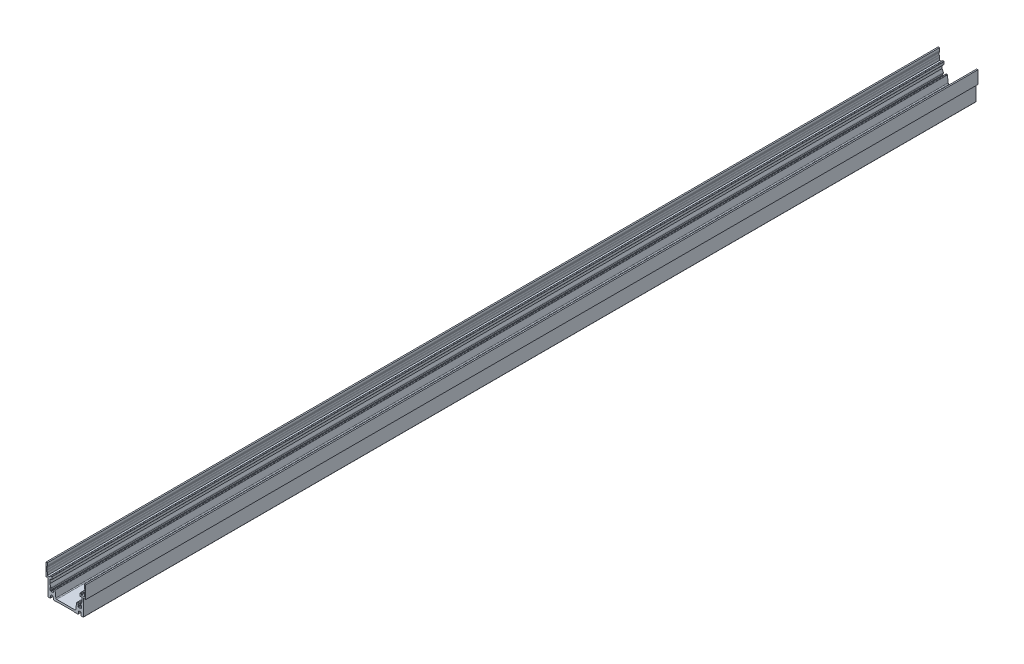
ISO-10303-21;
HEADER;
FILE_DESCRIPTION(('STEP AP214'),'2;1');
FILE_NAME('part.step','',(''),(''),'','','');
FILE_SCHEMA(('AUTOMOTIVE_DESIGN { 1 0 10303 214 1 1 1 1 }'));
ENDSEC;
DATA;
#1=APPLICATION_CONTEXT('core data for automotive mechanical design processes');
#2=APPLICATION_PROTOCOL_DEFINITION('international standard','automotive_design',2000,#1);
#3=PRODUCT_CONTEXT('',#1,'mechanical');
#4=PRODUCT('Part','Part','',(#3));
#5=PRODUCT_RELATED_PRODUCT_CATEGORY('part','',(#4));
#6=PRODUCT_DEFINITION_FORMATION('','',#4);
#7=PRODUCT_DEFINITION_CONTEXT('part definition',#1,'design');
#8=PRODUCT_DEFINITION('design','',#6,#7);
#9=PRODUCT_DEFINITION_SHAPE('','',#8);
#10=(LENGTH_UNIT() NAMED_UNIT(*) SI_UNIT(.MILLI.,.METRE.));
#11=(NAMED_UNIT(*) PLANE_ANGLE_UNIT() SI_UNIT($,.RADIAN.));
#12=(NAMED_UNIT(*) SI_UNIT($,.STERADIAN.) SOLID_ANGLE_UNIT());
#13=UNCERTAINTY_MEASURE_WITH_UNIT(LENGTH_MEASURE(1.E-05),#10,'distance_accuracy_value','');
#14=(GEOMETRIC_REPRESENTATION_CONTEXT(3) GLOBAL_UNCERTAINTY_ASSIGNED_CONTEXT((#13)) GLOBAL_UNIT_ASSIGNED_CONTEXT((#10,
#11,#12)) REPRESENTATION_CONTEXT('',''));
#15=CARTESIAN_POINT('',(0.,0.,0.));
#16=DIRECTION('',(0.,0.,1.));
#17=DIRECTION('',(1.,0.,0.));
#18=AXIS2_PLACEMENT_3D('',#15,#16,#17);
#19=CARTESIAN_POINT('',(-18.,26.302,270.));
#20=DIRECTION('',(1.,0.,0.));
#21=DIRECTION('',(0.,0.,-1.));
#22=AXIS2_PLACEMENT_3D('',#19,#20,#21);
#23=PLANE('',#22);
#24=DIRECTION('',(0.,-1.,0.));
#25=VECTOR('',#24,1.);
#26=CARTESIAN_POINT('',(-18.,26.302,0.));
#27=LINE('',#26,#25);
#28=CARTESIAN_POINT('',(-18.,26.302,0.));
#29=VERTEX_POINT('',#28);
#30=CARTESIAN_POINT('',(-18.,14.6986296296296,0.));
#31=VERTEX_POINT('',#30);
#32=EDGE_CURVE('E688',#29,#31,#27,.T.);
#33=ORIENTED_EDGE('',*,*,#32,.T.);
#34=DIRECTION('',(0.,0.,-1.));
#35=VECTOR('',#34,1.);
#36=CARTESIAN_POINT('',(-18.,14.6986296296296,270.));
#37=LINE('',#36,#35);
#38=CARTESIAN_POINT('',(-18.,14.6986296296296,810.));
#39=VERTEX_POINT('',#38);
#40=EDGE_CURVE('E9',#39,#31,#37,.T.);
#41=ORIENTED_EDGE('',*,*,#40,.F.);
#42=DIRECTION('',(0.,1.,0.));
#43=VECTOR('',#42,1.);
#44=CARTESIAN_POINT('',(-18.,14.6986296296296,810.));
#45=LINE('',#44,#43);
#46=CARTESIAN_POINT('',(-18.,26.302,810.));
#47=VERTEX_POINT('',#46);
#48=EDGE_CURVE('E686',#39,#47,#45,.T.);
#49=ORIENTED_EDGE('',*,*,#48,.T.);
#50=DIRECTION('',(0.,0.,-1.));
#51=VECTOR('',#50,1.);
#52=CARTESIAN_POINT('',(-18.,26.302,270.));
#53=LINE('',#52,#51);
#54=EDGE_CURVE('E1281',#47,#29,#53,.T.);
#55=ORIENTED_EDGE('',*,*,#54,.T.);
#56=EDGE_LOOP('',(#33,#41,#49,#55));
#57=FACE_BOUND('',#56,.T.);
#58=ADVANCED_FACE('F14',(#57),#23,.F.);
#59=CARTESIAN_POINT('',(-18.,14.6986296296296,270.));
#60=DIRECTION('',(-0.287144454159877,0.957887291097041,0.));
#61=DIRECTION('',(-0.957887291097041,-0.287144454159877,0.));
#62=AXIS2_PLACEMENT_3D('',#59,#60,#61);
#63=PLANE('',#62);
#64=DIRECTION('',(0.957887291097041,0.287144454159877,0.));
#65=VECTOR('',#64,1.);
#66=CARTESIAN_POINT('',(-18.,14.6986296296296,0.));
#67=LINE('',#66,#65);
#68=CARTESIAN_POINT('',(-17.008,14.996,0.));
#69=VERTEX_POINT('',#68);
#70=EDGE_CURVE('E1025',#31,#69,#67,.T.);
#71=ORIENTED_EDGE('',*,*,#70,.T.);
#72=DIRECTION('',(0.,0.,-1.));
#73=VECTOR('',#72,1.);
#74=CARTESIAN_POINT('',(-17.008,14.996,270.));
#75=LINE('',#74,#73);
#76=CARTESIAN_POINT('',(-17.008,14.996,810.));
#77=VERTEX_POINT('',#76);
#78=EDGE_CURVE('E21',#77,#69,#75,.T.);
#79=ORIENTED_EDGE('',*,*,#78,.F.);
#80=DIRECTION('',(-0.957887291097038,-0.287144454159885,0.));
#81=VECTOR('',#80,1.);
#82=CARTESIAN_POINT('',(-17.008,14.996,810.));
#83=LINE('',#82,#81);
#84=EDGE_CURVE('E696',#77,#39,#83,.T.);
#85=ORIENTED_EDGE('',*,*,#84,.T.);
#86=ORIENTED_EDGE('',*,*,#40,.T.);
#87=EDGE_LOOP('',(#71,#79,#85,#86));
#88=FACE_BOUND('',#87,.T.);
#89=ADVANCED_FACE('F702',(#88),#63,.F.);
#90=CARTESIAN_POINT('',(-17.008,14.996,270.));
#91=DIRECTION('',(0.,1.,0.));
#92=DIRECTION('',(0.,0.,1.));
#93=AXIS2_PLACEMENT_3D('',#90,#91,#92);
#94=PLANE('',#93);
#95=DIRECTION('',(1.,0.,0.));
#96=VECTOR('',#95,1.);
#97=CARTESIAN_POINT('',(-17.008,14.996,0.));
#98=LINE('',#97,#96);
#99=CARTESIAN_POINT('',(-16.,14.996,0.));
#100=VERTEX_POINT('',#99);
#101=EDGE_CURVE('E1027',#69,#100,#98,.T.);
#102=ORIENTED_EDGE('',*,*,#101,.T.);
#103=DIRECTION('',(0.,0.,-1.));
#104=VECTOR('',#103,1.);
#105=CARTESIAN_POINT('',(-16.,14.996,270.));
#106=LINE('',#105,#104);
#107=CARTESIAN_POINT('',(-16.,14.996,810.));
#108=VERTEX_POINT('',#107);
#109=EDGE_CURVE('E1554',#108,#100,#106,.T.);
#110=ORIENTED_EDGE('',*,*,#109,.F.);
#111=DIRECTION('',(-1.,0.,0.));
#112=VECTOR('',#111,1.);
#113=CARTESIAN_POINT('',(-16.,14.996,810.));
#114=LINE('',#113,#112);
#115=EDGE_CURVE('E1022',#108,#77,#114,.T.);
#116=ORIENTED_EDGE('',*,*,#115,.T.);
#117=ORIENTED_EDGE('',*,*,#78,.T.);
#118=EDGE_LOOP('',(#102,#110,#116,#117));
#119=FACE_BOUND('',#118,.T.);
#120=ADVANCED_FACE('F1558',(#119),#94,.F.);
#121=CARTESIAN_POINT('',(-16.,14.996,270.));
#122=DIRECTION('',(1.,0.,0.));
#123=DIRECTION('',(0.,0.,-1.));
#124=AXIS2_PLACEMENT_3D('',#121,#122,#123);
#125=PLANE('',#124);
#126=DIRECTION('',(0.,-1.,0.));
#127=VECTOR('',#126,1.);
#128=CARTESIAN_POINT('',(-16.,14.996,0.));
#129=LINE('',#128,#127);
#130=CARTESIAN_POINT('',(-16.,0.0999999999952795,0.));
#131=VERTEX_POINT('',#130);
#132=EDGE_CURVE('E1029',#100,#131,#129,.T.);
#133=ORIENTED_EDGE('',*,*,#132,.T.);
#134=DIRECTION('',(0.,0.,-1.));
#135=VECTOR('',#134,1.);
#136=CARTESIAN_POINT('',(-16.,0.0999999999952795,270.));
#137=LINE('',#136,#135);
#138=CARTESIAN_POINT('',(-16.,0.0999999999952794,810.));
#139=VERTEX_POINT('',#138);
#140=EDGE_CURVE('E1551',#139,#131,#137,.T.);
#141=ORIENTED_EDGE('',*,*,#140,.F.);
#142=DIRECTION('',(0.,1.,0.));
#143=VECTOR('',#142,1.);
#144=CARTESIAN_POINT('',(-16.,0.0999999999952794,810.));
#145=LINE('',#144,#143);
#146=EDGE_CURVE('E1019',#139,#108,#145,.T.);
#147=ORIENTED_EDGE('',*,*,#146,.T.);
#148=ORIENTED_EDGE('',*,*,#109,.T.);
#149=EDGE_LOOP('',(#133,#141,#147,#148));
#150=FACE_BOUND('',#149,.T.);
#151=ADVANCED_FACE('F1565',(#150),#125,.F.);
#152=CARTESIAN_POINT('',(-15.702,0.0999999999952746,270.));
#153=DIRECTION('',(0.,0.,-1.));
#154=DIRECTION('',(-1.,0.,0.));
#155=AXIS2_PLACEMENT_3D('',#152,#153,#154);
#156=CYLINDRICAL_SURFACE('',#155,0.298);
#157=CARTESIAN_POINT('',(-15.702,0.0999999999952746,0.));
#158=DIRECTION('',(0.,0.,1.));
#159=DIRECTION('',(1.,0.,0.));
#160=AXIS2_PLACEMENT_3D('',#157,#158,#159);
#161=CIRCLE('',#160,0.298);
#162=CARTESIAN_POINT('',(-15.7020016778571,-0.198,0.));
#163=VERTEX_POINT('',#162);
#164=EDGE_CURVE('E1031',#131,#163,#161,.T.);
#165=ORIENTED_EDGE('',*,*,#164,.T.);
#166=DIRECTION('',(0.,0.,-1.));
#167=VECTOR('',#166,1.);
#168=CARTESIAN_POINT('',(-15.7020016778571,-0.198,270.));
#169=LINE('',#168,#167);
#170=CARTESIAN_POINT('',(-15.7020016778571,-0.198,810.));
#171=VERTEX_POINT('',#170);
#172=EDGE_CURVE('E1548',#171,#163,#169,.T.);
#173=ORIENTED_EDGE('',*,*,#172,.F.);
#174=CARTESIAN_POINT('',(-15.702,0.0999999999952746,810.));
#175=DIRECTION('',(0.,0.,-1.));
#176=DIRECTION('',(-1.,0.,0.));
#177=AXIS2_PLACEMENT_3D('',#174,#175,#176);
#178=CIRCLE('',#177,0.298);
#179=EDGE_CURVE('E1016',#171,#139,#178,.T.);
#180=ORIENTED_EDGE('',*,*,#179,.T.);
#181=ORIENTED_EDGE('',*,*,#140,.T.);
#182=EDGE_LOOP('',(#165,#173,#180,#181));
#183=FACE_BOUND('',#182,.T.);
#184=ADVANCED_FACE('F1568',(#183),#156,.T.);
#185=CARTESIAN_POINT('',(-15.7020016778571,-0.198,270.));
#186=DIRECTION('',(0.,1.,0.));
#187=DIRECTION('',(0.,0.,1.));
#188=AXIS2_PLACEMENT_3D('',#185,#186,#187);
#189=PLANE('',#188);
#190=DIRECTION('',(1.,0.,0.));
#191=VECTOR('',#190,1.);
#192=CARTESIAN_POINT('',(-15.7020016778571,-0.198,0.));
#193=LINE('',#192,#191);
#194=CARTESIAN_POINT('',(-14.2773032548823,-0.198,0.));
#195=VERTEX_POINT('',#194);
#196=EDGE_CURVE('E1033',#163,#195,#193,.T.);
#197=ORIENTED_EDGE('',*,*,#196,.T.);
#198=DIRECTION('',(0.,0.,-1.));
#199=VECTOR('',#198,1.);
#200=CARTESIAN_POINT('',(-14.2773032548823,-0.198,270.));
#201=LINE('',#200,#199);
#202=CARTESIAN_POINT('',(-14.2773032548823,-0.197999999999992,810.));
#203=VERTEX_POINT('',#202);
#204=EDGE_CURVE('E1545',#203,#195,#201,.T.);
#205=ORIENTED_EDGE('',*,*,#204,.F.);
#206=DIRECTION('',(-1.,0.,0.));
#207=VECTOR('',#206,1.);
#208=CARTESIAN_POINT('',(-14.2773032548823,-0.197999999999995,810.));
#209=LINE('',#208,#207);
#210=EDGE_CURVE('E1013',#203,#171,#209,.T.);
#211=ORIENTED_EDGE('',*,*,#210,.T.);
#212=ORIENTED_EDGE('',*,*,#172,.T.);
#213=EDGE_LOOP('',(#197,#205,#211,#212));
#214=FACE_BOUND('',#213,.T.);
#215=ADVANCED_FACE('F1573',(#214),#189,.F.);
#216=CARTESIAN_POINT('',(-14.2773038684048,0.0999999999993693,270.));
#217=DIRECTION('',(0.,0.,-1.));
#218=DIRECTION('',(-1.,0.,0.));
#219=AXIS2_PLACEMENT_3D('',#216,#217,#218);
#220=CYLINDRICAL_SURFACE('',#219,0.298);
#221=CARTESIAN_POINT('',(-14.2773038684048,0.0999999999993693,0.));
#222=DIRECTION('',(0.,0.,1.));
#223=DIRECTION('',(1.,0.,0.));
#224=AXIS2_PLACEMENT_3D('',#221,#222,#223);
#225=CIRCLE('',#224,0.298);
#226=CARTESIAN_POINT('',(-13.9819190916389,0.0606066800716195,0.));
#227=VERTEX_POINT('',#226);
#228=EDGE_CURVE('E1035',#195,#227,#225,.T.);
#229=ORIENTED_EDGE('',*,*,#228,.T.);
#230=DIRECTION('',(0.,0.,-1.));
#231=VECTOR('',#230,1.);
#232=CARTESIAN_POINT('',(-13.9819190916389,0.0606066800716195,270.));
#233=LINE('',#232,#231);
#234=CARTESIAN_POINT('',(-13.9819190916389,0.0606066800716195,810.));
#235=VERTEX_POINT('',#234);
#236=EDGE_CURVE('E1542',#235,#227,#233,.T.);
#237=ORIENTED_EDGE('',*,*,#236,.F.);
#238=CARTESIAN_POINT('',(-14.2773038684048,0.0999999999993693,810.));
#239=DIRECTION('',(0.,0.,-1.));
#240=DIRECTION('',(-1.,0.,0.));
#241=AXIS2_PLACEMENT_3D('',#238,#239,#240);
#242=CIRCLE('',#241,0.297999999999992);
#243=EDGE_CURVE('E1010',#235,#203,#242,.T.);
#244=ORIENTED_EDGE('',*,*,#243,.T.);
#245=ORIENTED_EDGE('',*,*,#204,.T.);
#246=EDGE_LOOP('',(#229,#237,#244,#245));
#247=FACE_BOUND('',#246,.T.);
#248=ADVANCED_FACE('F1576',(#247),#220,.T.);
#249=CARTESIAN_POINT('',(-13.9819190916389,0.0606066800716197,270.));
#250=DIRECTION('',(-0.991224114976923,0.132192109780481,0.));
#251=DIRECTION('',(-0.132192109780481,-0.991224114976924,0.));
#252=AXIS2_PLACEMENT_3D('',#249,#250,#251);
#253=PLANE('',#252);
#254=DIRECTION('',(0.132192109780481,0.991224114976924,0.));
#255=VECTOR('',#254,1.);
#256=CARTESIAN_POINT('',(-13.9819190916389,0.0606066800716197,0.));
#257=LINE('',#256,#255);
#258=CARTESIAN_POINT('',(-13.6770576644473,2.34656761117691,0.));
#259=VERTEX_POINT('',#258);
#260=EDGE_CURVE('E1037',#227,#259,#257,.T.);
#261=ORIENTED_EDGE('',*,*,#260,.T.);
#262=DIRECTION('',(0.,0.,-1.));
#263=VECTOR('',#262,1.);
#264=CARTESIAN_POINT('',(-13.6770576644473,2.34656761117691,270.));
#265=LINE('',#264,#263);
#266=CARTESIAN_POINT('',(-13.6770576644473,2.34656761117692,810.));
#267=VERTEX_POINT('',#266);
#268=EDGE_CURVE('E1540',#267,#259,#265,.T.);
#269=ORIENTED_EDGE('',*,*,#268,.F.);
#270=DIRECTION('',(-0.132192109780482,-0.991224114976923,0.));
#271=VECTOR('',#270,1.);
#272=CARTESIAN_POINT('',(-13.6770576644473,2.34656761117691,810.));
#273=LINE('',#272,#271);
#274=EDGE_CURVE('E1007',#267,#235,#273,.T.);
#275=ORIENTED_EDGE('',*,*,#274,.T.);
#276=ORIENTED_EDGE('',*,*,#236,.T.);
#277=EDGE_LOOP('',(#261,#269,#275,#276));
#278=FACE_BOUND('',#277,.T.);
#279=ADVANCED_FACE('F1581',(#278),#253,.F.);
#280=CARTESIAN_POINT('',(-13.1854105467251,2.281,270.));
#281=DIRECTION('',(0.,0.,-1.));
#282=DIRECTION('',(-1.,0.,0.));
#283=AXIS2_PLACEMENT_3D('',#280,#281,#282);
#284=CYLINDRICAL_SURFACE('',#283,0.496);
#285=CARTESIAN_POINT('',(-13.1854105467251,2.281,0.));
#286=DIRECTION('',(0.,0.,1.));
#287=DIRECTION('',(1.,0.,0.));
#288=AXIS2_PLACEMENT_3D('',#285,#286,#287);
#289=CIRCLE('',#288,0.496);
#290=CARTESIAN_POINT('',(-13.1854106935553,2.777,0.));
#291=VERTEX_POINT('',#290);
#292=EDGE_CURVE('E1040',#291,#259,#289,.T.);
#293=ORIENTED_EDGE('',*,*,#292,.F.);
#294=DIRECTION('',(0.,0.,-1.));
#295=VECTOR('',#294,1.);
#296=CARTESIAN_POINT('',(-13.1854106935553,2.777,270.));
#297=LINE('',#296,#295);
#298=CARTESIAN_POINT('',(-13.1854106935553,2.777,810.));
#299=VERTEX_POINT('',#298);
#300=EDGE_CURVE('E1538',#299,#291,#297,.T.);
#301=ORIENTED_EDGE('',*,*,#300,.F.);
#302=CARTESIAN_POINT('',(-13.1854105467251,2.281,810.));
#303=DIRECTION('',(0.,0.,1.));
#304=DIRECTION('',(-1.,0.,0.));
#305=AXIS2_PLACEMENT_3D('',#302,#303,#304);
#306=CIRCLE('',#305,0.496000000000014);
#307=EDGE_CURVE('E1004',#299,#267,#306,.T.);
#308=ORIENTED_EDGE('',*,*,#307,.T.);
#309=ORIENTED_EDGE('',*,*,#268,.T.);
#310=EDGE_LOOP('',(#293,#301,#308,#309));
#311=FACE_BOUND('',#310,.T.);
#312=ADVANCED_FACE('F1586',(#311),#284,.F.);
#313=CARTESIAN_POINT('',(-13.1854106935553,2.777,270.));
#314=DIRECTION('',(0.,1.,0.));
#315=DIRECTION('',(0.,0.,1.));
#316=AXIS2_PLACEMENT_3D('',#313,#314,#315);
#317=PLANE('',#316);
#318=DIRECTION('',(1.,0.,0.));
#319=VECTOR('',#318,1.);
#320=CARTESIAN_POINT('',(-13.1854106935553,2.777,0.));
#321=LINE('',#320,#319);
#322=CARTESIAN_POINT('',(-12.0205892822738,2.777,0.));
#323=VERTEX_POINT('',#322);
#324=EDGE_CURVE('E1043',#291,#323,#321,.T.);
#325=ORIENTED_EDGE('',*,*,#324,.T.);
#326=DIRECTION('',(0.,0.,-1.));
#327=VECTOR('',#326,1.);
#328=CARTESIAN_POINT('',(-12.0205892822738,2.777,270.));
#329=LINE('',#328,#327);
#330=CARTESIAN_POINT('',(-12.0205892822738,2.777,810.));
#331=VERTEX_POINT('',#330);
#332=EDGE_CURVE('E1536',#331,#323,#329,.T.);
#333=ORIENTED_EDGE('',*,*,#332,.F.);
#334=DIRECTION('',(-1.,0.,0.));
#335=VECTOR('',#334,1.);
#336=CARTESIAN_POINT('',(-12.0205892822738,2.777,810.));
#337=LINE('',#336,#335);
#338=EDGE_CURVE('E1001',#331,#299,#337,.T.);
#339=ORIENTED_EDGE('',*,*,#338,.T.);
#340=ORIENTED_EDGE('',*,*,#300,.T.);
#341=EDGE_LOOP('',(#325,#333,#339,#340));
#342=FACE_BOUND('',#341,.T.);
#343=ADVANCED_FACE('F1588',(#342),#317,.F.);
#344=CARTESIAN_POINT('',(-12.0205895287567,2.28100000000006,270.));
#345=DIRECTION('',(0.,0.,-1.));
#346=DIRECTION('',(-1.,0.,0.));
#347=AXIS2_PLACEMENT_3D('',#344,#345,#346);
#348=CYLINDRICAL_SURFACE('',#347,0.496);
#349=CARTESIAN_POINT('',(-12.0205895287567,2.28100000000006,0.));
#350=DIRECTION('',(0.,0.,1.));
#351=DIRECTION('',(1.,0.,0.));
#352=AXIS2_PLACEMENT_3D('',#349,#350,#351);
#353=CIRCLE('',#352,0.496);
#354=CARTESIAN_POINT('',(-11.5289320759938,2.34649006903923,0.));
#355=VERTEX_POINT('',#354);
#356=EDGE_CURVE('E1046',#355,#323,#353,.T.);
#357=ORIENTED_EDGE('',*,*,#356,.F.);
#358=DIRECTION('',(0.,0.,-1.));
#359=VECTOR('',#358,1.);
#360=CARTESIAN_POINT('',(-11.5289320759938,2.34649006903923,270.));
#361=LINE('',#360,#359);
#362=CARTESIAN_POINT('',(-11.5289320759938,2.34649006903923,810.));
#363=VERTEX_POINT('',#362);
#364=EDGE_CURVE('E1534',#363,#355,#361,.T.);
#365=ORIENTED_EDGE('',*,*,#364,.F.);
#366=CARTESIAN_POINT('',(-12.0205895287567,2.28100000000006,810.));
#367=DIRECTION('',(0.,0.,1.));
#368=DIRECTION('',(-1.,0.,0.));
#369=AXIS2_PLACEMENT_3D('',#366,#367,#368);
#370=CIRCLE('',#369,0.496);
#371=EDGE_CURVE('E998',#363,#331,#370,.T.);
#372=ORIENTED_EDGE('',*,*,#371,.T.);
#373=ORIENTED_EDGE('',*,*,#332,.T.);
#374=EDGE_LOOP('',(#357,#365,#372,#373));
#375=FACE_BOUND('',#374,.T.);
#376=ADVANCED_FACE('F1593',(#375),#348,.F.);
#377=CARTESIAN_POINT('',(-11.5289320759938,2.34649006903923,270.));
#378=DIRECTION('',(0.991244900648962,0.132036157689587,0.));
#379=DIRECTION('',(-0.132036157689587,0.991244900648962,0.));
#380=AXIS2_PLACEMENT_3D('',#377,#378,#379);
#381=PLANE('',#380);
#382=DIRECTION('',(0.132036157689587,-0.991244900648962,0.));
#383=VECTOR('',#382,1.);
#384=CARTESIAN_POINT('',(-11.5289320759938,2.34649006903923,0.));
#385=LINE('',#384,#383);
#386=CARTESIAN_POINT('',(-11.19,-0.198,0.));
#387=VERTEX_POINT('',#386);
#388=EDGE_CURVE('E1049',#355,#387,#385,.T.);
#389=ORIENTED_EDGE('',*,*,#388,.T.);
#390=DIRECTION('',(0.,0.,-1.));
#391=VECTOR('',#390,1.);
#392=CARTESIAN_POINT('',(-11.19,-0.198,270.));
#393=LINE('',#392,#391);
#394=CARTESIAN_POINT('',(-11.19,-0.198,810.));
#395=VERTEX_POINT('',#394);
#396=EDGE_CURVE('E1531',#395,#387,#393,.T.);
#397=ORIENTED_EDGE('',*,*,#396,.F.);
#398=DIRECTION('',(-0.13203615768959,0.991244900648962,0.));
#399=VECTOR('',#398,1.);
#400=CARTESIAN_POINT('',(-11.19,-0.198,810.));
#401=LINE('',#400,#399);
#402=EDGE_CURVE('E995',#395,#363,#401,.T.);
#403=ORIENTED_EDGE('',*,*,#402,.T.);
#404=ORIENTED_EDGE('',*,*,#364,.T.);
#405=EDGE_LOOP('',(#389,#397,#403,#404));
#406=FACE_BOUND('',#405,.T.);
#407=ADVANCED_FACE('F1598',(#406),#381,.F.);
#408=CARTESIAN_POINT('',(-11.19,-0.198,270.));
#409=DIRECTION('',(0.,1.,0.));
#410=DIRECTION('',(-1.,0.,0.));
#411=AXIS2_PLACEMENT_3D('',#408,#409,#410);
#412=PLANE('',#411);
#413=DIRECTION('',(1.,0.,0.));
#414=VECTOR('',#413,1.);
#415=CARTESIAN_POINT('',(-11.19,-0.198,0.));
#416=LINE('',#415,#414);
#417=CARTESIAN_POINT('',(-7.663,-0.198,0.));
#418=VERTEX_POINT('',#417);
#419=EDGE_CURVE('E1051',#387,#418,#416,.T.);
#420=ORIENTED_EDGE('',*,*,#419,.T.);
#421=DIRECTION('',(0.,0.,-1.));
#422=VECTOR('',#421,1.);
#423=CARTESIAN_POINT('',(-7.663,-0.198,270.));
#424=LINE('',#423,#422);
#425=CARTESIAN_POINT('',(-7.663,-0.198,810.));
#426=VERTEX_POINT('',#425);
#427=EDGE_CURVE('E1529',#426,#418,#424,.T.);
#428=ORIENTED_EDGE('',*,*,#427,.F.);
#429=DIRECTION('',(-1.,0.,0.));
#430=VECTOR('',#429,1.);
#431=CARTESIAN_POINT('',(-7.663,-0.198,810.));
#432=LINE('',#431,#430);
#433=EDGE_CURVE('E992',#426,#395,#432,.T.);
#434=ORIENTED_EDGE('',*,*,#433,.T.);
#435=ORIENTED_EDGE('',*,*,#396,.T.);
#436=EDGE_LOOP('',(#420,#428,#434,#435));
#437=FACE_BOUND('',#436,.T.);
#438=ADVANCED_FACE('F1600',(#437),#412,.F.);
#439=CARTESIAN_POINT('',(-7.14898437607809,-0.752368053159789,270.));
#440=DIRECTION('',(0.,0.,-1.));
#441=DIRECTION('',(-1.,0.,0.));
#442=AXIS2_PLACEMENT_3D('',#439,#440,#441);
#443=CYLINDRICAL_SURFACE('',#442,0.756);
#444=CARTESIAN_POINT('',(-7.14898437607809,-0.752368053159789,0.));
#445=DIRECTION('',(0.,0.,1.));
#446=DIRECTION('',(1.,0.,0.));
#447=AXIS2_PLACEMENT_3D('',#444,#445,#446);
#448=CIRCLE('',#447,0.756);
#449=CARTESIAN_POINT('',(-7.223,0.,0.));
#450=VERTEX_POINT('',#449);
#451=EDGE_CURVE('E1054',#450,#418,#448,.T.);
#452=ORIENTED_EDGE('',*,*,#451,.F.);
#453=DIRECTION('',(0.,0.,-1.));
#454=VECTOR('',#453,1.);
#455=CARTESIAN_POINT('',(-7.223,0.,270.));
#456=LINE('',#455,#454);
#457=CARTESIAN_POINT('',(-7.223,0.,810.));
#458=VERTEX_POINT('',#457);
#459=EDGE_CURVE('E1527',#458,#450,#456,.T.);
#460=ORIENTED_EDGE('',*,*,#459,.F.);
#461=CARTESIAN_POINT('',(-7.14898437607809,-0.752368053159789,810.));
#462=DIRECTION('',(0.,0.,1.));
#463=DIRECTION('',(-1.,0.,0.));
#464=AXIS2_PLACEMENT_3D('',#461,#462,#463);
#465=CIRCLE('',#464,0.756);
#466=EDGE_CURVE('E989',#458,#426,#465,.T.);
#467=ORIENTED_EDGE('',*,*,#466,.T.);
#468=ORIENTED_EDGE('',*,*,#427,.T.);
#469=EDGE_LOOP('',(#452,#460,#467,#468));
#470=FACE_BOUND('',#469,.T.);
#471=ADVANCED_FACE('F1604',(#470),#443,.F.);
#472=CARTESIAN_POINT('',(-7.223,0.,270.));
#473=DIRECTION('',(0.,1.,0.));
#474=DIRECTION('',(0.,0.,1.));
#475=AXIS2_PLACEMENT_3D('',#472,#473,#474);
#476=PLANE('',#475);
#477=DIRECTION('',(1.,0.,0.));
#478=VECTOR('',#477,1.);
#479=CARTESIAN_POINT('',(-7.223,0.,0.));
#480=LINE('',#479,#478);
#481=CARTESIAN_POINT('',(7.223,0.,0.));
#482=VERTEX_POINT('',#481);
#483=EDGE_CURVE('E1057',#450,#482,#480,.T.);
#484=ORIENTED_EDGE('',*,*,#483,.T.);
#485=DIRECTION('',(0.,0.,-1.));
#486=VECTOR('',#485,1.);
#487=CARTESIAN_POINT('',(7.223,0.,270.));
#488=LINE('',#487,#486);
#489=CARTESIAN_POINT('',(7.223,0.,810.));
#490=VERTEX_POINT('',#489);
#491=EDGE_CURVE('E1525',#490,#482,#488,.T.);
#492=ORIENTED_EDGE('',*,*,#491,.F.);
#493=DIRECTION('',(-1.,0.,0.));
#494=VECTOR('',#493,1.);
#495=CARTESIAN_POINT('',(7.223,0.,810.));
#496=LINE('',#495,#494);
#497=EDGE_CURVE('E986',#490,#458,#496,.T.);
#498=ORIENTED_EDGE('',*,*,#497,.T.);
#499=ORIENTED_EDGE('',*,*,#459,.T.);
#500=EDGE_LOOP('',(#484,#492,#498,#499));
#501=FACE_BOUND('',#500,.T.);
#502=ADVANCED_FACE('F1609',(#501),#476,.F.);
#503=CARTESIAN_POINT('',(7.14898437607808,-0.752368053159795,270.));
#504=DIRECTION('',(0.,0.,-1.));
#505=DIRECTION('',(-1.,0.,0.));
#506=AXIS2_PLACEMENT_3D('',#503,#504,#505);
#507=CYLINDRICAL_SURFACE('',#506,0.756);
#508=CARTESIAN_POINT('',(7.14898437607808,-0.752368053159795,0.));
#509=DIRECTION('',(0.,0.,1.));
#510=DIRECTION('',(1.,0.,0.));
#511=AXIS2_PLACEMENT_3D('',#508,#509,#510);
#512=CIRCLE('',#511,0.756);
#513=CARTESIAN_POINT('',(7.663,-0.198,0.));
#514=VERTEX_POINT('',#513);
#515=EDGE_CURVE('E1060',#514,#482,#512,.T.);
#516=ORIENTED_EDGE('',*,*,#515,.F.);
#517=DIRECTION('',(0.,0.,-1.));
#518=VECTOR('',#517,1.);
#519=CARTESIAN_POINT('',(7.663,-0.198,270.));
#520=LINE('',#519,#518);
#521=CARTESIAN_POINT('',(7.663,-0.198,810.));
#522=VERTEX_POINT('',#521);
#523=EDGE_CURVE('E1523',#522,#514,#520,.T.);
#524=ORIENTED_EDGE('',*,*,#523,.F.);
#525=CARTESIAN_POINT('',(7.14898437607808,-0.752368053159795,810.));
#526=DIRECTION('',(0.,0.,1.));
#527=DIRECTION('',(-1.,0.,0.));
#528=AXIS2_PLACEMENT_3D('',#525,#526,#527);
#529=CIRCLE('',#528,0.756000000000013);
#530=EDGE_CURVE('E983',#522,#490,#529,.T.);
#531=ORIENTED_EDGE('',*,*,#530,.T.);
#532=ORIENTED_EDGE('',*,*,#491,.T.);
#533=EDGE_LOOP('',(#516,#524,#531,#532));
#534=FACE_BOUND('',#533,.T.);
#535=ADVANCED_FACE('F1612',(#534),#507,.F.);
#536=CARTESIAN_POINT('',(7.663,-0.198,270.));
#537=DIRECTION('',(0.,1.,0.));
#538=DIRECTION('',(-1.,0.,0.));
#539=AXIS2_PLACEMENT_3D('',#536,#537,#538);
#540=PLANE('',#539);
#541=DIRECTION('',(1.,0.,0.));
#542=VECTOR('',#541,1.);
#543=CARTESIAN_POINT('',(7.663,-0.198,0.));
#544=LINE('',#543,#542);
#545=CARTESIAN_POINT('',(10.93,-0.198,0.));
#546=VERTEX_POINT('',#545);
#547=EDGE_CURVE('E1063',#514,#546,#544,.T.);
#548=ORIENTED_EDGE('',*,*,#547,.T.);
#549=DIRECTION('',(0.,0.,-1.));
#550=VECTOR('',#549,1.);
#551=CARTESIAN_POINT('',(10.93,-0.198,270.));
#552=LINE('',#551,#550);
#553=CARTESIAN_POINT('',(10.93,-0.197999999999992,810.));
#554=VERTEX_POINT('',#553);
#555=EDGE_CURVE('E1520',#554,#546,#552,.T.);
#556=ORIENTED_EDGE('',*,*,#555,.F.);
#557=DIRECTION('',(-1.,0.,0.));
#558=VECTOR('',#557,1.);
#559=CARTESIAN_POINT('',(10.93,-0.197999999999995,810.));
#560=LINE('',#559,#558);
#561=EDGE_CURVE('E980',#554,#522,#560,.T.);
#562=ORIENTED_EDGE('',*,*,#561,.T.);
#563=ORIENTED_EDGE('',*,*,#523,.T.);
#564=EDGE_LOOP('',(#548,#556,#562,#563));
#565=FACE_BOUND('',#564,.T.);
#566=ADVANCED_FACE('F1616',(#565),#540,.F.);
#567=CARTESIAN_POINT('',(10.9286957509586,0.0999971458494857,270.));
#568=DIRECTION('',(0.,0.,-1.));
#569=DIRECTION('',(-1.,0.,0.));
#570=AXIS2_PLACEMENT_3D('',#567,#568,#569);
#571=CYLINDRICAL_SURFACE('',#570,0.298);
#572=CARTESIAN_POINT('',(10.9286957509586,0.0999971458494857,0.));
#573=DIRECTION('',(0.,0.,1.));
#574=DIRECTION('',(1.,0.,0.));
#575=AXIS2_PLACEMENT_3D('',#572,#573,#574);
#576=CIRCLE('',#575,0.298);
#577=CARTESIAN_POINT('',(11.2240805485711,0.0606039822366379,0.));
#578=VERTEX_POINT('',#577);
#579=EDGE_CURVE('E1065',#546,#578,#576,.T.);
#580=ORIENTED_EDGE('',*,*,#579,.T.);
#581=DIRECTION('',(0.,0.,-1.));
#582=VECTOR('',#581,1.);
#583=CARTESIAN_POINT('',(11.2240805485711,0.0606039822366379,270.));
#584=LINE('',#583,#582);
#585=CARTESIAN_POINT('',(11.2240805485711,0.0606039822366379,810.));
#586=VERTEX_POINT('',#585);
#587=EDGE_CURVE('E1517',#586,#578,#584,.T.);
#588=ORIENTED_EDGE('',*,*,#587,.F.);
#589=CARTESIAN_POINT('',(10.9286957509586,0.0999971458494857,810.));
#590=DIRECTION('',(0.,0.,-1.));
#591=DIRECTION('',(-1.,0.,0.));
#592=AXIS2_PLACEMENT_3D('',#589,#590,#591);
#593=CIRCLE('',#592,0.297999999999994);
#594=EDGE_CURVE('E977',#586,#554,#593,.T.);
#595=ORIENTED_EDGE('',*,*,#594,.T.);
#596=ORIENTED_EDGE('',*,*,#555,.T.);
#597=EDGE_LOOP('',(#580,#588,#595,#596));
#598=FACE_BOUND('',#597,.T.);
#599=ADVANCED_FACE('F1620',(#598),#571,.T.);
#600=CARTESIAN_POINT('',(11.2240805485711,0.0606039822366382,270.));
#601=DIRECTION('',(-0.991224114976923,0.132192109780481,0.));
#602=DIRECTION('',(-0.132192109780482,-0.991224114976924,0.));
#603=AXIS2_PLACEMENT_3D('',#600,#601,#602);
#604=PLANE('',#603);
#605=DIRECTION('',(0.132192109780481,0.991224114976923,0.));
#606=VECTOR('',#605,1.);
#607=CARTESIAN_POINT('',(11.2240805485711,0.0606039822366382,0.));
#608=LINE('',#607,#606);
#609=CARTESIAN_POINT('',(11.5289423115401,2.3465674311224,0.));
#610=VERTEX_POINT('',#609);
#611=EDGE_CURVE('E1067',#578,#610,#608,.T.);
#612=ORIENTED_EDGE('',*,*,#611,.T.);
#613=DIRECTION('',(0.,0.,-1.));
#614=VECTOR('',#613,1.);
#615=CARTESIAN_POINT('',(11.5289423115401,2.3465674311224,270.));
#616=LINE('',#615,#614);
#617=CARTESIAN_POINT('',(11.5289423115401,2.3465674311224,810.));
#618=VERTEX_POINT('',#617);
#619=EDGE_CURVE('E1515',#618,#610,#616,.T.);
#620=ORIENTED_EDGE('',*,*,#619,.F.);
#621=DIRECTION('',(-0.132192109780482,-0.991224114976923,0.));
#622=VECTOR('',#621,1.);
#623=CARTESIAN_POINT('',(11.5289423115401,2.3465674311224,810.));
#624=LINE('',#623,#622);
#625=EDGE_CURVE('E974',#618,#586,#624,.T.);
#626=ORIENTED_EDGE('',*,*,#625,.T.);
#627=ORIENTED_EDGE('',*,*,#587,.T.);
#628=EDGE_LOOP('',(#612,#620,#626,#627));
#629=FACE_BOUND('',#628,.T.);
#630=ADVANCED_FACE('F1625',(#629),#604,.F.);
#631=CARTESIAN_POINT('',(12.020589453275,2.28100000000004,270.));
#632=DIRECTION('',(0.,0.,-1.));
#633=DIRECTION('',(-1.,0.,0.));
#634=AXIS2_PLACEMENT_3D('',#631,#632,#633);
#635=CYLINDRICAL_SURFACE('',#634,0.496);
#636=CARTESIAN_POINT('',(12.020589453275,2.28100000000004,0.));
#637=DIRECTION('',(0.,0.,1.));
#638=DIRECTION('',(1.,0.,0.));
#639=AXIS2_PLACEMENT_3D('',#636,#637,#638);
#640=CIRCLE('',#639,0.496);
#641=CARTESIAN_POINT('',(12.0205892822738,2.777,0.));
#642=VERTEX_POINT('',#641);
#643=EDGE_CURVE('E1070',#642,#610,#640,.T.);
#644=ORIENTED_EDGE('',*,*,#643,.F.);
#645=DIRECTION('',(0.,0.,-1.));
#646=VECTOR('',#645,1.);
#647=CARTESIAN_POINT('',(12.0205892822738,2.777,270.));
#648=LINE('',#647,#646);
#649=CARTESIAN_POINT('',(12.0205892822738,2.777,810.));
#650=VERTEX_POINT('',#649);
#651=EDGE_CURVE('E1513',#650,#642,#648,.T.);
#652=ORIENTED_EDGE('',*,*,#651,.F.);
#653=CARTESIAN_POINT('',(12.020589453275,2.28100000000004,810.));
#654=DIRECTION('',(0.,0.,1.));
#655=DIRECTION('',(-1.,0.,0.));
#656=AXIS2_PLACEMENT_3D('',#653,#654,#655);
#657=CIRCLE('',#656,0.496);
#658=EDGE_CURVE('E971',#650,#618,#657,.T.);
#659=ORIENTED_EDGE('',*,*,#658,.T.);
#660=ORIENTED_EDGE('',*,*,#619,.T.);
#661=EDGE_LOOP('',(#644,#652,#659,#660));
#662=FACE_BOUND('',#661,.T.);
#663=ADVANCED_FACE('F1630',(#662),#635,.F.);
#664=CARTESIAN_POINT('',(12.0205892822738,2.777,270.));
#665=DIRECTION('',(0.,1.,0.));
#666=DIRECTION('',(0.,0.,1.));
#667=AXIS2_PLACEMENT_3D('',#664,#665,#666);
#668=PLANE('',#667);
#669=DIRECTION('',(1.,0.,0.));
#670=VECTOR('',#669,1.);
#671=CARTESIAN_POINT('',(12.0205892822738,2.777,0.));
#672=LINE('',#671,#670);
#673=CARTESIAN_POINT('',(13.1854106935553,2.777,0.));
#674=VERTEX_POINT('',#673);
#675=EDGE_CURVE('E1073',#642,#674,#672,.T.);
#676=ORIENTED_EDGE('',*,*,#675,.T.);
#677=DIRECTION('',(0.,0.,-1.));
#678=VECTOR('',#677,1.);
#679=CARTESIAN_POINT('',(13.1854106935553,2.777,270.));
#680=LINE('',#679,#678);
#681=CARTESIAN_POINT('',(13.1854106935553,2.777,810.));
#682=VERTEX_POINT('',#681);
#683=EDGE_CURVE('E1511',#682,#674,#680,.T.);
#684=ORIENTED_EDGE('',*,*,#683,.F.);
#685=DIRECTION('',(-1.,0.,0.));
#686=VECTOR('',#685,1.);
#687=CARTESIAN_POINT('',(13.1854106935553,2.777,810.));
#688=LINE('',#687,#686);
#689=EDGE_CURVE('E968',#682,#650,#688,.T.);
#690=ORIENTED_EDGE('',*,*,#689,.T.);
#691=ORIENTED_EDGE('',*,*,#651,.T.);
#692=EDGE_LOOP('',(#676,#684,#690,#691));
#693=FACE_BOUND('',#692,.T.);
#694=ADVANCED_FACE('F1632',(#693),#668,.F.);
#695=CARTESIAN_POINT('',(13.1854105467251,2.281,270.));
#696=DIRECTION('',(0.,0.,-1.));
#697=DIRECTION('',(-1.,0.,0.));
#698=AXIS2_PLACEMENT_3D('',#695,#696,#697);
#699=CYLINDRICAL_SURFACE('',#698,0.496);
#700=CARTESIAN_POINT('',(13.1854105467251,2.281,0.));
#701=DIRECTION('',(0.,0.,1.));
#702=DIRECTION('',(1.,0.,0.));
#703=AXIS2_PLACEMENT_3D('',#700,#701,#702);
#704=CIRCLE('',#703,0.496);
#705=CARTESIAN_POINT('',(13.6770576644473,2.34656761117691,0.));
#706=VERTEX_POINT('',#705);
#707=EDGE_CURVE('E1076',#706,#674,#704,.T.);
#708=ORIENTED_EDGE('',*,*,#707,.F.);
#709=DIRECTION('',(0.,0.,-1.));
#710=VECTOR('',#709,1.);
#711=CARTESIAN_POINT('',(13.6770576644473,2.34656761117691,270.));
#712=LINE('',#711,#710);
#713=CARTESIAN_POINT('',(13.6770576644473,2.34656761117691,810.));
#714=VERTEX_POINT('',#713);
#715=EDGE_CURVE('E1509',#714,#706,#712,.T.);
#716=ORIENTED_EDGE('',*,*,#715,.F.);
#717=CARTESIAN_POINT('',(13.1854105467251,2.281,810.));
#718=DIRECTION('',(0.,0.,1.));
#719=DIRECTION('',(-1.,0.,0.));
#720=AXIS2_PLACEMENT_3D('',#717,#718,#719);
#721=CIRCLE('',#720,0.496);
#722=EDGE_CURVE('E965',#714,#682,#721,.T.);
#723=ORIENTED_EDGE('',*,*,#722,.T.);
#724=ORIENTED_EDGE('',*,*,#683,.T.);
#725=EDGE_LOOP('',(#708,#716,#723,#724));
#726=FACE_BOUND('',#725,.T.);
#727=ADVANCED_FACE('F1637',(#726),#699,.F.);
#728=CARTESIAN_POINT('',(13.6770576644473,2.34656761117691,270.));
#729=DIRECTION('',(0.991224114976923,0.132192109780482,0.));
#730=DIRECTION('',(-0.132192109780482,0.991224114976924,0.));
#731=AXIS2_PLACEMENT_3D('',#728,#729,#730);
#732=PLANE('',#731);
#733=DIRECTION('',(0.132192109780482,-0.991224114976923,0.));
#734=VECTOR('',#733,1.);
#735=CARTESIAN_POINT('',(13.6770576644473,2.34656761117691,0.));
#736=LINE('',#735,#734);
#737=CARTESIAN_POINT('',(13.9819190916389,0.0606066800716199,0.));
#738=VERTEX_POINT('',#737);
#739=EDGE_CURVE('E1079',#706,#738,#736,.T.);
#740=ORIENTED_EDGE('',*,*,#739,.T.);
#741=DIRECTION('',(0.,0.,-1.));
#742=VECTOR('',#741,1.);
#743=CARTESIAN_POINT('',(13.9819190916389,0.0606066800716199,270.));
#744=LINE('',#743,#742);
#745=CARTESIAN_POINT('',(13.9819190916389,0.0606066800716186,810.));
#746=VERTEX_POINT('',#745);
#747=EDGE_CURVE('E1506',#746,#738,#744,.T.);
#748=ORIENTED_EDGE('',*,*,#747,.F.);
#749=DIRECTION('',(-0.132192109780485,0.991224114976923,0.));
#750=VECTOR('',#749,1.);
#751=CARTESIAN_POINT('',(13.9819190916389,0.0606066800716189,810.));
#752=LINE('',#751,#750);
#753=EDGE_CURVE('E962',#746,#714,#752,.T.);
#754=ORIENTED_EDGE('',*,*,#753,.T.);
#755=ORIENTED_EDGE('',*,*,#715,.T.);
#756=EDGE_LOOP('',(#740,#748,#754,#755));
#757=FACE_BOUND('',#756,.T.);
#758=ADVANCED_FACE('F1642',(#757),#732,.F.);
#759=CARTESIAN_POINT('',(14.2773038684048,0.0999999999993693,270.));
#760=DIRECTION('',(0.,0.,-1.));
#761=DIRECTION('',(-1.,0.,0.));
#762=AXIS2_PLACEMENT_3D('',#759,#760,#761);
#763=CYLINDRICAL_SURFACE('',#762,0.298);
#764=CARTESIAN_POINT('',(14.2773038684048,0.0999999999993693,0.));
#765=DIRECTION('',(0.,0.,1.));
#766=DIRECTION('',(1.,0.,0.));
#767=AXIS2_PLACEMENT_3D('',#764,#765,#766);
#768=CIRCLE('',#767,0.298);
#769=CARTESIAN_POINT('',(14.2773032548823,-0.198,0.));
#770=VERTEX_POINT('',#769);
#771=EDGE_CURVE('E1081',#738,#770,#768,.T.);
#772=ORIENTED_EDGE('',*,*,#771,.T.);
#773=DIRECTION('',(0.,0.,-1.));
#774=VECTOR('',#773,1.);
#775=CARTESIAN_POINT('',(14.2773032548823,-0.198,270.));
#776=LINE('',#775,#774);
#777=CARTESIAN_POINT('',(14.2773032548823,-0.198,810.));
#778=VERTEX_POINT('',#777);
#779=EDGE_CURVE('E1503',#778,#770,#776,.T.);
#780=ORIENTED_EDGE('',*,*,#779,.F.);
#781=CARTESIAN_POINT('',(14.2773038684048,0.0999999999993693,810.));
#782=DIRECTION('',(0.,0.,-1.));
#783=DIRECTION('',(-1.,0.,0.));
#784=AXIS2_PLACEMENT_3D('',#781,#782,#783);
#785=CIRCLE('',#784,0.298);
#786=EDGE_CURVE('E959',#778,#746,#785,.T.);
#787=ORIENTED_EDGE('',*,*,#786,.T.);
#788=ORIENTED_EDGE('',*,*,#747,.T.);
#789=EDGE_LOOP('',(#772,#780,#787,#788));
#790=FACE_BOUND('',#789,.T.);
#791=ADVANCED_FACE('F1644',(#790),#763,.T.);
#792=CARTESIAN_POINT('',(14.2773032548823,-0.198,270.));
#793=DIRECTION('',(0.,1.,0.));
#794=DIRECTION('',(0.,0.,1.));
#795=AXIS2_PLACEMENT_3D('',#792,#793,#794);
#796=PLANE('',#795);
#797=DIRECTION('',(1.,0.,0.));
#798=VECTOR('',#797,1.);
#799=CARTESIAN_POINT('',(14.2773032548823,-0.198,0.));
#800=LINE('',#799,#798);
#801=CARTESIAN_POINT('',(15.7020016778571,-0.198,0.));
#802=VERTEX_POINT('',#801);
#803=EDGE_CURVE('E1083',#770,#802,#800,.T.);
#804=ORIENTED_EDGE('',*,*,#803,.T.);
#805=DIRECTION('',(0.,0.,-1.));
#806=VECTOR('',#805,1.);
#807=CARTESIAN_POINT('',(15.7020016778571,-0.198,270.));
#808=LINE('',#807,#806);
#809=CARTESIAN_POINT('',(15.7020016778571,-0.198,810.));
#810=VERTEX_POINT('',#809);
#811=EDGE_CURVE('E1500',#810,#802,#808,.T.);
#812=ORIENTED_EDGE('',*,*,#811,.F.);
#813=DIRECTION('',(-1.,0.,0.));
#814=VECTOR('',#813,1.);
#815=CARTESIAN_POINT('',(15.7020016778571,-0.198,810.));
#816=LINE('',#815,#814);
#817=EDGE_CURVE('E956',#810,#778,#816,.T.);
#818=ORIENTED_EDGE('',*,*,#817,.T.);
#819=ORIENTED_EDGE('',*,*,#779,.T.);
#820=EDGE_LOOP('',(#804,#812,#818,#819));
#821=FACE_BOUND('',#820,.T.);
#822=ADVANCED_FACE('F1649',(#821),#796,.F.);
#823=CARTESIAN_POINT('',(15.702,0.0999999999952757,270.));
#824=DIRECTION('',(0.,0.,-1.));
#825=DIRECTION('',(-1.,0.,0.));
#826=AXIS2_PLACEMENT_3D('',#823,#824,#825);
#827=CYLINDRICAL_SURFACE('',#826,0.298);
#828=CARTESIAN_POINT('',(15.702,0.0999999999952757,0.));
#829=DIRECTION('',(0.,0.,1.));
#830=DIRECTION('',(1.,0.,0.));
#831=AXIS2_PLACEMENT_3D('',#828,#829,#830);
#832=CIRCLE('',#831,0.298);
#833=CARTESIAN_POINT('',(16.,0.100000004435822,0.));
#834=VERTEX_POINT('',#833);
#835=EDGE_CURVE('E1085',#802,#834,#832,.T.);
#836=ORIENTED_EDGE('',*,*,#835,.T.);
#837=DIRECTION('',(0.,0.,-1.));
#838=VECTOR('',#837,1.);
#839=CARTESIAN_POINT('',(16.,0.100000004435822,270.));
#840=LINE('',#839,#838);
#841=CARTESIAN_POINT('',(16.,0.100000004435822,810.));
#842=VERTEX_POINT('',#841);
#843=EDGE_CURVE('E1497',#842,#834,#840,.T.);
#844=ORIENTED_EDGE('',*,*,#843,.F.);
#845=CARTESIAN_POINT('',(15.702,0.0999999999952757,810.));
#846=DIRECTION('',(0.,0.,-1.));
#847=DIRECTION('',(-1.,0.,0.));
#848=AXIS2_PLACEMENT_3D('',#845,#846,#847);
#849=CIRCLE('',#848,0.298);
#850=EDGE_CURVE('E953',#842,#810,#849,.T.);
#851=ORIENTED_EDGE('',*,*,#850,.T.);
#852=ORIENTED_EDGE('',*,*,#811,.T.);
#853=EDGE_LOOP('',(#836,#844,#851,#852));
#854=FACE_BOUND('',#853,.T.);
#855=ADVANCED_FACE('F1652',(#854),#827,.T.);
#856=CARTESIAN_POINT('',(16.,0.0999999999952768,270.));
#857=DIRECTION('',(-1.,0.,0.));
#858=DIRECTION('',(0.,0.,1.));
#859=AXIS2_PLACEMENT_3D('',#856,#857,#858);
#860=PLANE('',#859);
#861=DIRECTION('',(0.,1.,0.));
#862=VECTOR('',#861,1.);
#863=CARTESIAN_POINT('',(16.,0.0999999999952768,0.));
#864=LINE('',#863,#862);
#865=CARTESIAN_POINT('',(16.,14.996,0.));
#866=VERTEX_POINT('',#865);
#867=EDGE_CURVE('E1087',#834,#866,#864,.T.);
#868=ORIENTED_EDGE('',*,*,#867,.T.);
#869=DIRECTION('',(0.,0.,-1.));
#870=VECTOR('',#869,1.);
#871=CARTESIAN_POINT('',(16.,14.996,270.));
#872=LINE('',#871,#870);
#873=CARTESIAN_POINT('',(16.,14.996,810.));
#874=VERTEX_POINT('',#873);
#875=EDGE_CURVE('E1494',#874,#866,#872,.T.);
#876=ORIENTED_EDGE('',*,*,#875,.F.);
#877=DIRECTION('',(0.,-1.,0.));
#878=VECTOR('',#877,1.);
#879=CARTESIAN_POINT('',(16.,14.996,810.));
#880=LINE('',#879,#878);
#881=EDGE_CURVE('E950',#874,#842,#880,.T.);
#882=ORIENTED_EDGE('',*,*,#881,.T.);
#883=ORIENTED_EDGE('',*,*,#843,.T.);
#884=EDGE_LOOP('',(#868,#876,#882,#883));
#885=FACE_BOUND('',#884,.T.);
#886=ADVANCED_FACE('F1657',(#885),#860,.F.);
#887=CARTESIAN_POINT('',(16.,14.996,270.));
#888=DIRECTION('',(0.,1.,0.));
#889=DIRECTION('',(0.,0.,1.));
#890=AXIS2_PLACEMENT_3D('',#887,#888,#889);
#891=PLANE('',#890);
#892=DIRECTION('',(1.,0.,0.));
#893=VECTOR('',#892,1.);
#894=CARTESIAN_POINT('',(16.,14.996,0.));
#895=LINE('',#894,#893);
#896=CARTESIAN_POINT('',(17.008,14.996,0.));
#897=VERTEX_POINT('',#896);
#898=EDGE_CURVE('E1089',#866,#897,#895,.T.);
#899=ORIENTED_EDGE('',*,*,#898,.T.);
#900=DIRECTION('',(0.,0.,-1.));
#901=VECTOR('',#900,1.);
#902=CARTESIAN_POINT('',(17.008,14.996,270.));
#903=LINE('',#902,#901);
#904=CARTESIAN_POINT('',(17.008,14.996,810.));
#905=VERTEX_POINT('',#904);
#906=EDGE_CURVE('E1491',#905,#897,#903,.T.);
#907=ORIENTED_EDGE('',*,*,#906,.F.);
#908=DIRECTION('',(-1.,0.,0.));
#909=VECTOR('',#908,1.);
#910=CARTESIAN_POINT('',(17.008,14.996,810.));
#911=LINE('',#910,#909);
#912=EDGE_CURVE('E947',#905,#874,#911,.T.);
#913=ORIENTED_EDGE('',*,*,#912,.T.);
#914=ORIENTED_EDGE('',*,*,#875,.T.);
#915=EDGE_LOOP('',(#899,#907,#913,#914));
#916=FACE_BOUND('',#915,.T.);
#917=ADVANCED_FACE('F1660',(#916),#891,.F.);
#918=CARTESIAN_POINT('',(17.008,14.996,270.));
#919=DIRECTION('',(0.287144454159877,0.957887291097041,0.));
#920=DIRECTION('',(-0.957887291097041,0.287144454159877,0.));
#921=AXIS2_PLACEMENT_3D('',#918,#919,#920);
#922=PLANE('',#921);
#923=DIRECTION('',(0.957887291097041,-0.287144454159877,0.));
#924=VECTOR('',#923,1.);
#925=CARTESIAN_POINT('',(17.008,14.996,0.));
#926=LINE('',#925,#924);
#927=CARTESIAN_POINT('',(18.,14.6986296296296,0.));
#928=VERTEX_POINT('',#927);
#929=EDGE_CURVE('E1091',#897,#928,#926,.T.);
#930=ORIENTED_EDGE('',*,*,#929,.T.);
#931=DIRECTION('',(0.,0.,-1.));
#932=VECTOR('',#931,1.);
#933=CARTESIAN_POINT('',(18.,14.6986296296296,270.));
#934=LINE('',#933,#932);
#935=CARTESIAN_POINT('',(18.,14.6986296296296,810.));
#936=VERTEX_POINT('',#935);
#937=EDGE_CURVE('E1488',#936,#928,#934,.T.);
#938=ORIENTED_EDGE('',*,*,#937,.F.);
#939=DIRECTION('',(-0.957887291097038,0.287144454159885,0.));
#940=VECTOR('',#939,1.);
#941=CARTESIAN_POINT('',(18.,14.6986296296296,810.));
#942=LINE('',#941,#940);
#943=EDGE_CURVE('E944',#936,#905,#942,.T.);
#944=ORIENTED_EDGE('',*,*,#943,.T.);
#945=ORIENTED_EDGE('',*,*,#906,.T.);
#946=EDGE_LOOP('',(#930,#938,#944,#945));
#947=FACE_BOUND('',#946,.T.);
#948=ADVANCED_FACE('F1665',(#947),#922,.F.);
#949=CARTESIAN_POINT('',(18.,14.6986296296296,270.));
#950=DIRECTION('',(-1.,0.,0.));
#951=DIRECTION('',(0.,0.,1.));
#952=AXIS2_PLACEMENT_3D('',#949,#950,#951);
#953=PLANE('',#952);
#954=DIRECTION('',(0.,1.,0.));
#955=VECTOR('',#954,1.);
#956=CARTESIAN_POINT('',(18.,14.6986296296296,0.));
#957=LINE('',#956,#955);
#958=CARTESIAN_POINT('',(18.,26.302,0.));
#959=VERTEX_POINT('',#958);
#960=EDGE_CURVE('E1093',#928,#959,#957,.T.);
#961=ORIENTED_EDGE('',*,*,#960,.T.);
#962=DIRECTION('',(0.,0.,-1.));
#963=VECTOR('',#962,1.);
#964=CARTESIAN_POINT('',(18.,26.302,270.));
#965=LINE('',#964,#963);
#966=CARTESIAN_POINT('',(18.,26.302,810.));
#967=VERTEX_POINT('',#966);
#968=EDGE_CURVE('E1485',#967,#959,#965,.T.);
#969=ORIENTED_EDGE('',*,*,#968,.F.);
#970=DIRECTION('',(0.,-1.,0.));
#971=VECTOR('',#970,1.);
#972=CARTESIAN_POINT('',(18.,26.302,810.));
#973=LINE('',#972,#971);
#974=EDGE_CURVE('E941',#967,#936,#973,.T.);
#975=ORIENTED_EDGE('',*,*,#974,.T.);
#976=ORIENTED_EDGE('',*,*,#937,.T.);
#977=EDGE_LOOP('',(#961,#969,#975,#976));
#978=FACE_BOUND('',#977,.T.);
#979=ADVANCED_FACE('F1668',(#978),#953,.F.);
#980=CARTESIAN_POINT('',(18.,26.302,270.));
#981=DIRECTION('',(0.,-1.,0.));
#982=DIRECTION('',(0.,0.,-1.));
#983=AXIS2_PLACEMENT_3D('',#980,#981,#982);
#984=PLANE('',#983);
#985=DIRECTION('',(-1.,0.,0.));
#986=VECTOR('',#985,1.);
#987=CARTESIAN_POINT('',(18.,26.302,0.));
#988=LINE('',#987,#986);
#989=CARTESIAN_POINT('',(16.81,26.302,0.));
#990=VERTEX_POINT('',#989);
#991=EDGE_CURVE('E1095',#959,#990,#988,.T.);
#992=ORIENTED_EDGE('',*,*,#991,.T.);
#993=DIRECTION('',(0.,0.,-1.));
#994=VECTOR('',#993,1.);
#995=CARTESIAN_POINT('',(16.81,26.302,270.));
#996=LINE('',#995,#994);
#997=CARTESIAN_POINT('',(16.81,26.302,810.));
#998=VERTEX_POINT('',#997);
#999=EDGE_CURVE('E1482',#998,#990,#996,.T.);
#1000=ORIENTED_EDGE('',*,*,#999,.F.);
#1001=DIRECTION('',(1.,0.,0.));
#1002=VECTOR('',#1001,1.);
#1003=CARTESIAN_POINT('',(16.81,26.302,810.));
#1004=LINE('',#1003,#1002);
#1005=EDGE_CURVE('E938',#998,#967,#1004,.T.);
#1006=ORIENTED_EDGE('',*,*,#1005,.T.);
#1007=ORIENTED_EDGE('',*,*,#968,.T.);
#1008=EDGE_LOOP('',(#992,#1000,#1006,#1007));
#1009=FACE_BOUND('',#1008,.T.);
#1010=ADVANCED_FACE('F1673',(#1009),#984,.F.);
#1011=CARTESIAN_POINT('',(16.81,26.302,270.));
#1012=DIRECTION('',(1.,0.,0.));
#1013=DIRECTION('',(0.,0.,-1.));
#1014=AXIS2_PLACEMENT_3D('',#1011,#1012,#1013);
#1015=PLANE('',#1014);
#1016=DIRECTION('',(0.,-1.,0.));
#1017=VECTOR('',#1016,1.);
#1018=CARTESIAN_POINT('',(16.81,26.302,0.));
#1019=LINE('',#1018,#1017);
#1020=CARTESIAN_POINT('',(16.81,24.0331095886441,0.));
#1021=VERTEX_POINT('',#1020);
#1022=EDGE_CURVE('E1097',#990,#1021,#1019,.T.);
#1023=ORIENTED_EDGE('',*,*,#1022,.T.);
#1024=DIRECTION('',(0.,0.,-1.));
#1025=VECTOR('',#1024,1.);
#1026=CARTESIAN_POINT('',(16.81,24.0331095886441,270.));
#1027=LINE('',#1026,#1025);
#1028=CARTESIAN_POINT('',(16.81,24.0331095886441,810.));
#1029=VERTEX_POINT('',#1028);
#1030=EDGE_CURVE('E1479',#1029,#1021,#1027,.T.);
#1031=ORIENTED_EDGE('',*,*,#1030,.F.);
#1032=DIRECTION('',(0.,1.,0.));
#1033=VECTOR('',#1032,1.);
#1034=CARTESIAN_POINT('',(16.81,24.0331095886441,810.));
#1035=LINE('',#1034,#1033);
#1036=EDGE_CURVE('E935',#1029,#998,#1035,.T.);
#1037=ORIENTED_EDGE('',*,*,#1036,.T.);
#1038=ORIENTED_EDGE('',*,*,#999,.T.);
#1039=EDGE_LOOP('',(#1023,#1031,#1037,#1038));
#1040=FACE_BOUND('',#1039,.T.);
#1041=ADVANCED_FACE('F1676',(#1040),#1015,.F.);
#1042=CARTESIAN_POINT('',(18.7929999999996,24.0331097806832,270.));
#1043=DIRECTION('',(0.,0.,-1.));
#1044=DIRECTION('',(-1.,0.,0.));
#1045=AXIS2_PLACEMENT_3D('',#1042,#1043,#1044);
#1046=CYLINDRICAL_SURFACE('',#1045,1.98299999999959);
#1047=CARTESIAN_POINT('',(18.7929999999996,24.0331097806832,0.));
#1048=DIRECTION('',(0.,0.,1.));
#1049=DIRECTION('',(1.,0.,0.));
#1050=AXIS2_PLACEMENT_3D('',#1047,#1048,#1049);
#1051=CIRCLE('',#1050,1.98299999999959);
#1052=CARTESIAN_POINT('',(16.8771176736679,23.521559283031,0.));
#1053=VERTEX_POINT('',#1052);
#1054=EDGE_CURVE('E1099',#1021,#1053,#1051,.T.);
#1055=ORIENTED_EDGE('',*,*,#1054,.T.);
#1056=DIRECTION('',(0.,0.,-1.));
#1057=VECTOR('',#1056,1.);
#1058=CARTESIAN_POINT('',(16.8771176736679,23.521559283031,270.));
#1059=LINE('',#1058,#1057);
#1060=CARTESIAN_POINT('',(16.8771176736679,23.521559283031,810.));
#1061=VERTEX_POINT('',#1060);
#1062=EDGE_CURVE('E1476',#1061,#1053,#1059,.T.);
#1063=ORIENTED_EDGE('',*,*,#1062,.F.);
#1064=CARTESIAN_POINT('',(18.7929999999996,24.0331097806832,810.));
#1065=DIRECTION('',(0.,0.,-1.));
#1066=DIRECTION('',(-1.,0.,0.));
#1067=AXIS2_PLACEMENT_3D('',#1064,#1065,#1066);
#1068=CIRCLE('',#1067,1.98299999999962);
#1069=EDGE_CURVE('E932',#1061,#1029,#1068,.T.);
#1070=ORIENTED_EDGE('',*,*,#1069,.T.);
#1071=ORIENTED_EDGE('',*,*,#1030,.T.);
#1072=EDGE_LOOP('',(#1055,#1063,#1070,#1071));
#1073=FACE_BOUND('',#1072,.T.);
#1074=ADVANCED_FACE('F1680',(#1073),#1046,.T.);
#1075=CARTESIAN_POINT('',(16.8771176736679,23.521559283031,270.));
#1076=DIRECTION('',(0.966153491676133,0.257967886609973,0.));
#1077=DIRECTION('',(-0.257967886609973,0.966153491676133,0.));
#1078=AXIS2_PLACEMENT_3D('',#1075,#1076,#1077);
#1079=PLANE('',#1078);
#1080=DIRECTION('',(0.257967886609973,-0.966153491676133,0.));
#1081=VECTOR('',#1080,1.);
#1082=CARTESIAN_POINT('',(16.8771176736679,23.521559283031,0.));
#1083=LINE('',#1082,#1081);
#1084=CARTESIAN_POINT('',(17.1398823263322,22.5374407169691,0.));
#1085=VERTEX_POINT('',#1084);
#1086=EDGE_CURVE('E1101',#1053,#1085,#1083,.T.);
#1087=ORIENTED_EDGE('',*,*,#1086,.T.);
#1088=DIRECTION('',(0.,0.,-1.));
#1089=VECTOR('',#1088,1.);
#1090=CARTESIAN_POINT('',(17.1398823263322,22.5374407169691,270.));
#1091=LINE('',#1090,#1089);
#1092=CARTESIAN_POINT('',(17.1398823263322,22.5374407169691,810.));
#1093=VERTEX_POINT('',#1092);
#1094=EDGE_CURVE('E1474',#1093,#1085,#1091,.T.);
#1095=ORIENTED_EDGE('',*,*,#1094,.F.);
#1096=DIRECTION('',(-0.257967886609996,0.966153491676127,0.));
#1097=VECTOR('',#1096,1.);
#1098=CARTESIAN_POINT('',(17.1398823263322,22.5374407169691,810.));
#1099=LINE('',#1098,#1097);
#1100=EDGE_CURVE('E929',#1093,#1061,#1099,.T.);
#1101=ORIENTED_EDGE('',*,*,#1100,.T.);
#1102=ORIENTED_EDGE('',*,*,#1062,.T.);
#1103=EDGE_LOOP('',(#1087,#1095,#1101,#1102));
#1104=FACE_BOUND('',#1103,.T.);
#1105=ADVANCED_FACE('F1683',(#1104),#1079,.F.);
#1106=CARTESIAN_POINT('',(15.224,22.0258902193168,270.));
#1107=DIRECTION('',(0.,0.,-1.));
#1108=DIRECTION('',(-1.,0.,0.));
#1109=AXIS2_PLACEMENT_3D('',#1106,#1107,#1108);
#1110=CYLINDRICAL_SURFACE('',#1109,1.98300000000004);
#1111=CARTESIAN_POINT('',(15.224,22.0258902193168,0.));
#1112=DIRECTION('',(0.,0.,1.));
#1113=DIRECTION('',(1.,0.,0.));
#1114=AXIS2_PLACEMENT_3D('',#1111,#1112,#1113);
#1115=CIRCLE('',#1114,1.98300000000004);
#1116=CARTESIAN_POINT('',(17.207,22.0258904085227,0.));
#1117=VERTEX_POINT('',#1116);
#1118=EDGE_CURVE('E1104',#1117,#1085,#1115,.T.);
#1119=ORIENTED_EDGE('',*,*,#1118,.F.);
#1120=DIRECTION('',(0.,0.,-1.));
#1121=VECTOR('',#1120,1.);
#1122=CARTESIAN_POINT('',(17.207,22.0258904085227,270.));
#1123=LINE('',#1122,#1121);
#1124=CARTESIAN_POINT('',(17.207,22.0258904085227,810.));
#1125=VERTEX_POINT('',#1124);
#1126=EDGE_CURVE('E1472',#1125,#1117,#1123,.T.);
#1127=ORIENTED_EDGE('',*,*,#1126,.F.);
#1128=CARTESIAN_POINT('',(15.224,22.0258902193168,810.));
#1129=DIRECTION('',(0.,0.,1.));
#1130=DIRECTION('',(-1.,0.,0.));
#1131=AXIS2_PLACEMENT_3D('',#1128,#1129,#1130);
#1132=CIRCLE('',#1131,1.983);
#1133=EDGE_CURVE('E926',#1125,#1093,#1132,.T.);
#1134=ORIENTED_EDGE('',*,*,#1133,.T.);
#1135=ORIENTED_EDGE('',*,*,#1094,.T.);
#1136=EDGE_LOOP('',(#1119,#1127,#1134,#1135));
#1137=FACE_BOUND('',#1136,.T.);
#1138=ADVANCED_FACE('F1689',(#1137),#1110,.F.);
#1139=CARTESIAN_POINT('',(17.207,22.0258904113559,270.));
#1140=DIRECTION('',(1.,0.,0.));
#1141=DIRECTION('',(0.,0.,-1.));
#1142=AXIS2_PLACEMENT_3D('',#1139,#1140,#1141);
#1143=PLANE('',#1142);
#1144=DIRECTION('',(0.,-1.,0.));
#1145=VECTOR('',#1144,1.);
#1146=CARTESIAN_POINT('',(17.207,22.0258904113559,0.));
#1147=LINE('',#1146,#1145);
#1148=CARTESIAN_POINT('',(17.207,20.5621095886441,0.));
#1149=VERTEX_POINT('',#1148);
#1150=EDGE_CURVE('E1107',#1117,#1149,#1147,.T.);
#1151=ORIENTED_EDGE('',*,*,#1150,.T.);
#1152=DIRECTION('',(0.,0.,-1.));
#1153=VECTOR('',#1152,1.);
#1154=CARTESIAN_POINT('',(17.207,20.5621095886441,270.));
#1155=LINE('',#1154,#1153);
#1156=CARTESIAN_POINT('',(17.207,20.5621095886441,810.));
#1157=VERTEX_POINT('',#1156);
#1158=EDGE_CURVE('E1470',#1157,#1149,#1155,.T.);
#1159=ORIENTED_EDGE('',*,*,#1158,.F.);
#1160=DIRECTION('',(0.,1.,0.));
#1161=VECTOR('',#1160,1.);
#1162=CARTESIAN_POINT('',(17.207,20.5621095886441,810.));
#1163=LINE('',#1162,#1161);
#1164=EDGE_CURVE('E923',#1157,#1125,#1163,.T.);
#1165=ORIENTED_EDGE('',*,*,#1164,.T.);
#1166=ORIENTED_EDGE('',*,*,#1126,.T.);
#1167=EDGE_LOOP('',(#1151,#1159,#1165,#1166));
#1168=FACE_BOUND('',#1167,.T.);
#1169=ADVANCED_FACE('F1692',(#1168),#1143,.F.);
#1170=CARTESIAN_POINT('',(15.224,20.5621097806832,270.));
#1171=DIRECTION('',(0.,0.,-1.));
#1172=DIRECTION('',(-1.,0.,0.));
#1173=AXIS2_PLACEMENT_3D('',#1170,#1171,#1172);
#1174=CYLINDRICAL_SURFACE('',#1173,1.98300000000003);
#1175=CARTESIAN_POINT('',(15.224,20.5621097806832,0.));
#1176=DIRECTION('',(0.,0.,1.));
#1177=DIRECTION('',(1.,0.,0.));
#1178=AXIS2_PLACEMENT_3D('',#1175,#1176,#1177);
#1179=CIRCLE('',#1178,1.98300000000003);
#1180=CARTESIAN_POINT('',(17.1398823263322,20.050559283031,0.));
#1181=VERTEX_POINT('',#1180);
#1182=EDGE_CURVE('E1110',#1181,#1149,#1179,.T.);
#1183=ORIENTED_EDGE('',*,*,#1182,.F.);
#1184=DIRECTION('',(0.,0.,-1.));
#1185=VECTOR('',#1184,1.);
#1186=CARTESIAN_POINT('',(17.1398823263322,20.050559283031,270.));
#1187=LINE('',#1186,#1185);
#1188=CARTESIAN_POINT('',(17.1398823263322,20.050559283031,810.));
#1189=VERTEX_POINT('',#1188);
#1190=EDGE_CURVE('E1468',#1189,#1181,#1187,.T.);
#1191=ORIENTED_EDGE('',*,*,#1190,.F.);
#1192=CARTESIAN_POINT('',(15.224,20.5621097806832,810.));
#1193=DIRECTION('',(0.,0.,1.));
#1194=DIRECTION('',(-1.,0.,0.));
#1195=AXIS2_PLACEMENT_3D('',#1192,#1193,#1194);
#1196=CIRCLE('',#1195,1.98300000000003);
#1197=EDGE_CURVE('E920',#1189,#1157,#1196,.T.);
#1198=ORIENTED_EDGE('',*,*,#1197,.T.);
#1199=ORIENTED_EDGE('',*,*,#1158,.T.);
#1200=EDGE_LOOP('',(#1183,#1191,#1198,#1199));
#1201=FACE_BOUND('',#1200,.T.);
#1202=ADVANCED_FACE('F1697',(#1201),#1174,.F.);
#1203=CARTESIAN_POINT('',(17.1398823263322,20.050559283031,270.));
#1204=DIRECTION('',(0.966153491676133,-0.257967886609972,0.));
#1205=DIRECTION('',(0.257967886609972,0.966153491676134,0.));
#1206=AXIS2_PLACEMENT_3D('',#1203,#1204,#1205);
#1207=PLANE('',#1206);
#1208=DIRECTION('',(-0.257967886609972,-0.966153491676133,0.));
#1209=VECTOR('',#1208,1.);
#1210=CARTESIAN_POINT('',(17.1398823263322,20.050559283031,0.));
#1211=LINE('',#1210,#1209);
#1212=CARTESIAN_POINT('',(16.8771176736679,19.0664407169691,0.));
#1213=VERTEX_POINT('',#1212);
#1214=EDGE_CURVE('E1113',#1181,#1213,#1211,.T.);
#1215=ORIENTED_EDGE('',*,*,#1214,.T.);
#1216=DIRECTION('',(0.,0.,-1.));
#1217=VECTOR('',#1216,1.);
#1218=CARTESIAN_POINT('',(16.8771176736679,19.0664407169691,270.));
#1219=LINE('',#1218,#1217);
#1220=CARTESIAN_POINT('',(16.8771176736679,19.0664407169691,810.));
#1221=VERTEX_POINT('',#1220);
#1222=EDGE_CURVE('E1465',#1221,#1213,#1219,.T.);
#1223=ORIENTED_EDGE('',*,*,#1222,.F.);
#1224=DIRECTION('',(0.257967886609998,0.966153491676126,0.));
#1225=VECTOR('',#1224,1.);
#1226=CARTESIAN_POINT('',(16.8771176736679,19.0664407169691,810.));
#1227=LINE('',#1226,#1225);
#1228=EDGE_CURVE('E917',#1221,#1189,#1227,.T.);
#1229=ORIENTED_EDGE('',*,*,#1228,.T.);
#1230=ORIENTED_EDGE('',*,*,#1190,.T.);
#1231=EDGE_LOOP('',(#1215,#1223,#1229,#1230));
#1232=FACE_BOUND('',#1231,.T.);
#1233=ADVANCED_FACE('F1702',(#1232),#1207,.F.);
#1234=CARTESIAN_POINT('',(18.7929999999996,18.5548902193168,270.));
#1235=DIRECTION('',(0.,0.,-1.));
#1236=DIRECTION('',(-1.,0.,0.));
#1237=AXIS2_PLACEMENT_3D('',#1234,#1235,#1236);
#1238=CYLINDRICAL_SURFACE('',#1237,1.98299999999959);
#1239=CARTESIAN_POINT('',(18.7929999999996,18.5548902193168,0.));
#1240=DIRECTION('',(0.,0.,1.));
#1241=DIRECTION('',(1.,0.,0.));
#1242=AXIS2_PLACEMENT_3D('',#1239,#1240,#1241);
#1243=CIRCLE('',#1242,1.98299999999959);
#1244=CARTESIAN_POINT('',(16.81,18.5548904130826,0.));
#1245=VERTEX_POINT('',#1244);
#1246=EDGE_CURVE('E1115',#1213,#1245,#1243,.T.);
#1247=ORIENTED_EDGE('',*,*,#1246,.T.);
#1248=DIRECTION('',(0.,0.,-1.));
#1249=VECTOR('',#1248,1.);
#1250=CARTESIAN_POINT('',(16.81,18.5548904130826,270.));
#1251=LINE('',#1250,#1249);
#1252=CARTESIAN_POINT('',(16.81,18.5548904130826,810.));
#1253=VERTEX_POINT('',#1252);
#1254=EDGE_CURVE('E1462',#1253,#1245,#1251,.T.);
#1255=ORIENTED_EDGE('',*,*,#1254,.F.);
#1256=CARTESIAN_POINT('',(18.7929999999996,18.5548902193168,810.));
#1257=DIRECTION('',(0.,0.,-1.));
#1258=DIRECTION('',(-1.,0.,0.));
#1259=AXIS2_PLACEMENT_3D('',#1256,#1257,#1258);
#1260=CIRCLE('',#1259,1.98299999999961);
#1261=EDGE_CURVE('E914',#1253,#1221,#1260,.T.);
#1262=ORIENTED_EDGE('',*,*,#1261,.T.);
#1263=ORIENTED_EDGE('',*,*,#1222,.T.);
#1264=EDGE_LOOP('',(#1247,#1255,#1262,#1263));
#1265=FACE_BOUND('',#1264,.T.);
#1266=ADVANCED_FACE('F1704',(#1265),#1238,.T.);
#1267=CARTESIAN_POINT('',(16.81,18.5548904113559,270.));
#1268=DIRECTION('',(1.,0.,0.));
#1269=DIRECTION('',(0.,0.,-1.));
#1270=AXIS2_PLACEMENT_3D('',#1267,#1268,#1269);
#1271=PLANE('',#1270);
#1272=DIRECTION('',(0.,-1.,0.));
#1273=VECTOR('',#1272,1.);
#1274=CARTESIAN_POINT('',(16.81,18.5548904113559,0.));
#1275=LINE('',#1274,#1273);
#1276=CARTESIAN_POINT('',(16.81,16.286,0.));
#1277=VERTEX_POINT('',#1276);
#1278=EDGE_CURVE('E1117',#1245,#1277,#1275,.T.);
#1279=ORIENTED_EDGE('',*,*,#1278,.T.);
#1280=DIRECTION('',(0.,0.,-1.));
#1281=VECTOR('',#1280,1.);
#1282=CARTESIAN_POINT('',(16.81,16.286,270.));
#1283=LINE('',#1282,#1281);
#1284=CARTESIAN_POINT('',(16.81,16.286,810.));
#1285=VERTEX_POINT('',#1284);
#1286=EDGE_CURVE('E1459',#1285,#1277,#1283,.T.);
#1287=ORIENTED_EDGE('',*,*,#1286,.F.);
#1288=DIRECTION('',(0.,1.,0.));
#1289=VECTOR('',#1288,1.);
#1290=CARTESIAN_POINT('',(16.81,16.286,810.));
#1291=LINE('',#1290,#1289);
#1292=EDGE_CURVE('E911',#1285,#1253,#1291,.T.);
#1293=ORIENTED_EDGE('',*,*,#1292,.T.);
#1294=ORIENTED_EDGE('',*,*,#1254,.T.);
#1295=EDGE_LOOP('',(#1279,#1287,#1293,#1294));
#1296=FACE_BOUND('',#1295,.T.);
#1297=ADVANCED_FACE('F1709',(#1296),#1271,.F.);
#1298=CARTESIAN_POINT('',(16.81,16.286,270.));
#1299=DIRECTION('',(0.,-1.,0.));
#1300=DIRECTION('',(0.,0.,-1.));
#1301=AXIS2_PLACEMENT_3D('',#1298,#1299,#1300);
#1302=PLANE('',#1301);
#1303=DIRECTION('',(-1.,0.,0.));
#1304=VECTOR('',#1303,1.);
#1305=CARTESIAN_POINT('',(16.81,16.286,0.));
#1306=LINE('',#1305,#1304);
#1307=CARTESIAN_POINT('',(14.165,16.286,0.));
#1308=VERTEX_POINT('',#1307);
#1309=EDGE_CURVE('E1119',#1277,#1308,#1306,.T.);
#1310=ORIENTED_EDGE('',*,*,#1309,.T.);
#1311=DIRECTION('',(0.,0.,-1.));
#1312=VECTOR('',#1311,1.);
#1313=CARTESIAN_POINT('',(14.165,16.286,270.));
#1314=LINE('',#1313,#1312);
#1315=CARTESIAN_POINT('',(14.165,16.286,810.));
#1316=VERTEX_POINT('',#1315);
#1317=EDGE_CURVE('E1456',#1316,#1308,#1314,.T.);
#1318=ORIENTED_EDGE('',*,*,#1317,.F.);
#1319=DIRECTION('',(1.,0.,0.));
#1320=VECTOR('',#1319,1.);
#1321=CARTESIAN_POINT('',(14.165,16.286,810.));
#1322=LINE('',#1321,#1320);
#1323=EDGE_CURVE('E908',#1316,#1285,#1322,.T.);
#1324=ORIENTED_EDGE('',*,*,#1323,.T.);
#1325=ORIENTED_EDGE('',*,*,#1286,.T.);
#1326=EDGE_LOOP('',(#1310,#1318,#1324,#1325));
#1327=FACE_BOUND('',#1326,.T.);
#1328=ADVANCED_FACE('F1712',(#1327),#1302,.F.);
#1329=CARTESIAN_POINT('',(14.165,16.286,270.));
#1330=DIRECTION('',(-1.,0.,0.));
#1331=DIRECTION('',(0.,0.,1.));
#1332=AXIS2_PLACEMENT_3D('',#1329,#1330,#1331);
#1333=PLANE('',#1332);
#1334=DIRECTION('',(0.,1.,0.));
#1335=VECTOR('',#1334,1.);
#1336=CARTESIAN_POINT('',(14.165,16.286,0.));
#1337=LINE('',#1336,#1335);
#1338=CARTESIAN_POINT('',(14.165,17.1780016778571,0.));
#1339=VERTEX_POINT('',#1338);
#1340=EDGE_CURVE('E1121',#1308,#1339,#1337,.T.);
#1341=ORIENTED_EDGE('',*,*,#1340,.T.);
#1342=DIRECTION('',(0.,0.,-1.));
#1343=VECTOR('',#1342,1.);
#1344=CARTESIAN_POINT('',(14.165,17.1780016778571,270.));
#1345=LINE('',#1344,#1343);
#1346=CARTESIAN_POINT('',(14.165,17.1780016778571,810.));
#1347=VERTEX_POINT('',#1346);
#1348=EDGE_CURVE('E1453',#1347,#1339,#1345,.T.);
#1349=ORIENTED_EDGE('',*,*,#1348,.F.);
#1350=DIRECTION('',(0.,-1.,0.));
#1351=VECTOR('',#1350,1.);
#1352=CARTESIAN_POINT('',(14.165,17.1780016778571,810.));
#1353=LINE('',#1352,#1351);
#1354=EDGE_CURVE('E905',#1347,#1316,#1353,.T.);
#1355=ORIENTED_EDGE('',*,*,#1354,.T.);
#1356=ORIENTED_EDGE('',*,*,#1317,.T.);
#1357=EDGE_LOOP('',(#1341,#1349,#1355,#1356));
#1358=FACE_BOUND('',#1357,.T.);
#1359=ADVANCED_FACE('F1717',(#1358),#1333,.F.);
#1360=CARTESIAN_POINT('',(13.8670000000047,17.178,270.));
#1361=DIRECTION('',(0.,0.,-1.));
#1362=DIRECTION('',(-1.,0.,0.));
#1363=AXIS2_PLACEMENT_3D('',#1360,#1361,#1362);
#1364=CYLINDRICAL_SURFACE('',#1363,0.298);
#1365=CARTESIAN_POINT('',(13.8670000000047,17.178,0.));
#1366=DIRECTION('',(0.,0.,1.));
#1367=DIRECTION('',(1.,0.,0.));
#1368=AXIS2_PLACEMENT_3D('',#1365,#1366,#1367);
#1369=CIRCLE('',#1368,0.298);
#1370=CARTESIAN_POINT('',(13.8670000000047,17.476,0.));
#1371=VERTEX_POINT('',#1370);
#1372=EDGE_CURVE('E1123',#1339,#1371,#1369,.T.);
#1373=ORIENTED_EDGE('',*,*,#1372,.T.);
#1374=DIRECTION('',(0.,0.,-1.));
#1375=VECTOR('',#1374,1.);
#1376=CARTESIAN_POINT('',(13.8670000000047,17.476,270.));
#1377=LINE('',#1376,#1375);
#1378=CARTESIAN_POINT('',(13.8670000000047,17.476,810.));
#1379=VERTEX_POINT('',#1378);
#1380=EDGE_CURVE('E1450',#1379,#1371,#1377,.T.);
#1381=ORIENTED_EDGE('',*,*,#1380,.F.);
#1382=CARTESIAN_POINT('',(13.8670000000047,17.178,810.));
#1383=DIRECTION('',(0.,0.,-1.));
#1384=DIRECTION('',(-1.,0.,0.));
#1385=AXIS2_PLACEMENT_3D('',#1382,#1383,#1384);
#1386=CIRCLE('',#1385,0.298);
#1387=EDGE_CURVE('E902',#1379,#1347,#1386,.T.);
#1388=ORIENTED_EDGE('',*,*,#1387,.T.);
#1389=ORIENTED_EDGE('',*,*,#1348,.T.);
#1390=EDGE_LOOP('',(#1373,#1381,#1388,#1389));
#1391=FACE_BOUND('',#1390,.T.);
#1392=ADVANCED_FACE('F1720',(#1391),#1364,.T.);
#1393=CARTESIAN_POINT('',(13.8670000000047,17.476,270.));
#1394=DIRECTION('',(0.,-1.,0.));
#1395=DIRECTION('',(0.,0.,-1.));
#1396=AXIS2_PLACEMENT_3D('',#1393,#1394,#1395);
#1397=PLANE('',#1396);
#1398=DIRECTION('',(-1.,0.,0.));
#1399=VECTOR('',#1398,1.);
#1400=CARTESIAN_POINT('',(13.8670000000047,17.476,0.));
#1401=LINE('',#1400,#1399);
#1402=CARTESIAN_POINT('',(13.025,17.476,0.));
#1403=VERTEX_POINT('',#1402);
#1404=EDGE_CURVE('E1125',#1371,#1403,#1401,.T.);
#1405=ORIENTED_EDGE('',*,*,#1404,.T.);
#1406=DIRECTION('',(0.,0.,-1.));
#1407=VECTOR('',#1406,1.);
#1408=CARTESIAN_POINT('',(13.025,17.476,270.));
#1409=LINE('',#1408,#1407);
#1410=CARTESIAN_POINT('',(13.025,17.476,810.));
#1411=VERTEX_POINT('',#1410);
#1412=EDGE_CURVE('E1447',#1411,#1403,#1409,.T.);
#1413=ORIENTED_EDGE('',*,*,#1412,.F.);
#1414=DIRECTION('',(1.,0.,0.));
#1415=VECTOR('',#1414,1.);
#1416=CARTESIAN_POINT('',(13.025,17.476,810.));
#1417=LINE('',#1416,#1415);
#1418=EDGE_CURVE('E899',#1411,#1379,#1417,.T.);
#1419=ORIENTED_EDGE('',*,*,#1418,.T.);
#1420=ORIENTED_EDGE('',*,*,#1380,.T.);
#1421=EDGE_LOOP('',(#1405,#1413,#1419,#1420));
#1422=FACE_BOUND('',#1421,.T.);
#1423=ADVANCED_FACE('F1725',(#1422),#1397,.F.);
#1424=CARTESIAN_POINT('',(13.025,17.178,270.));
#1425=DIRECTION('',(0.,0.,-1.));
#1426=DIRECTION('',(-1.,0.,0.));
#1427=AXIS2_PLACEMENT_3D('',#1424,#1425,#1426);
#1428=CYLINDRICAL_SURFACE('',#1427,0.298);
#1429=CARTESIAN_POINT('',(13.025,17.178,0.));
#1430=DIRECTION('',(0.,0.,1.));
#1431=DIRECTION('',(1.,0.,0.));
#1432=AXIS2_PLACEMENT_3D('',#1429,#1430,#1431);
#1433=CIRCLE('',#1432,0.298);
#1434=CARTESIAN_POINT('',(12.727,17.178,0.));
#1435=VERTEX_POINT('',#1434);
#1436=EDGE_CURVE('E1127',#1403,#1435,#1433,.T.);
#1437=ORIENTED_EDGE('',*,*,#1436,.T.);
#1438=DIRECTION('',(0.,0.,-1.));
#1439=VECTOR('',#1438,1.);
#1440=CARTESIAN_POINT('',(12.727,17.178,270.));
#1441=LINE('',#1440,#1439);
#1442=CARTESIAN_POINT('',(12.727,17.178,810.));
#1443=VERTEX_POINT('',#1442);
#1444=EDGE_CURVE('E1444',#1443,#1435,#1441,.T.);
#1445=ORIENTED_EDGE('',*,*,#1444,.F.);
#1446=CARTESIAN_POINT('',(13.025,17.178,810.));
#1447=DIRECTION('',(0.,0.,-1.));
#1448=DIRECTION('',(-1.,0.,0.));
#1449=AXIS2_PLACEMENT_3D('',#1446,#1447,#1448);
#1450=CIRCLE('',#1449,0.298);
#1451=EDGE_CURVE('E896',#1443,#1411,#1450,.T.);
#1452=ORIENTED_EDGE('',*,*,#1451,.T.);
#1453=ORIENTED_EDGE('',*,*,#1412,.T.);
#1454=EDGE_LOOP('',(#1437,#1445,#1452,#1453));
#1455=FACE_BOUND('',#1454,.T.);
#1456=ADVANCED_FACE('F1728',(#1455),#1428,.T.);
#1457=CARTESIAN_POINT('',(12.727,17.178,270.));
#1458=DIRECTION('',(1.,0.,0.));
#1459=DIRECTION('',(0.,0.,-1.));
#1460=AXIS2_PLACEMENT_3D('',#1457,#1458,#1459);
#1461=PLANE('',#1460);
#1462=DIRECTION('',(0.,-1.,0.));
#1463=VECTOR('',#1462,1.);
#1464=CARTESIAN_POINT('',(12.727,17.178,0.));
#1465=LINE('',#1464,#1463);
#1466=CARTESIAN_POINT('',(12.727,15.195,0.));
#1467=VERTEX_POINT('',#1466);
#1468=EDGE_CURVE('E1129',#1435,#1467,#1465,.T.);
#1469=ORIENTED_EDGE('',*,*,#1468,.T.);
#1470=DIRECTION('',(0.,0.,-1.));
#1471=VECTOR('',#1470,1.);
#1472=CARTESIAN_POINT('',(12.727,15.195,270.));
#1473=LINE('',#1472,#1471);
#1474=CARTESIAN_POINT('',(12.727,15.195,810.));
#1475=VERTEX_POINT('',#1474);
#1476=EDGE_CURVE('E1441',#1475,#1467,#1473,.T.);
#1477=ORIENTED_EDGE('',*,*,#1476,.F.);
#1478=DIRECTION('',(0.,1.,0.));
#1479=VECTOR('',#1478,1.);
#1480=CARTESIAN_POINT('',(12.727,15.195,810.));
#1481=LINE('',#1480,#1479);
#1482=EDGE_CURVE('E893',#1475,#1443,#1481,.T.);
#1483=ORIENTED_EDGE('',*,*,#1482,.T.);
#1484=ORIENTED_EDGE('',*,*,#1444,.T.);
#1485=EDGE_LOOP('',(#1469,#1477,#1483,#1484));
#1486=FACE_BOUND('',#1485,.T.);
#1487=ADVANCED_FACE('F1733',(#1486),#1461,.F.);
#1488=CARTESIAN_POINT('',(13.025,15.195,270.));
#1489=DIRECTION('',(0.,0.,-1.));
#1490=DIRECTION('',(-1.,0.,0.));
#1491=AXIS2_PLACEMENT_3D('',#1488,#1489,#1490);
#1492=CYLINDRICAL_SURFACE('',#1491,0.297999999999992);
#1493=CARTESIAN_POINT('',(13.025,15.195,0.));
#1494=DIRECTION('',(0.,0.,1.));
#1495=DIRECTION('',(1.,0.,0.));
#1496=AXIS2_PLACEMENT_3D('',#1493,#1494,#1495);
#1497=CIRCLE('',#1496,0.297999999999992);
#1498=CARTESIAN_POINT('',(13.025,14.897,0.));
#1499=VERTEX_POINT('',#1498);
#1500=EDGE_CURVE('E1131',#1467,#1499,#1497,.T.);
#1501=ORIENTED_EDGE('',*,*,#1500,.T.);
#1502=DIRECTION('',(0.,0.,-1.));
#1503=VECTOR('',#1502,1.);
#1504=CARTESIAN_POINT('',(13.025,14.897,270.));
#1505=LINE('',#1504,#1503);
#1506=CARTESIAN_POINT('',(13.025,14.897,810.));
#1507=VERTEX_POINT('',#1506);
#1508=EDGE_CURVE('E1438',#1507,#1499,#1505,.T.);
#1509=ORIENTED_EDGE('',*,*,#1508,.F.);
#1510=CARTESIAN_POINT('',(13.025,15.195,810.));
#1511=DIRECTION('',(0.,0.,-1.));
#1512=DIRECTION('',(-1.,0.,0.));
#1513=AXIS2_PLACEMENT_3D('',#1510,#1511,#1512);
#1514=CIRCLE('',#1513,0.298);
#1515=EDGE_CURVE('E890',#1507,#1475,#1514,.T.);
#1516=ORIENTED_EDGE('',*,*,#1515,.T.);
#1517=ORIENTED_EDGE('',*,*,#1476,.T.);
#1518=EDGE_LOOP('',(#1501,#1509,#1516,#1517));
#1519=FACE_BOUND('',#1518,.T.);
#1520=ADVANCED_FACE('F1736',(#1519),#1492,.T.);
#1521=CARTESIAN_POINT('',(13.025,14.897,270.));
#1522=DIRECTION('',(0.,1.,0.));
#1523=DIRECTION('',(0.,0.,1.));
#1524=AXIS2_PLACEMENT_3D('',#1521,#1522,#1523);
#1525=PLANE('',#1524);
#1526=DIRECTION('',(1.,0.,0.));
#1527=VECTOR('',#1526,1.);
#1528=CARTESIAN_POINT('',(13.025,14.897,0.));
#1529=LINE('',#1528,#1527);
#1530=CARTESIAN_POINT('',(14.2630016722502,14.897,0.));
#1531=VERTEX_POINT('',#1530);
#1532=EDGE_CURVE('E1133',#1499,#1531,#1529,.T.);
#1533=ORIENTED_EDGE('',*,*,#1532,.T.);
#1534=DIRECTION('',(0.,0.,-1.));
#1535=VECTOR('',#1534,1.);
#1536=CARTESIAN_POINT('',(14.2630016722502,14.897,270.));
#1537=LINE('',#1536,#1535);
#1538=CARTESIAN_POINT('',(14.2630016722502,14.897,810.));
#1539=VERTEX_POINT('',#1538);
#1540=EDGE_CURVE('E1436',#1539,#1531,#1537,.T.);
#1541=ORIENTED_EDGE('',*,*,#1540,.F.);
#1542=DIRECTION('',(-1.,0.,0.));
#1543=VECTOR('',#1542,1.);
#1544=CARTESIAN_POINT('',(14.2630016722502,14.897,810.));
#1545=LINE('',#1544,#1543);
#1546=EDGE_CURVE('E887',#1539,#1507,#1545,.T.);
#1547=ORIENTED_EDGE('',*,*,#1546,.T.);
#1548=ORIENTED_EDGE('',*,*,#1508,.T.);
#1549=EDGE_LOOP('',(#1533,#1541,#1547,#1548));
#1550=FACE_BOUND('',#1549,.T.);
#1551=ADVANCED_FACE('F1741',(#1550),#1525,.F.);
#1552=CARTESIAN_POINT('',(14.2630000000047,14.5990000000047,270.));
#1553=DIRECTION('',(0.,0.,-1.));
#1554=DIRECTION('',(-1.,0.,0.));
#1555=AXIS2_PLACEMENT_3D('',#1552,#1553,#1554);
#1556=CYLINDRICAL_SURFACE('',#1555,0.297999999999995);
#1557=CARTESIAN_POINT('',(14.2630000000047,14.5990000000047,0.));
#1558=DIRECTION('',(0.,0.,1.));
#1559=DIRECTION('',(1.,0.,0.));
#1560=AXIS2_PLACEMENT_3D('',#1557,#1558,#1559);
#1561=CIRCLE('',#1560,0.297999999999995);
#1562=CARTESIAN_POINT('',(14.561,14.5990016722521,0.));
#1563=VERTEX_POINT('',#1562);
#1564=EDGE_CURVE('E1136',#1563,#1531,#1561,.T.);
#1565=ORIENTED_EDGE('',*,*,#1564,.F.);
#1566=DIRECTION('',(0.,0.,-1.));
#1567=VECTOR('',#1566,1.);
#1568=CARTESIAN_POINT('',(14.561,14.5990016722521,270.));
#1569=LINE('',#1568,#1567);
#1570=CARTESIAN_POINT('',(14.561,14.5990016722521,810.));
#1571=VERTEX_POINT('',#1570);
#1572=EDGE_CURVE('E1434',#1571,#1563,#1569,.T.);
#1573=ORIENTED_EDGE('',*,*,#1572,.F.);
#1574=CARTESIAN_POINT('',(14.2630000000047,14.5990000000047,810.));
#1575=DIRECTION('',(0.,0.,1.));
#1576=DIRECTION('',(-1.,0.,0.));
#1577=AXIS2_PLACEMENT_3D('',#1574,#1575,#1576);
#1578=CIRCLE('',#1577,0.297999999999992);
#1579=EDGE_CURVE('E884',#1571,#1539,#1578,.T.);
#1580=ORIENTED_EDGE('',*,*,#1579,.T.);
#1581=ORIENTED_EDGE('',*,*,#1540,.T.);
#1582=EDGE_LOOP('',(#1565,#1573,#1580,#1581));
#1583=FACE_BOUND('',#1582,.T.);
#1584=ADVANCED_FACE('F1746',(#1583),#1556,.F.);
#1585=CARTESIAN_POINT('',(14.561,14.5990016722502,270.));
#1586=DIRECTION('',(1.,0.,0.));
#1587=DIRECTION('',(0.,0.,-1.));
#1588=AXIS2_PLACEMENT_3D('',#1585,#1586,#1587);
#1589=PLANE('',#1588);
#1590=DIRECTION('',(0.,-1.,0.));
#1591=VECTOR('',#1590,1.);
#1592=CARTESIAN_POINT('',(14.561,14.5990016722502,0.));
#1593=LINE('',#1592,#1591);
#1594=CARTESIAN_POINT('',(14.561,10.9308686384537,0.));
#1595=VERTEX_POINT('',#1594);
#1596=EDGE_CURVE('E1139',#1563,#1595,#1593,.T.);
#1597=ORIENTED_EDGE('',*,*,#1596,.T.);
#1598=DIRECTION('',(0.,0.,-1.));
#1599=VECTOR('',#1598,1.);
#1600=CARTESIAN_POINT('',(14.561,10.9308686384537,270.));
#1601=LINE('',#1600,#1599);
#1602=CARTESIAN_POINT('',(14.561,10.9308686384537,810.));
#1603=VERTEX_POINT('',#1602);
#1604=EDGE_CURVE('E1431',#1603,#1595,#1601,.T.);
#1605=ORIENTED_EDGE('',*,*,#1604,.F.);
#1606=DIRECTION('',(0.,1.,0.));
#1607=VECTOR('',#1606,1.);
#1608=CARTESIAN_POINT('',(14.561,10.9308686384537,810.));
#1609=LINE('',#1608,#1607);
#1610=EDGE_CURVE('E881',#1603,#1571,#1609,.T.);
#1611=ORIENTED_EDGE('',*,*,#1610,.T.);
#1612=ORIENTED_EDGE('',*,*,#1572,.T.);
#1613=EDGE_LOOP('',(#1597,#1605,#1611,#1612));
#1614=FACE_BOUND('',#1613,.T.);
#1615=ADVANCED_FACE('F1748',(#1614),#1589,.F.);
#1616=CARTESIAN_POINT('',(14.561,10.9308686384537,270.));
#1617=DIRECTION('',(0.913872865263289,-0.40600047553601,0.));
#1618=DIRECTION('',(0.40600047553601,0.913872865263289,0.));
#1619=AXIS2_PLACEMENT_3D('',#1616,#1617,#1618);
#1620=PLANE('',#1619);
#1621=DIRECTION('',(-0.40600047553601,-0.913872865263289,0.));
#1622=VECTOR('',#1621,1.);
#1623=CARTESIAN_POINT('',(14.561,10.9308686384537,0.));
#1624=LINE('',#1623,#1622);
#1625=CARTESIAN_POINT('',(13.444,8.41659574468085,0.));
#1626=VERTEX_POINT('',#1625);
#1627=EDGE_CURVE('E1141',#1595,#1626,#1624,.T.);
#1628=ORIENTED_EDGE('',*,*,#1627,.T.);
#1629=DIRECTION('',(0.,0.,-1.));
#1630=VECTOR('',#1629,1.);
#1631=CARTESIAN_POINT('',(13.444,8.41659574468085,270.));
#1632=LINE('',#1631,#1630);
#1633=CARTESIAN_POINT('',(13.444,8.41659574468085,810.));
#1634=VERTEX_POINT('',#1633);
#1635=EDGE_CURVE('E1428',#1634,#1626,#1632,.T.);
#1636=ORIENTED_EDGE('',*,*,#1635,.F.);
#1637=DIRECTION('',(0.40600047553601,0.913872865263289,0.));
#1638=VECTOR('',#1637,1.);
#1639=CARTESIAN_POINT('',(13.444,8.41659574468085,810.));
#1640=LINE('',#1639,#1638);
#1641=EDGE_CURVE('E878',#1634,#1603,#1640,.T.);
#1642=ORIENTED_EDGE('',*,*,#1641,.T.);
#1643=ORIENTED_EDGE('',*,*,#1604,.T.);
#1644=EDGE_LOOP('',(#1628,#1636,#1642,#1643));
#1645=FACE_BOUND('',#1644,.T.);
#1646=ADVANCED_FACE('F1752',(#1645),#1620,.F.);
#1647=CARTESIAN_POINT('',(13.444,8.41659574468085,270.));
#1648=DIRECTION('',(0.982092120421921,-0.188401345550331,0.));
#1649=DIRECTION('',(0.188401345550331,0.982092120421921,0.));
#1650=AXIS2_PLACEMENT_3D('',#1647,#1648,#1649);
#1651=PLANE('',#1650);
#1652=DIRECTION('',(-0.188401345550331,-0.982092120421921,0.));
#1653=VECTOR('',#1652,1.);
#1654=CARTESIAN_POINT('',(13.444,8.41659574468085,0.));
#1655=LINE('',#1654,#1653);
#1656=CARTESIAN_POINT('',(13.35,7.92659574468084,0.));
#1657=VERTEX_POINT('',#1656);
#1658=EDGE_CURVE('E1143',#1626,#1657,#1655,.T.);
#1659=ORIENTED_EDGE('',*,*,#1658,.T.);
#1660=DIRECTION('',(0.,0.,-1.));
#1661=VECTOR('',#1660,1.);
#1662=CARTESIAN_POINT('',(13.35,7.92659574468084,270.));
#1663=LINE('',#1662,#1661);
#1664=CARTESIAN_POINT('',(13.35,7.92659574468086,810.));
#1665=VERTEX_POINT('',#1664);
#1666=EDGE_CURVE('E1426',#1665,#1657,#1663,.T.);
#1667=ORIENTED_EDGE('',*,*,#1666,.F.);
#1668=DIRECTION('',(0.188401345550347,0.982092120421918,0.));
#1669=VECTOR('',#1668,1.);
#1670=CARTESIAN_POINT('',(13.35,7.92659574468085,810.));
#1671=LINE('',#1670,#1669);
#1672=EDGE_CURVE('E875',#1665,#1634,#1671,.T.);
#1673=ORIENTED_EDGE('',*,*,#1672,.T.);
#1674=ORIENTED_EDGE('',*,*,#1635,.T.);
#1675=EDGE_LOOP('',(#1659,#1667,#1673,#1674));
#1676=FACE_BOUND('',#1675,.T.);
#1677=ADVANCED_FACE('F1755',(#1676),#1651,.F.);
#1678=CARTESIAN_POINT('',(14.5088921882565,6.59403246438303,270.));
#1679=DIRECTION('',(0.,0.,-1.));
#1680=DIRECTION('',(-1.,0.,0.));
#1681=AXIS2_PLACEMENT_3D('',#1678,#1679,#1680);
#1682=CYLINDRICAL_SURFACE('',#1681,1.766);
#1683=CARTESIAN_POINT('',(14.5088921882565,6.59403246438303,0.));
#1684=DIRECTION('',(0.,0.,1.));
#1685=DIRECTION('',(1.,0.,0.));
#1686=AXIS2_PLACEMENT_3D('',#1683,#1684,#1685);
#1687=CIRCLE('',#1686,1.766);
#1688=CARTESIAN_POINT('',(13.951,8.26959574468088,0.));
#1689=VERTEX_POINT('',#1688);
#1690=EDGE_CURVE('E1146',#1689,#1657,#1687,.T.);
#1691=ORIENTED_EDGE('',*,*,#1690,.F.);
#1692=DIRECTION('',(0.,0.,-1.));
#1693=VECTOR('',#1692,1.);
#1694=CARTESIAN_POINT('',(13.951,8.26959574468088,270.));
#1695=LINE('',#1694,#1693);
#1696=CARTESIAN_POINT('',(13.951,8.26959574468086,810.));
#1697=VERTEX_POINT('',#1696);
#1698=EDGE_CURVE('E1424',#1697,#1689,#1695,.T.);
#1699=ORIENTED_EDGE('',*,*,#1698,.F.);
#1700=CARTESIAN_POINT('',(14.5088921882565,6.59403246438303,810.));
#1701=DIRECTION('',(0.,0.,1.));
#1702=DIRECTION('',(-1.,0.,0.));
#1703=AXIS2_PLACEMENT_3D('',#1700,#1701,#1702);
#1704=CIRCLE('',#1703,1.766);
#1705=EDGE_CURVE('E872',#1697,#1665,#1704,.T.);
#1706=ORIENTED_EDGE('',*,*,#1705,.T.);
#1707=ORIENTED_EDGE('',*,*,#1666,.T.);
#1708=EDGE_LOOP('',(#1691,#1699,#1706,#1707));
#1709=FACE_BOUND('',#1708,.T.);
#1710=ADVANCED_FACE('F1761',(#1709),#1682,.F.);
#1711=CARTESIAN_POINT('',(14.0160000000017,8.08256900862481,270.));
#1712=DIRECTION('',(0.,0.,-1.));
#1713=DIRECTION('',(-1.,0.,0.));
#1714=AXIS2_PLACEMENT_3D('',#1711,#1712,#1713);
#1715=CYLINDRICAL_SURFACE('',#1714,0.198);
#1716=CARTESIAN_POINT('',(14.0160000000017,8.08256900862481,0.));
#1717=DIRECTION('',(0.,0.,1.));
#1718=DIRECTION('',(1.,0.,0.));
#1719=AXIS2_PLACEMENT_3D('',#1716,#1717,#1718);
#1720=CIRCLE('',#1719,0.198);
#1721=CARTESIAN_POINT('',(14.214,8.08256984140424,0.));
#1722=VERTEX_POINT('',#1721);
#1723=EDGE_CURVE('E1149',#1722,#1689,#1720,.T.);
#1724=ORIENTED_EDGE('',*,*,#1723,.F.);
#1725=DIRECTION('',(0.,0.,-1.));
#1726=VECTOR('',#1725,1.);
#1727=CARTESIAN_POINT('',(14.214,8.08256984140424,270.));
#1728=LINE('',#1727,#1726);
#1729=CARTESIAN_POINT('',(14.214,8.08256984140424,810.));
#1730=VERTEX_POINT('',#1729);
#1731=EDGE_CURVE('E1422',#1730,#1722,#1728,.T.);
#1732=ORIENTED_EDGE('',*,*,#1731,.F.);
#1733=CARTESIAN_POINT('',(14.0160000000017,8.08256900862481,810.));
#1734=DIRECTION('',(0.,0.,1.));
#1735=DIRECTION('',(-1.,0.,0.));
#1736=AXIS2_PLACEMENT_3D('',#1733,#1734,#1735);
#1737=CIRCLE('',#1736,0.198000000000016);
#1738=EDGE_CURVE('E869',#1730,#1697,#1737,.T.);
#1739=ORIENTED_EDGE('',*,*,#1738,.T.);
#1740=ORIENTED_EDGE('',*,*,#1698,.T.);
#1741=EDGE_LOOP('',(#1724,#1732,#1739,#1740));
#1742=FACE_BOUND('',#1741,.T.);
#1743=ADVANCED_FACE('F1764',(#1742),#1715,.F.);
#1744=CARTESIAN_POINT('',(14.214,8.08256984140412,270.));
#1745=DIRECTION('',(1.,0.,0.));
#1746=DIRECTION('',(0.,0.,-1.));
#1747=AXIS2_PLACEMENT_3D('',#1744,#1745,#1746);
#1748=PLANE('',#1747);
#1749=DIRECTION('',(0.,-1.,0.));
#1750=VECTOR('',#1749,1.);
#1751=CARTESIAN_POINT('',(14.214,8.08256984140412,0.));
#1752=LINE('',#1751,#1750);
#1753=CARTESIAN_POINT('',(14.214,5.91662248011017,0.));
#1754=VERTEX_POINT('',#1753);
#1755=EDGE_CURVE('E1152',#1722,#1754,#1752,.T.);
#1756=ORIENTED_EDGE('',*,*,#1755,.T.);
#1757=DIRECTION('',(0.,0.,-1.));
#1758=VECTOR('',#1757,1.);
#1759=CARTESIAN_POINT('',(14.214,5.91662248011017,270.));
#1760=LINE('',#1759,#1758);
#1761=CARTESIAN_POINT('',(14.214,5.91662248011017,810.));
#1762=VERTEX_POINT('',#1761);
#1763=EDGE_CURVE('E1420',#1762,#1754,#1760,.T.);
#1764=ORIENTED_EDGE('',*,*,#1763,.F.);
#1765=DIRECTION('',(0.,1.,0.));
#1766=VECTOR('',#1765,1.);
#1767=CARTESIAN_POINT('',(14.214,5.91662248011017,810.));
#1768=LINE('',#1767,#1766);
#1769=EDGE_CURVE('E866',#1762,#1730,#1768,.T.);
#1770=ORIENTED_EDGE('',*,*,#1769,.T.);
#1771=ORIENTED_EDGE('',*,*,#1731,.T.);
#1772=EDGE_LOOP('',(#1756,#1764,#1770,#1771));
#1773=FACE_BOUND('',#1772,.T.);
#1774=ADVANCED_FACE('F1768',(#1773),#1748,.F.);
#1775=CARTESIAN_POINT('',(14.016,5.91662248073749,270.));
#1776=DIRECTION('',(0.,0.,-1.));
#1777=DIRECTION('',(-1.,0.,0.));
#1778=AXIS2_PLACEMENT_3D('',#1775,#1776,#1777);
#1779=CYLINDRICAL_SURFACE('',#1778,0.198);
#1780=CARTESIAN_POINT('',(14.016,5.91662248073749,0.));
#1781=DIRECTION('',(0.,0.,1.));
#1782=DIRECTION('',(1.,0.,0.));
#1783=AXIS2_PLACEMENT_3D('',#1780,#1781,#1782);
#1784=CIRCLE('',#1783,0.198);
#1785=CARTESIAN_POINT('',(13.951,5.72959574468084,0.));
#1786=VERTEX_POINT('',#1785);
#1787=EDGE_CURVE('E1155',#1786,#1754,#1784,.T.);
#1788=ORIENTED_EDGE('',*,*,#1787,.F.);
#1789=DIRECTION('',(0.,0.,-1.));
#1790=VECTOR('',#1789,1.);
#1791=CARTESIAN_POINT('',(13.951,5.72959574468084,270.));
#1792=LINE('',#1791,#1790);
#1793=CARTESIAN_POINT('',(13.951,5.72959574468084,810.));
#1794=VERTEX_POINT('',#1793);
#1795=EDGE_CURVE('E1418',#1794,#1786,#1792,.T.);
#1796=ORIENTED_EDGE('',*,*,#1795,.F.);
#1797=CARTESIAN_POINT('',(14.016,5.91662248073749,810.));
#1798=DIRECTION('',(0.,0.,1.));
#1799=DIRECTION('',(-1.,0.,0.));
#1800=AXIS2_PLACEMENT_3D('',#1797,#1798,#1799);
#1801=CIRCLE('',#1800,0.198000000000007);
#1802=EDGE_CURVE('E863',#1794,#1762,#1801,.T.);
#1803=ORIENTED_EDGE('',*,*,#1802,.T.);
#1804=ORIENTED_EDGE('',*,*,#1763,.T.);
#1805=EDGE_LOOP('',(#1788,#1796,#1803,#1804));
#1806=FACE_BOUND('',#1805,.T.);
#1807=ADVANCED_FACE('F1772',(#1806),#1779,.F.);
#1808=CARTESIAN_POINT('',(13.951,5.72959574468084,270.));
#1809=DIRECTION('',(-0.494680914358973,-0.869074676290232,0.));
#1810=DIRECTION('',(0.869074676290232,-0.494680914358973,0.));
#1811=AXIS2_PLACEMENT_3D('',#1808,#1809,#1810);
#1812=PLANE('',#1811);
#1813=DIRECTION('',(-0.869074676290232,0.494680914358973,0.));
#1814=VECTOR('',#1813,1.);
#1815=CARTESIAN_POINT('',(13.951,5.72959574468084,0.));
#1816=LINE('',#1815,#1814);
#1817=CARTESIAN_POINT('',(13.373,6.05859574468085,0.));
#1818=VERTEX_POINT('',#1817);
#1819=EDGE_CURVE('E1158',#1786,#1818,#1816,.T.);
#1820=ORIENTED_EDGE('',*,*,#1819,.T.);
#1821=DIRECTION('',(0.,0.,-1.));
#1822=VECTOR('',#1821,1.);
#1823=CARTESIAN_POINT('',(13.373,6.05859574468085,270.));
#1824=LINE('',#1823,#1822);
#1825=CARTESIAN_POINT('',(13.373,6.05859574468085,810.));
#1826=VERTEX_POINT('',#1825);
#1827=EDGE_CURVE('E1415',#1826,#1818,#1824,.T.);
#1828=ORIENTED_EDGE('',*,*,#1827,.F.);
#1829=DIRECTION('',(0.869074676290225,-0.494680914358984,0.));
#1830=VECTOR('',#1829,1.);
#1831=CARTESIAN_POINT('',(13.373,6.05859574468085,810.));
#1832=LINE('',#1831,#1830);
#1833=EDGE_CURVE('E860',#1826,#1794,#1832,.T.);
#1834=ORIENTED_EDGE('',*,*,#1833,.T.);
#1835=ORIENTED_EDGE('',*,*,#1795,.T.);
#1836=EDGE_LOOP('',(#1820,#1828,#1834,#1835));
#1837=FACE_BOUND('',#1836,.T.);
#1838=ADVANCED_FACE('F1776',(#1837),#1812,.F.);
#1839=CARTESIAN_POINT('',(13.373,6.05859574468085,270.));
#1840=DIRECTION('',(1.,0.,0.));
#1841=DIRECTION('',(0.,0.,-1.));
#1842=AXIS2_PLACEMENT_3D('',#1839,#1840,#1841);
#1843=PLANE('',#1842);
#1844=DIRECTION('',(0.,-1.,0.));
#1845=VECTOR('',#1844,1.);
#1846=CARTESIAN_POINT('',(13.373,6.05859574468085,0.));
#1847=LINE('',#1846,#1845);
#1848=CARTESIAN_POINT('',(13.373,5.37859574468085,0.));
#1849=VERTEX_POINT('',#1848);
#1850=EDGE_CURVE('E1160',#1818,#1849,#1847,.T.);
#1851=ORIENTED_EDGE('',*,*,#1850,.T.);
#1852=DIRECTION('',(0.,0.,-1.));
#1853=VECTOR('',#1852,1.);
#1854=CARTESIAN_POINT('',(13.373,5.37859574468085,270.));
#1855=LINE('',#1854,#1853);
#1856=CARTESIAN_POINT('',(13.373,5.37859574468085,810.));
#1857=VERTEX_POINT('',#1856);
#1858=EDGE_CURVE('E1412',#1857,#1849,#1855,.T.);
#1859=ORIENTED_EDGE('',*,*,#1858,.F.);
#1860=DIRECTION('',(0.,1.,0.));
#1861=VECTOR('',#1860,1.);
#1862=CARTESIAN_POINT('',(13.373,5.37859574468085,810.));
#1863=LINE('',#1862,#1861);
#1864=EDGE_CURVE('E857',#1857,#1826,#1863,.T.);
#1865=ORIENTED_EDGE('',*,*,#1864,.T.);
#1866=ORIENTED_EDGE('',*,*,#1827,.T.);
#1867=EDGE_LOOP('',(#1851,#1859,#1865,#1866));
#1868=FACE_BOUND('',#1867,.T.);
#1869=ADVANCED_FACE('F1780',(#1868),#1843,.F.);
#1870=CARTESIAN_POINT('',(13.373,5.37859574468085,270.));
#1871=DIRECTION('',(0.,-1.,0.));
#1872=DIRECTION('',(0.,0.,-1.));
#1873=AXIS2_PLACEMENT_3D('',#1870,#1871,#1872);
#1874=PLANE('',#1873);
#1875=DIRECTION('',(-1.,0.,0.));
#1876=VECTOR('',#1875,1.);
#1877=CARTESIAN_POINT('',(13.373,5.37859574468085,0.));
#1878=LINE('',#1877,#1876);
#1879=CARTESIAN_POINT('',(11.602,5.37859574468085,0.));
#1880=VERTEX_POINT('',#1879);
#1881=EDGE_CURVE('E1162',#1849,#1880,#1878,.T.);
#1882=ORIENTED_EDGE('',*,*,#1881,.T.);
#1883=DIRECTION('',(0.,0.,-1.));
#1884=VECTOR('',#1883,1.);
#1885=CARTESIAN_POINT('',(11.602,5.37859574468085,270.));
#1886=LINE('',#1885,#1884);
#1887=CARTESIAN_POINT('',(11.602,5.37859574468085,810.));
#1888=VERTEX_POINT('',#1887);
#1889=EDGE_CURVE('E1410',#1888,#1880,#1886,.T.);
#1890=ORIENTED_EDGE('',*,*,#1889,.F.);
#1891=DIRECTION('',(1.,0.,0.));
#1892=VECTOR('',#1891,1.);
#1893=CARTESIAN_POINT('',(11.602,5.37859574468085,810.));
#1894=LINE('',#1893,#1892);
#1895=EDGE_CURVE('E854',#1888,#1857,#1894,.T.);
#1896=ORIENTED_EDGE('',*,*,#1895,.T.);
#1897=ORIENTED_EDGE('',*,*,#1858,.T.);
#1898=EDGE_LOOP('',(#1882,#1890,#1896,#1897));
#1899=FACE_BOUND('',#1898,.T.);
#1900=ADVANCED_FACE('F1785',(#1899),#1874,.F.);
#1901=CARTESIAN_POINT('',(11.602,5.77559574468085,270.));
#1902=DIRECTION('',(0.,0.,-1.));
#1903=DIRECTION('',(-1.,0.,0.));
#1904=AXIS2_PLACEMENT_3D('',#1901,#1902,#1903);
#1905=CYLINDRICAL_SURFACE('',#1904,0.397);
#1906=CARTESIAN_POINT('',(11.602,5.77559574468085,0.));
#1907=DIRECTION('',(0.,0.,1.));
#1908=DIRECTION('',(1.,0.,0.));
#1909=AXIS2_PLACEMENT_3D('',#1906,#1907,#1908);
#1910=CIRCLE('',#1909,0.397);
#1911=CARTESIAN_POINT('',(11.205,5.77559574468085,0.));
#1912=VERTEX_POINT('',#1911);
#1913=EDGE_CURVE('E1165',#1912,#1880,#1910,.T.);
#1914=ORIENTED_EDGE('',*,*,#1913,.F.);
#1915=DIRECTION('',(0.,0.,-1.));
#1916=VECTOR('',#1915,1.);
#1917=CARTESIAN_POINT('',(11.205,5.77559574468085,270.));
#1918=LINE('',#1917,#1916);
#1919=CARTESIAN_POINT('',(11.205,5.77559574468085,810.));
#1920=VERTEX_POINT('',#1919);
#1921=EDGE_CURVE('E1408',#1920,#1912,#1918,.T.);
#1922=ORIENTED_EDGE('',*,*,#1921,.F.);
#1923=CARTESIAN_POINT('',(11.602,5.77559574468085,810.));
#1924=DIRECTION('',(0.,0.,1.));
#1925=DIRECTION('',(-1.,0.,0.));
#1926=AXIS2_PLACEMENT_3D('',#1923,#1924,#1925);
#1927=CIRCLE('',#1926,0.397);
#1928=EDGE_CURVE('E851',#1920,#1888,#1927,.T.);
#1929=ORIENTED_EDGE('',*,*,#1928,.T.);
#1930=ORIENTED_EDGE('',*,*,#1889,.T.);
#1931=EDGE_LOOP('',(#1914,#1922,#1929,#1930));
#1932=FACE_BOUND('',#1931,.T.);
#1933=ADVANCED_FACE('F1790',(#1932),#1905,.F.);
#1934=CARTESIAN_POINT('',(11.205,5.77559574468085,270.));
#1935=DIRECTION('',(-1.,0.,0.));
#1936=DIRECTION('',(0.,0.,1.));
#1937=AXIS2_PLACEMENT_3D('',#1934,#1935,#1936);
#1938=PLANE('',#1937);
#1939=DIRECTION('',(0.,1.,0.));
#1940=VECTOR('',#1939,1.);
#1941=CARTESIAN_POINT('',(11.205,5.77559574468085,0.));
#1942=LINE('',#1941,#1940);
#1943=CARTESIAN_POINT('',(11.205,6.70159574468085,0.));
#1944=VERTEX_POINT('',#1943);
#1945=EDGE_CURVE('E1168',#1912,#1944,#1942,.T.);
#1946=ORIENTED_EDGE('',*,*,#1945,.T.);
#1947=DIRECTION('',(0.,0.,-1.));
#1948=VECTOR('',#1947,1.);
#1949=CARTESIAN_POINT('',(11.205,6.70159574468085,270.));
#1950=LINE('',#1949,#1948);
#1951=CARTESIAN_POINT('',(11.205,6.70159574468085,810.));
#1952=VERTEX_POINT('',#1951);
#1953=EDGE_CURVE('E1405',#1952,#1944,#1950,.T.);
#1954=ORIENTED_EDGE('',*,*,#1953,.F.);
#1955=DIRECTION('',(0.,-1.,0.));
#1956=VECTOR('',#1955,1.);
#1957=CARTESIAN_POINT('',(11.205,6.70159574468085,810.));
#1958=LINE('',#1957,#1956);
#1959=EDGE_CURVE('E848',#1952,#1920,#1958,.T.);
#1960=ORIENTED_EDGE('',*,*,#1959,.T.);
#1961=ORIENTED_EDGE('',*,*,#1921,.T.);
#1962=EDGE_LOOP('',(#1946,#1954,#1960,#1961));
#1963=FACE_BOUND('',#1962,.T.);
#1964=ADVANCED_FACE('F1792',(#1963),#1938,.F.);
#1965=CARTESIAN_POINT('',(11.205,6.70159574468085,270.));
#1966=DIRECTION('',(-0.448300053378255,0.893883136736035,0.));
#1967=DIRECTION('',(-0.893883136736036,-0.448300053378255,0.));
#1968=AXIS2_PLACEMENT_3D('',#1965,#1966,#1967);
#1969=PLANE('',#1968);
#1970=DIRECTION('',(0.893883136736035,0.448300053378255,0.));
#1971=VECTOR('',#1970,1.);
#1972=CARTESIAN_POINT('',(11.205,6.70159574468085,0.));
#1973=LINE('',#1972,#1971);
#1974=CARTESIAN_POINT('',(11.8,7.,0.));
#1975=VERTEX_POINT('',#1974);
#1976=EDGE_CURVE('E1170',#1944,#1975,#1973,.T.);
#1977=ORIENTED_EDGE('',*,*,#1976,.T.);
#1978=DIRECTION('',(0.,0.,-1.));
#1979=VECTOR('',#1978,1.);
#1980=CARTESIAN_POINT('',(11.8,7.,270.));
#1981=LINE('',#1980,#1979);
#1982=CARTESIAN_POINT('',(11.8,7.,810.));
#1983=VERTEX_POINT('',#1982);
#1984=EDGE_CURVE('E1402',#1983,#1975,#1981,.T.);
#1985=ORIENTED_EDGE('',*,*,#1984,.F.);
#1986=DIRECTION('',(-0.893883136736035,-0.448300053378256,0.));
#1987=VECTOR('',#1986,1.);
#1988=CARTESIAN_POINT('',(11.8,7.,810.));
#1989=LINE('',#1988,#1987);
#1990=EDGE_CURVE('E845',#1983,#1952,#1989,.T.);
#1991=ORIENTED_EDGE('',*,*,#1990,.T.);
#1992=ORIENTED_EDGE('',*,*,#1953,.T.);
#1993=EDGE_LOOP('',(#1977,#1985,#1991,#1992));
#1994=FACE_BOUND('',#1993,.T.);
#1995=ADVANCED_FACE('F1797',(#1994),#1969,.F.);
#1996=CARTESIAN_POINT('',(11.8,7.,270.));
#1997=DIRECTION('',(-0.446125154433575,-0.894970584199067,0.));
#1998=DIRECTION('',(0.894970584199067,-0.446125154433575,0.));
#1999=AXIS2_PLACEMENT_3D('',#1996,#1997,#1998);
#2000=PLANE('',#1999);
#2001=DIRECTION('',(-0.894970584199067,0.446125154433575,0.));
#2002=VECTOR('',#2001,1.);
#2003=CARTESIAN_POINT('',(11.8,7.,0.));
#2004=LINE('',#2003,#2002);
#2005=CARTESIAN_POINT('',(11.205,7.29659574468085,0.));
#2006=VERTEX_POINT('',#2005);
#2007=EDGE_CURVE('E1172',#1975,#2006,#2004,.T.);
#2008=ORIENTED_EDGE('',*,*,#2007,.T.);
#2009=DIRECTION('',(0.,0.,-1.));
#2010=VECTOR('',#2009,1.);
#2011=CARTESIAN_POINT('',(11.205,7.29659574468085,270.));
#2012=LINE('',#2011,#2010);
#2013=CARTESIAN_POINT('',(11.205,7.29659574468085,810.));
#2014=VERTEX_POINT('',#2013);
#2015=EDGE_CURVE('E1399',#2014,#2006,#2012,.T.);
#2016=ORIENTED_EDGE('',*,*,#2015,.F.);
#2017=DIRECTION('',(0.894970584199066,-0.446125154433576,0.));
#2018=VECTOR('',#2017,1.);
#2019=CARTESIAN_POINT('',(11.205,7.29659574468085,810.));
#2020=LINE('',#2019,#2018);
#2021=EDGE_CURVE('E842',#2014,#1983,#2020,.T.);
#2022=ORIENTED_EDGE('',*,*,#2021,.T.);
#2023=ORIENTED_EDGE('',*,*,#1984,.T.);
#2024=EDGE_LOOP('',(#2008,#2016,#2022,#2023));
#2025=FACE_BOUND('',#2024,.T.);
#2026=ADVANCED_FACE('F1800',(#2025),#2000,.F.);
#2027=CARTESIAN_POINT('',(11.205,7.29659574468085,270.));
#2028=DIRECTION('',(-1.,0.,0.));
#2029=DIRECTION('',(0.,0.,1.));
#2030=AXIS2_PLACEMENT_3D('',#2027,#2028,#2029);
#2031=PLANE('',#2030);
#2032=DIRECTION('',(0.,1.,0.));
#2033=VECTOR('',#2032,1.);
#2034=CARTESIAN_POINT('',(11.205,7.29659574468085,0.));
#2035=LINE('',#2034,#2033);
#2036=CARTESIAN_POINT('',(11.205,8.15559700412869,0.));
#2037=VERTEX_POINT('',#2036);
#2038=EDGE_CURVE('E1174',#2006,#2037,#2035,.T.);
#2039=ORIENTED_EDGE('',*,*,#2038,.T.);
#2040=DIRECTION('',(0.,0.,-1.));
#2041=VECTOR('',#2040,1.);
#2042=CARTESIAN_POINT('',(11.205,8.15559700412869,270.));
#2043=LINE('',#2042,#2041);
#2044=CARTESIAN_POINT('',(11.205,8.15559700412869,810.));
#2045=VERTEX_POINT('',#2044);
#2046=EDGE_CURVE('E1396',#2045,#2037,#2043,.T.);
#2047=ORIENTED_EDGE('',*,*,#2046,.F.);
#2048=DIRECTION('',(0.,-1.,0.));
#2049=VECTOR('',#2048,1.);
#2050=CARTESIAN_POINT('',(11.205,8.15559700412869,810.));
#2051=LINE('',#2050,#2049);
#2052=EDGE_CURVE('E839',#2045,#2014,#2051,.T.);
#2053=ORIENTED_EDGE('',*,*,#2052,.T.);
#2054=ORIENTED_EDGE('',*,*,#2015,.T.);
#2055=EDGE_LOOP('',(#2039,#2047,#2053,#2054));
#2056=FACE_BOUND('',#2055,.T.);
#2057=ADVANCED_FACE('F1805',(#2056),#2031,.F.);
#2058=CARTESIAN_POINT('',(10.808000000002,8.15559574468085,270.));
#2059=DIRECTION('',(0.,0.,-1.));
#2060=DIRECTION('',(-1.,0.,0.));
#2061=AXIS2_PLACEMENT_3D('',#2058,#2059,#2060);
#2062=CYLINDRICAL_SURFACE('',#2061,0.397);
#2063=CARTESIAN_POINT('',(10.808000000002,8.15559574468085,0.));
#2064=DIRECTION('',(0.,0.,1.));
#2065=DIRECTION('',(1.,0.,0.));
#2066=AXIS2_PLACEMENT_3D('',#2063,#2064,#2065);
#2067=CIRCLE('',#2066,0.397);
#2068=CARTESIAN_POINT('',(10.808000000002,8.55259574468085,0.));
#2069=VERTEX_POINT('',#2068);
#2070=EDGE_CURVE('E1176',#2037,#2069,#2067,.T.);
#2071=ORIENTED_EDGE('',*,*,#2070,.T.);
#2072=DIRECTION('',(0.,0.,-1.));
#2073=VECTOR('',#2072,1.);
#2074=CARTESIAN_POINT('',(10.808000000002,8.55259574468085,270.));
#2075=LINE('',#2074,#2073);
#2076=CARTESIAN_POINT('',(10.808000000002,8.55259574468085,810.));
#2077=VERTEX_POINT('',#2076);
#2078=EDGE_CURVE('E1393',#2077,#2069,#2075,.T.);
#2079=ORIENTED_EDGE('',*,*,#2078,.F.);
#2080=CARTESIAN_POINT('',(10.808000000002,8.15559574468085,810.));
#2081=DIRECTION('',(0.,0.,-1.));
#2082=DIRECTION('',(-1.,0.,0.));
#2083=AXIS2_PLACEMENT_3D('',#2080,#2081,#2082);
#2084=CIRCLE('',#2083,0.397);
#2085=EDGE_CURVE('E836',#2077,#2045,#2084,.T.);
#2086=ORIENTED_EDGE('',*,*,#2085,.T.);
#2087=ORIENTED_EDGE('',*,*,#2046,.T.);
#2088=EDGE_LOOP('',(#2071,#2079,#2086,#2087));
#2089=FACE_BOUND('',#2088,.T.);
#2090=ADVANCED_FACE('F1808',(#2089),#2062,.T.);
#2091=CARTESIAN_POINT('',(10.808000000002,8.55259574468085,270.));
#2092=DIRECTION('',(0.,-1.,0.));
#2093=DIRECTION('',(0.,0.,-1.));
#2094=AXIS2_PLACEMENT_3D('',#2091,#2092,#2093);
#2095=PLANE('',#2094);
#2096=DIRECTION('',(-1.,0.,0.));
#2097=VECTOR('',#2096,1.);
#2098=CARTESIAN_POINT('',(10.808000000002,8.55259574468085,0.));
#2099=LINE('',#2098,#2097);
#2100=CARTESIAN_POINT('',(10.1607588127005,8.55259574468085,0.));
#2101=VERTEX_POINT('',#2100);
#2102=EDGE_CURVE('E1178',#2069,#2101,#2099,.T.);
#2103=ORIENTED_EDGE('',*,*,#2102,.T.);
#2104=DIRECTION('',(0.,0.,-1.));
#2105=VECTOR('',#2104,1.);
#2106=CARTESIAN_POINT('',(10.1607588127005,8.55259574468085,270.));
#2107=LINE('',#2106,#2105);
#2108=CARTESIAN_POINT('',(10.1607588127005,8.55259574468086,810.));
#2109=VERTEX_POINT('',#2108);
#2110=EDGE_CURVE('E1390',#2109,#2101,#2107,.T.);
#2111=ORIENTED_EDGE('',*,*,#2110,.F.);
#2112=DIRECTION('',(1.,0.,0.));
#2113=VECTOR('',#2112,1.);
#2114=CARTESIAN_POINT('',(10.1607588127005,8.55259574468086,810.));
#2115=LINE('',#2114,#2113);
#2116=EDGE_CURVE('E833',#2109,#2077,#2115,.T.);
#2117=ORIENTED_EDGE('',*,*,#2116,.T.);
#2118=ORIENTED_EDGE('',*,*,#2078,.T.);
#2119=EDGE_LOOP('',(#2103,#2111,#2117,#2118));
#2120=FACE_BOUND('',#2119,.T.);
#2121=ADVANCED_FACE('F1813',(#2120),#2095,.F.);
#2122=CARTESIAN_POINT('',(10.1607588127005,8.15259574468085,270.));
#2123=DIRECTION('',(0.,0.,-1.));
#2124=DIRECTION('',(-1.,0.,0.));
#2125=AXIS2_PLACEMENT_3D('',#2122,#2123,#2124);
#2126=CYLINDRICAL_SURFACE('',#2125,0.4);
#2127=CARTESIAN_POINT('',(10.1607588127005,8.15259574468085,0.));
#2128=DIRECTION('',(0.,0.,1.));
#2129=DIRECTION('',(1.,0.,0.));
#2130=AXIS2_PLACEMENT_3D('',#2127,#2128,#2129);
#2131=CIRCLE('',#2130,0.4);
#2132=CARTESIAN_POINT('',(9.76387822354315,8.20245352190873,0.));
#2133=VERTEX_POINT('',#2132);
#2134=EDGE_CURVE('E1180',#2101,#2133,#2131,.T.);
#2135=ORIENTED_EDGE('',*,*,#2134,.T.);
#2136=DIRECTION('',(0.,0.,-1.));
#2137=VECTOR('',#2136,1.);
#2138=CARTESIAN_POINT('',(9.76387822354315,8.20245352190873,270.));
#2139=LINE('',#2138,#2137);
#2140=CARTESIAN_POINT('',(9.76387822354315,8.20245352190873,810.));
#2141=VERTEX_POINT('',#2140);
#2142=EDGE_CURVE('E1387',#2141,#2133,#2139,.T.);
#2143=ORIENTED_EDGE('',*,*,#2142,.F.);
#2144=CARTESIAN_POINT('',(10.1607588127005,8.15259574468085,810.));
#2145=DIRECTION('',(0.,0.,-1.));
#2146=DIRECTION('',(-1.,0.,0.));
#2147=AXIS2_PLACEMENT_3D('',#2144,#2145,#2146);
#2148=CIRCLE('',#2147,0.400000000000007);
#2149=EDGE_CURVE('E830',#2141,#2109,#2148,.T.);
#2150=ORIENTED_EDGE('',*,*,#2149,.T.);
#2151=ORIENTED_EDGE('',*,*,#2110,.T.);
#2152=EDGE_LOOP('',(#2135,#2143,#2150,#2151));
#2153=FACE_BOUND('',#2152,.T.);
#2154=ADVANCED_FACE('F1816',(#2153),#2126,.T.);
#2155=CARTESIAN_POINT('',(9.76387822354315,8.20245352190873,270.));
#2156=DIRECTION('',(0.992201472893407,-0.124644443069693,0.));
#2157=DIRECTION('',(0.124644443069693,0.992201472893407,0.));
#2158=AXIS2_PLACEMENT_3D('',#2155,#2156,#2157);
#2159=PLANE('',#2158);
#2160=DIRECTION('',(-0.124644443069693,-0.992201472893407,0.));
#2161=VECTOR('',#2160,1.);
#2162=CARTESIAN_POINT('',(9.76387822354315,8.20245352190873,0.));
#2163=LINE('',#2162,#2161);
#2164=CARTESIAN_POINT('',(9.04489410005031,2.47915700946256,0.));
#2165=VERTEX_POINT('',#2164);
#2166=EDGE_CURVE('E1182',#2133,#2165,#2163,.T.);
#2167=ORIENTED_EDGE('',*,*,#2166,.T.);
#2168=DIRECTION('',(0.,0.,-1.));
#2169=VECTOR('',#2168,1.);
#2170=CARTESIAN_POINT('',(9.04489410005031,2.47915700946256,270.));
#2171=LINE('',#2170,#2169);
#2172=CARTESIAN_POINT('',(9.04489410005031,2.47915700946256,810.));
#2173=VERTEX_POINT('',#2172);
#2174=EDGE_CURVE('E1385',#2173,#2165,#2171,.T.);
#2175=ORIENTED_EDGE('',*,*,#2174,.F.);
#2176=DIRECTION('',(0.124644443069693,0.992201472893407,0.));
#2177=VECTOR('',#2176,1.);
#2178=CARTESIAN_POINT('',(9.04489410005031,2.47915700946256,810.));
#2179=LINE('',#2178,#2177);
#2180=EDGE_CURVE('E827',#2173,#2141,#2179,.T.);
#2181=ORIENTED_EDGE('',*,*,#2180,.T.);
#2182=ORIENTED_EDGE('',*,*,#2142,.T.);
#2183=EDGE_LOOP('',(#2167,#2175,#2181,#2182));
#2184=FACE_BOUND('',#2183,.T.);
#2185=ADVANCED_FACE('F1821',(#2184),#2159,.F.);
#2186=CARTESIAN_POINT('',(8.25807832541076,2.57799999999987,270.));
#2187=DIRECTION('',(0.,0.,-1.));
#2188=DIRECTION('',(-1.,0.,0.));
#2189=AXIS2_PLACEMENT_3D('',#2186,#2187,#2188);
#2190=CYLINDRICAL_SURFACE('',#2189,0.793);
#2191=CARTESIAN_POINT('',(8.25807832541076,2.57799999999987,0.));
#2192=DIRECTION('',(0.,0.,1.));
#2193=DIRECTION('',(1.,0.,0.));
#2194=AXIS2_PLACEMENT_3D('',#2191,#2192,#2193);
#2195=CIRCLE('',#2194,0.793);
#2196=CARTESIAN_POINT('',(8.25807878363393,1.785,0.));
#2197=VERTEX_POINT('',#2196);
#2198=EDGE_CURVE('E1185',#2197,#2165,#2195,.T.);
#2199=ORIENTED_EDGE('',*,*,#2198,.F.);
#2200=DIRECTION('',(0.,0.,-1.));
#2201=VECTOR('',#2200,1.);
#2202=CARTESIAN_POINT('',(8.25807878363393,1.785,270.));
#2203=LINE('',#2202,#2201);
#2204=CARTESIAN_POINT('',(8.25807878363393,1.785,810.));
#2205=VERTEX_POINT('',#2204);
#2206=EDGE_CURVE('E1383',#2205,#2197,#2203,.T.);
#2207=ORIENTED_EDGE('',*,*,#2206,.F.);
#2208=CARTESIAN_POINT('',(8.25807832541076,2.57799999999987,810.));
#2209=DIRECTION('',(0.,0.,1.));
#2210=DIRECTION('',(-1.,0.,0.));
#2211=AXIS2_PLACEMENT_3D('',#2208,#2209,#2210);
#2212=CIRCLE('',#2211,0.793);
#2213=EDGE_CURVE('E824',#2205,#2173,#2212,.T.);
#2214=ORIENTED_EDGE('',*,*,#2213,.T.);
#2215=ORIENTED_EDGE('',*,*,#2174,.T.);
#2216=EDGE_LOOP('',(#2199,#2207,#2214,#2215));
#2217=FACE_BOUND('',#2216,.T.);
#2218=ADVANCED_FACE('F1824',(#2217),#2190,.F.);
#2219=CARTESIAN_POINT('',(8.25807878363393,1.785,270.));
#2220=DIRECTION('',(0.,-1.,0.));
#2221=DIRECTION('',(0.,0.,-1.));
#2222=AXIS2_PLACEMENT_3D('',#2219,#2220,#2221);
#2223=PLANE('',#2222);
#2224=DIRECTION('',(-1.,0.,0.));
#2225=VECTOR('',#2224,1.);
#2226=CARTESIAN_POINT('',(8.25807878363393,1.785,0.));
#2227=LINE('',#2226,#2225);
#2228=CARTESIAN_POINT('',(-8.25807878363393,1.785,0.));
#2229=VERTEX_POINT('',#2228);
#2230=EDGE_CURVE('E1188',#2197,#2229,#2227,.T.);
#2231=ORIENTED_EDGE('',*,*,#2230,.T.);
#2232=DIRECTION('',(0.,0.,-1.));
#2233=VECTOR('',#2232,1.);
#2234=CARTESIAN_POINT('',(-8.25807878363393,1.785,270.));
#2235=LINE('',#2234,#2233);
#2236=CARTESIAN_POINT('',(-8.25807878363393,1.785,810.));
#2237=VERTEX_POINT('',#2236);
#2238=EDGE_CURVE('E1381',#2237,#2229,#2235,.T.);
#2239=ORIENTED_EDGE('',*,*,#2238,.F.);
#2240=DIRECTION('',(1.,0.,0.));
#2241=VECTOR('',#2240,1.);
#2242=CARTESIAN_POINT('',(-8.25807878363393,1.785,810.));
#2243=LINE('',#2242,#2241);
#2244=EDGE_CURVE('E821',#2237,#2205,#2243,.T.);
#2245=ORIENTED_EDGE('',*,*,#2244,.T.);
#2246=ORIENTED_EDGE('',*,*,#2206,.T.);
#2247=EDGE_LOOP('',(#2231,#2239,#2245,#2246));
#2248=FACE_BOUND('',#2247,.T.);
#2249=ADVANCED_FACE('F1828',(#2248),#2223,.F.);
#2250=CARTESIAN_POINT('',(-8.25807832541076,2.57799999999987,270.));
#2251=DIRECTION('',(0.,0.,-1.));
#2252=DIRECTION('',(-1.,0.,0.));
#2253=AXIS2_PLACEMENT_3D('',#2250,#2251,#2252);
#2254=CYLINDRICAL_SURFACE('',#2253,0.793);
#2255=CARTESIAN_POINT('',(-8.25807832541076,2.57799999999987,0.));
#2256=DIRECTION('',(0.,0.,1.));
#2257=DIRECTION('',(1.,0.,0.));
#2258=AXIS2_PLACEMENT_3D('',#2255,#2256,#2257);
#2259=CIRCLE('',#2258,0.793);
#2260=CARTESIAN_POINT('',(-9.04489410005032,2.47915700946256,0.));
#2261=VERTEX_POINT('',#2260);
#2262=EDGE_CURVE('E1191',#2261,#2229,#2259,.T.);
#2263=ORIENTED_EDGE('',*,*,#2262,.F.);
#2264=DIRECTION('',(0.,0.,-1.));
#2265=VECTOR('',#2264,1.);
#2266=CARTESIAN_POINT('',(-9.04489410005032,2.47915700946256,270.));
#2267=LINE('',#2266,#2265);
#2268=CARTESIAN_POINT('',(-9.04489410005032,2.47915700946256,810.));
#2269=VERTEX_POINT('',#2268);
#2270=EDGE_CURVE('E1379',#2269,#2261,#2267,.T.);
#2271=ORIENTED_EDGE('',*,*,#2270,.F.);
#2272=CARTESIAN_POINT('',(-8.25807832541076,2.57799999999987,810.));
#2273=DIRECTION('',(0.,0.,1.));
#2274=DIRECTION('',(-1.,0.,0.));
#2275=AXIS2_PLACEMENT_3D('',#2272,#2273,#2274);
#2276=CIRCLE('',#2275,0.793);
#2277=EDGE_CURVE('E818',#2269,#2237,#2276,.T.);
#2278=ORIENTED_EDGE('',*,*,#2277,.T.);
#2279=ORIENTED_EDGE('',*,*,#2238,.T.);
#2280=EDGE_LOOP('',(#2263,#2271,#2278,#2279));
#2281=FACE_BOUND('',#2280,.T.);
#2282=ADVANCED_FACE('F1832',(#2281),#2254,.F.);
#2283=CARTESIAN_POINT('',(-9.04489410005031,2.47915700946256,270.));
#2284=DIRECTION('',(-0.992201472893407,-0.124644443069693,0.));
#2285=DIRECTION('',(0.124644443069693,-0.992201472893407,0.));
#2286=AXIS2_PLACEMENT_3D('',#2283,#2284,#2285);
#2287=PLANE('',#2286);
#2288=DIRECTION('',(-0.124644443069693,0.992201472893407,0.));
#2289=VECTOR('',#2288,1.);
#2290=CARTESIAN_POINT('',(-9.04489410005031,2.47915700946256,0.));
#2291=LINE('',#2290,#2289);
#2292=CARTESIAN_POINT('',(-9.76387822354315,8.20245352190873,0.));
#2293=VERTEX_POINT('',#2292);
#2294=EDGE_CURVE('E1194',#2261,#2293,#2291,.T.);
#2295=ORIENTED_EDGE('',*,*,#2294,.T.);
#2296=DIRECTION('',(0.,0.,-1.));
#2297=VECTOR('',#2296,1.);
#2298=CARTESIAN_POINT('',(-9.76387822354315,8.20245352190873,270.));
#2299=LINE('',#2298,#2297);
#2300=CARTESIAN_POINT('',(-9.76387822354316,8.20245352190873,810.));
#2301=VERTEX_POINT('',#2300);
#2302=EDGE_CURVE('E1376',#2301,#2293,#2299,.T.);
#2303=ORIENTED_EDGE('',*,*,#2302,.F.);
#2304=DIRECTION('',(0.124644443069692,-0.992201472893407,0.));
#2305=VECTOR('',#2304,1.);
#2306=CARTESIAN_POINT('',(-9.76387822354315,8.20245352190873,810.));
#2307=LINE('',#2306,#2305);
#2308=EDGE_CURVE('E815',#2301,#2269,#2307,.T.);
#2309=ORIENTED_EDGE('',*,*,#2308,.T.);
#2310=ORIENTED_EDGE('',*,*,#2270,.T.);
#2311=EDGE_LOOP('',(#2295,#2303,#2309,#2310));
#2312=FACE_BOUND('',#2311,.T.);
#2313=ADVANCED_FACE('F1836',(#2312),#2287,.F.);
#2314=CARTESIAN_POINT('',(-10.1607588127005,8.15259574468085,270.));
#2315=DIRECTION('',(0.,0.,-1.));
#2316=DIRECTION('',(-1.,0.,0.));
#2317=AXIS2_PLACEMENT_3D('',#2314,#2315,#2316);
#2318=CYLINDRICAL_SURFACE('',#2317,0.4);
#2319=CARTESIAN_POINT('',(-10.1607588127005,8.15259574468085,0.));
#2320=DIRECTION('',(0.,0.,1.));
#2321=DIRECTION('',(1.,0.,0.));
#2322=AXIS2_PLACEMENT_3D('',#2319,#2320,#2321);
#2323=CIRCLE('',#2322,0.4);
#2324=CARTESIAN_POINT('',(-10.1607588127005,8.55259574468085,0.));
#2325=VERTEX_POINT('',#2324);
#2326=EDGE_CURVE('E1196',#2293,#2325,#2323,.T.);
#2327=ORIENTED_EDGE('',*,*,#2326,.T.);
#2328=DIRECTION('',(0.,0.,-1.));
#2329=VECTOR('',#2328,1.);
#2330=CARTESIAN_POINT('',(-10.1607588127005,8.55259574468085,270.));
#2331=LINE('',#2330,#2329);
#2332=CARTESIAN_POINT('',(-10.1607588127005,8.55259574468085,810.));
#2333=VERTEX_POINT('',#2332);
#2334=EDGE_CURVE('E1373',#2333,#2325,#2331,.T.);
#2335=ORIENTED_EDGE('',*,*,#2334,.F.);
#2336=CARTESIAN_POINT('',(-10.1607588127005,8.15259574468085,810.));
#2337=DIRECTION('',(0.,0.,-1.));
#2338=DIRECTION('',(-1.,0.,0.));
#2339=AXIS2_PLACEMENT_3D('',#2336,#2337,#2338);
#2340=CIRCLE('',#2339,0.4);
#2341=EDGE_CURVE('E812',#2333,#2301,#2340,.T.);
#2342=ORIENTED_EDGE('',*,*,#2341,.T.);
#2343=ORIENTED_EDGE('',*,*,#2302,.T.);
#2344=EDGE_LOOP('',(#2327,#2335,#2342,#2343));
#2345=FACE_BOUND('',#2344,.T.);
#2346=ADVANCED_FACE('F1840',(#2345),#2318,.T.);
#2347=CARTESIAN_POINT('',(-10.1607588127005,8.55259574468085,270.));
#2348=DIRECTION('',(0.,-1.,0.));
#2349=DIRECTION('',(0.,0.,-1.));
#2350=AXIS2_PLACEMENT_3D('',#2347,#2348,#2349);
#2351=PLANE('',#2350);
#2352=DIRECTION('',(-1.,0.,0.));
#2353=VECTOR('',#2352,1.);
#2354=CARTESIAN_POINT('',(-10.1607588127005,8.55259574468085,0.));
#2355=LINE('',#2354,#2353);
#2356=CARTESIAN_POINT('',(-10.808000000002,8.55259574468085,0.));
#2357=VERTEX_POINT('',#2356);
#2358=EDGE_CURVE('E1198',#2325,#2357,#2355,.T.);
#2359=ORIENTED_EDGE('',*,*,#2358,.T.);
#2360=DIRECTION('',(0.,0.,-1.));
#2361=VECTOR('',#2360,1.);
#2362=CARTESIAN_POINT('',(-10.808000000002,8.55259574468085,270.));
#2363=LINE('',#2362,#2361);
#2364=CARTESIAN_POINT('',(-10.808000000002,8.55259574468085,810.));
#2365=VERTEX_POINT('',#2364);
#2366=EDGE_CURVE('E1370',#2365,#2357,#2363,.T.);
#2367=ORIENTED_EDGE('',*,*,#2366,.F.);
#2368=DIRECTION('',(1.,0.,0.));
#2369=VECTOR('',#2368,1.);
#2370=CARTESIAN_POINT('',(-10.808000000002,8.55259574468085,810.));
#2371=LINE('',#2370,#2369);
#2372=EDGE_CURVE('E809',#2365,#2333,#2371,.T.);
#2373=ORIENTED_EDGE('',*,*,#2372,.T.);
#2374=ORIENTED_EDGE('',*,*,#2334,.T.);
#2375=EDGE_LOOP('',(#2359,#2367,#2373,#2374));
#2376=FACE_BOUND('',#2375,.T.);
#2377=ADVANCED_FACE('F1845',(#2376),#2351,.F.);
#2378=CARTESIAN_POINT('',(-10.808000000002,8.15559574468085,270.));
#2379=DIRECTION('',(0.,0.,-1.));
#2380=DIRECTION('',(-1.,0.,0.));
#2381=AXIS2_PLACEMENT_3D('',#2378,#2379,#2380);
#2382=CYLINDRICAL_SURFACE('',#2381,0.397);
#2383=CARTESIAN_POINT('',(-10.808000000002,8.15559574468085,0.));
#2384=DIRECTION('',(0.,0.,1.));
#2385=DIRECTION('',(1.,0.,0.));
#2386=AXIS2_PLACEMENT_3D('',#2383,#2384,#2385);
#2387=CIRCLE('',#2386,0.397);
#2388=CARTESIAN_POINT('',(-11.205,8.15559700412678,0.));
#2389=VERTEX_POINT('',#2388);
#2390=EDGE_CURVE('E1200',#2357,#2389,#2387,.T.);
#2391=ORIENTED_EDGE('',*,*,#2390,.T.);
#2392=DIRECTION('',(0.,0.,-1.));
#2393=VECTOR('',#2392,1.);
#2394=CARTESIAN_POINT('',(-11.205,8.15559700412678,270.));
#2395=LINE('',#2394,#2393);
#2396=CARTESIAN_POINT('',(-11.205,8.15559700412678,810.));
#2397=VERTEX_POINT('',#2396);
#2398=EDGE_CURVE('E1367',#2397,#2389,#2395,.T.);
#2399=ORIENTED_EDGE('',*,*,#2398,.F.);
#2400=CARTESIAN_POINT('',(-10.808000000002,8.15559574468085,810.));
#2401=DIRECTION('',(0.,0.,-1.));
#2402=DIRECTION('',(-1.,0.,0.));
#2403=AXIS2_PLACEMENT_3D('',#2400,#2401,#2402);
#2404=CIRCLE('',#2403,0.397);
#2405=EDGE_CURVE('E806',#2397,#2365,#2404,.T.);
#2406=ORIENTED_EDGE('',*,*,#2405,.T.);
#2407=ORIENTED_EDGE('',*,*,#2366,.T.);
#2408=EDGE_LOOP('',(#2391,#2399,#2406,#2407));
#2409=FACE_BOUND('',#2408,.T.);
#2410=ADVANCED_FACE('F1848',(#2409),#2382,.T.);
#2411=CARTESIAN_POINT('',(-11.205,8.15559700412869,270.));
#2412=DIRECTION('',(1.,0.,0.));
#2413=DIRECTION('',(0.,0.,-1.));
#2414=AXIS2_PLACEMENT_3D('',#2411,#2412,#2413);
#2415=PLANE('',#2414);
#2416=DIRECTION('',(0.,-1.,0.));
#2417=VECTOR('',#2416,1.);
#2418=CARTESIAN_POINT('',(-11.205,8.15559700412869,0.));
#2419=LINE('',#2418,#2417);
#2420=CARTESIAN_POINT('',(-11.205,7.29659574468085,0.));
#2421=VERTEX_POINT('',#2420);
#2422=EDGE_CURVE('E1202',#2389,#2421,#2419,.T.);
#2423=ORIENTED_EDGE('',*,*,#2422,.T.);
#2424=DIRECTION('',(0.,0.,-1.));
#2425=VECTOR('',#2424,1.);
#2426=CARTESIAN_POINT('',(-11.205,7.29659574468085,270.));
#2427=LINE('',#2426,#2425);
#2428=CARTESIAN_POINT('',(-11.205,7.29659574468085,810.));
#2429=VERTEX_POINT('',#2428);
#2430=EDGE_CURVE('E1364',#2429,#2421,#2427,.T.);
#2431=ORIENTED_EDGE('',*,*,#2430,.F.);
#2432=DIRECTION('',(0.,1.,0.));
#2433=VECTOR('',#2432,1.);
#2434=CARTESIAN_POINT('',(-11.205,7.29659574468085,810.));
#2435=LINE('',#2434,#2433);
#2436=EDGE_CURVE('E803',#2429,#2397,#2435,.T.);
#2437=ORIENTED_EDGE('',*,*,#2436,.T.);
#2438=ORIENTED_EDGE('',*,*,#2398,.T.);
#2439=EDGE_LOOP('',(#2423,#2431,#2437,#2438));
#2440=FACE_BOUND('',#2439,.T.);
#2441=ADVANCED_FACE('F1853',(#2440),#2415,.F.);
#2442=CARTESIAN_POINT('',(-11.205,7.29659574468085,270.));
#2443=DIRECTION('',(0.446125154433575,-0.894970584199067,0.));
#2444=DIRECTION('',(0.894970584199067,0.446125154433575,0.));
#2445=AXIS2_PLACEMENT_3D('',#2442,#2443,#2444);
#2446=PLANE('',#2445);
#2447=DIRECTION('',(-0.894970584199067,-0.446125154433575,0.));
#2448=VECTOR('',#2447,1.);
#2449=CARTESIAN_POINT('',(-11.205,7.29659574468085,0.));
#2450=LINE('',#2449,#2448);
#2451=CARTESIAN_POINT('',(-11.8,7.,0.));
#2452=VERTEX_POINT('',#2451);
#2453=EDGE_CURVE('E1204',#2421,#2452,#2450,.T.);
#2454=ORIENTED_EDGE('',*,*,#2453,.T.);
#2455=DIRECTION('',(0.,0.,-1.));
#2456=VECTOR('',#2455,1.);
#2457=CARTESIAN_POINT('',(-11.8,7.,270.));
#2458=LINE('',#2457,#2456);
#2459=CARTESIAN_POINT('',(-11.8,7.,810.));
#2460=VERTEX_POINT('',#2459);
#2461=EDGE_CURVE('E1361',#2460,#2452,#2458,.T.);
#2462=ORIENTED_EDGE('',*,*,#2461,.F.);
#2463=DIRECTION('',(0.894970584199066,0.446125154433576,0.));
#2464=VECTOR('',#2463,1.);
#2465=CARTESIAN_POINT('',(-11.8,7.,810.));
#2466=LINE('',#2465,#2464);
#2467=EDGE_CURVE('E800',#2460,#2429,#2466,.T.);
#2468=ORIENTED_EDGE('',*,*,#2467,.T.);
#2469=ORIENTED_EDGE('',*,*,#2430,.T.);
#2470=EDGE_LOOP('',(#2454,#2462,#2468,#2469));
#2471=FACE_BOUND('',#2470,.T.);
#2472=ADVANCED_FACE('F1856',(#2471),#2446,.F.);
#2473=CARTESIAN_POINT('',(-11.8,7.,270.));
#2474=DIRECTION('',(0.448300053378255,0.893883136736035,0.));
#2475=DIRECTION('',(-0.893883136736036,0.448300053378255,0.));
#2476=AXIS2_PLACEMENT_3D('',#2473,#2474,#2475);
#2477=PLANE('',#2476);
#2478=DIRECTION('',(0.893883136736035,-0.448300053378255,0.));
#2479=VECTOR('',#2478,1.);
#2480=CARTESIAN_POINT('',(-11.8,7.,0.));
#2481=LINE('',#2480,#2479);
#2482=CARTESIAN_POINT('',(-11.205,6.70159574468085,0.));
#2483=VERTEX_POINT('',#2482);
#2484=EDGE_CURVE('E1206',#2452,#2483,#2481,.T.);
#2485=ORIENTED_EDGE('',*,*,#2484,.T.);
#2486=DIRECTION('',(0.,0.,-1.));
#2487=VECTOR('',#2486,1.);
#2488=CARTESIAN_POINT('',(-11.205,6.70159574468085,270.));
#2489=LINE('',#2488,#2487);
#2490=CARTESIAN_POINT('',(-11.205,6.70159574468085,810.));
#2491=VERTEX_POINT('',#2490);
#2492=EDGE_CURVE('E1358',#2491,#2483,#2489,.T.);
#2493=ORIENTED_EDGE('',*,*,#2492,.F.);
#2494=DIRECTION('',(-0.893883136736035,0.448300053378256,0.));
#2495=VECTOR('',#2494,1.);
#2496=CARTESIAN_POINT('',(-11.205,6.70159574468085,810.));
#2497=LINE('',#2496,#2495);
#2498=EDGE_CURVE('E797',#2491,#2460,#2497,.T.);
#2499=ORIENTED_EDGE('',*,*,#2498,.T.);
#2500=ORIENTED_EDGE('',*,*,#2461,.T.);
#2501=EDGE_LOOP('',(#2485,#2493,#2499,#2500));
#2502=FACE_BOUND('',#2501,.T.);
#2503=ADVANCED_FACE('F1860',(#2502),#2477,.F.);
#2504=CARTESIAN_POINT('',(-11.205,6.70159574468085,270.));
#2505=DIRECTION('',(1.,0.,0.));
#2506=DIRECTION('',(0.,0.,-1.));
#2507=AXIS2_PLACEMENT_3D('',#2504,#2505,#2506);
#2508=PLANE('',#2507);
#2509=DIRECTION('',(0.,-1.,0.));
#2510=VECTOR('',#2509,1.);
#2511=CARTESIAN_POINT('',(-11.205,6.70159574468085,0.));
#2512=LINE('',#2511,#2510);
#2513=CARTESIAN_POINT('',(-11.205,5.77559574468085,0.));
#2514=VERTEX_POINT('',#2513);
#2515=EDGE_CURVE('E1208',#2483,#2514,#2512,.T.);
#2516=ORIENTED_EDGE('',*,*,#2515,.T.);
#2517=DIRECTION('',(0.,0.,-1.));
#2518=VECTOR('',#2517,1.);
#2519=CARTESIAN_POINT('',(-11.205,5.77559574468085,270.));
#2520=LINE('',#2519,#2518);
#2521=CARTESIAN_POINT('',(-11.205,5.77559574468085,810.));
#2522=VERTEX_POINT('',#2521);
#2523=EDGE_CURVE('E1356',#2522,#2514,#2520,.T.);
#2524=ORIENTED_EDGE('',*,*,#2523,.F.);
#2525=DIRECTION('',(0.,1.,0.));
#2526=VECTOR('',#2525,1.);
#2527=CARTESIAN_POINT('',(-11.205,5.77559574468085,810.));
#2528=LINE('',#2527,#2526);
#2529=EDGE_CURVE('E794',#2522,#2491,#2528,.T.);
#2530=ORIENTED_EDGE('',*,*,#2529,.T.);
#2531=ORIENTED_EDGE('',*,*,#2492,.T.);
#2532=EDGE_LOOP('',(#2516,#2524,#2530,#2531));
#2533=FACE_BOUND('',#2532,.T.);
#2534=ADVANCED_FACE('F1863',(#2533),#2508,.F.);
#2535=CARTESIAN_POINT('',(-11.602,5.77559574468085,270.));
#2536=DIRECTION('',(0.,0.,-1.));
#2537=DIRECTION('',(-1.,0.,0.));
#2538=AXIS2_PLACEMENT_3D('',#2535,#2536,#2537);
#2539=CYLINDRICAL_SURFACE('',#2538,0.397);
#2540=CARTESIAN_POINT('',(-11.602,5.77559574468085,0.));
#2541=DIRECTION('',(0.,0.,1.));
#2542=DIRECTION('',(1.,0.,0.));
#2543=AXIS2_PLACEMENT_3D('',#2540,#2541,#2542);
#2544=CIRCLE('',#2543,0.397);
#2545=CARTESIAN_POINT('',(-11.602,5.37859574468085,0.));
#2546=VERTEX_POINT('',#2545);
#2547=EDGE_CURVE('E1211',#2546,#2514,#2544,.T.);
#2548=ORIENTED_EDGE('',*,*,#2547,.F.);
#2549=DIRECTION('',(0.,0.,-1.));
#2550=VECTOR('',#2549,1.);
#2551=CARTESIAN_POINT('',(-11.602,5.37859574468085,270.));
#2552=LINE('',#2551,#2550);
#2553=CARTESIAN_POINT('',(-11.602,5.37859574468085,810.));
#2554=VERTEX_POINT('',#2553);
#2555=EDGE_CURVE('E1354',#2554,#2546,#2552,.T.);
#2556=ORIENTED_EDGE('',*,*,#2555,.F.);
#2557=CARTESIAN_POINT('',(-11.602,5.77559574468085,810.));
#2558=DIRECTION('',(0.,0.,1.));
#2559=DIRECTION('',(-1.,0.,0.));
#2560=AXIS2_PLACEMENT_3D('',#2557,#2558,#2559);
#2561=CIRCLE('',#2560,0.397);
#2562=EDGE_CURVE('E791',#2554,#2522,#2561,.T.);
#2563=ORIENTED_EDGE('',*,*,#2562,.T.);
#2564=ORIENTED_EDGE('',*,*,#2523,.T.);
#2565=EDGE_LOOP('',(#2548,#2556,#2563,#2564));
#2566=FACE_BOUND('',#2565,.T.);
#2567=ADVANCED_FACE('F1869',(#2566),#2539,.F.);
#2568=CARTESIAN_POINT('',(-11.602,5.37859574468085,270.));
#2569=DIRECTION('',(0.,-1.,0.));
#2570=DIRECTION('',(0.,0.,-1.));
#2571=AXIS2_PLACEMENT_3D('',#2568,#2569,#2570);
#2572=PLANE('',#2571);
#2573=DIRECTION('',(-1.,0.,0.));
#2574=VECTOR('',#2573,1.);
#2575=CARTESIAN_POINT('',(-11.602,5.37859574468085,0.));
#2576=LINE('',#2575,#2574);
#2577=CARTESIAN_POINT('',(-13.373,5.37859574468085,0.));
#2578=VERTEX_POINT('',#2577);
#2579=EDGE_CURVE('E1214',#2546,#2578,#2576,.T.);
#2580=ORIENTED_EDGE('',*,*,#2579,.T.);
#2581=DIRECTION('',(0.,0.,-1.));
#2582=VECTOR('',#2581,1.);
#2583=CARTESIAN_POINT('',(-13.373,5.37859574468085,270.));
#2584=LINE('',#2583,#2582);
#2585=CARTESIAN_POINT('',(-13.373,5.37859574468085,810.));
#2586=VERTEX_POINT('',#2585);
#2587=EDGE_CURVE('E1351',#2586,#2578,#2584,.T.);
#2588=ORIENTED_EDGE('',*,*,#2587,.F.);
#2589=DIRECTION('',(1.,0.,0.));
#2590=VECTOR('',#2589,1.);
#2591=CARTESIAN_POINT('',(-13.373,5.37859574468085,810.));
#2592=LINE('',#2591,#2590);
#2593=EDGE_CURVE('E788',#2586,#2554,#2592,.T.);
#2594=ORIENTED_EDGE('',*,*,#2593,.T.);
#2595=ORIENTED_EDGE('',*,*,#2555,.T.);
#2596=EDGE_LOOP('',(#2580,#2588,#2594,#2595));
#2597=FACE_BOUND('',#2596,.T.);
#2598=ADVANCED_FACE('F1872',(#2597),#2572,.F.);
#2599=CARTESIAN_POINT('',(-13.373,5.37859574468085,270.));
#2600=DIRECTION('',(-1.,0.,0.));
#2601=DIRECTION('',(0.,0.,1.));
#2602=AXIS2_PLACEMENT_3D('',#2599,#2600,#2601);
#2603=PLANE('',#2602);
#2604=DIRECTION('',(0.,1.,0.));
#2605=VECTOR('',#2604,1.);
#2606=CARTESIAN_POINT('',(-13.373,5.37859574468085,0.));
#2607=LINE('',#2606,#2605);
#2608=CARTESIAN_POINT('',(-13.373,6.05859574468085,0.));
#2609=VERTEX_POINT('',#2608);
#2610=EDGE_CURVE('E1216',#2578,#2609,#2607,.T.);
#2611=ORIENTED_EDGE('',*,*,#2610,.T.);
#2612=DIRECTION('',(0.,0.,-1.));
#2613=VECTOR('',#2612,1.);
#2614=CARTESIAN_POINT('',(-13.373,6.05859574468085,270.));
#2615=LINE('',#2614,#2613);
#2616=CARTESIAN_POINT('',(-13.373,6.05859574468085,810.));
#2617=VERTEX_POINT('',#2616);
#2618=EDGE_CURVE('E1348',#2617,#2609,#2615,.T.);
#2619=ORIENTED_EDGE('',*,*,#2618,.F.);
#2620=DIRECTION('',(0.,-1.,0.));
#2621=VECTOR('',#2620,1.);
#2622=CARTESIAN_POINT('',(-13.373,6.05859574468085,810.));
#2623=LINE('',#2622,#2621);
#2624=EDGE_CURVE('E785',#2617,#2586,#2623,.T.);
#2625=ORIENTED_EDGE('',*,*,#2624,.T.);
#2626=ORIENTED_EDGE('',*,*,#2587,.T.);
#2627=EDGE_LOOP('',(#2611,#2619,#2625,#2626));
#2628=FACE_BOUND('',#2627,.T.);
#2629=ADVANCED_FACE('F1876',(#2628),#2603,.F.);
#2630=CARTESIAN_POINT('',(-13.373,6.05859574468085,270.));
#2631=DIRECTION('',(0.494680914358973,-0.869074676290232,0.));
#2632=DIRECTION('',(0.869074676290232,0.494680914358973,0.));
#2633=AXIS2_PLACEMENT_3D('',#2630,#2631,#2632);
#2634=PLANE('',#2633);
#2635=DIRECTION('',(-0.869074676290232,-0.494680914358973,0.));
#2636=VECTOR('',#2635,1.);
#2637=CARTESIAN_POINT('',(-13.373,6.05859574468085,0.));
#2638=LINE('',#2637,#2636);
#2639=CARTESIAN_POINT('',(-13.951,5.72959574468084,0.));
#2640=VERTEX_POINT('',#2639);
#2641=EDGE_CURVE('E1218',#2609,#2640,#2638,.T.);
#2642=ORIENTED_EDGE('',*,*,#2641,.T.);
#2643=DIRECTION('',(0.,0.,-1.));
#2644=VECTOR('',#2643,1.);
#2645=CARTESIAN_POINT('',(-13.951,5.72959574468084,270.));
#2646=LINE('',#2645,#2644);
#2647=CARTESIAN_POINT('',(-13.951,5.72959574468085,810.));
#2648=VERTEX_POINT('',#2647);
#2649=EDGE_CURVE('E1346',#2648,#2640,#2646,.T.);
#2650=ORIENTED_EDGE('',*,*,#2649,.F.);
#2651=DIRECTION('',(0.869074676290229,0.494680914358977,0.));
#2652=VECTOR('',#2651,1.);
#2653=CARTESIAN_POINT('',(-13.951,5.72959574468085,810.));
#2654=LINE('',#2653,#2652);
#2655=EDGE_CURVE('E782',#2648,#2617,#2654,.T.);
#2656=ORIENTED_EDGE('',*,*,#2655,.T.);
#2657=ORIENTED_EDGE('',*,*,#2618,.T.);
#2658=EDGE_LOOP('',(#2642,#2650,#2656,#2657));
#2659=FACE_BOUND('',#2658,.T.);
#2660=ADVANCED_FACE('F1879',(#2659),#2634,.F.);
#2661=CARTESIAN_POINT('',(-14.016,5.91662248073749,270.));
#2662=DIRECTION('',(0.,0.,-1.));
#2663=DIRECTION('',(-1.,0.,0.));
#2664=AXIS2_PLACEMENT_3D('',#2661,#2662,#2663);
#2665=CYLINDRICAL_SURFACE('',#2664,0.198);
#2666=CARTESIAN_POINT('',(-14.016,5.91662248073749,0.));
#2667=DIRECTION('',(0.,0.,1.));
#2668=DIRECTION('',(1.,0.,0.));
#2669=AXIS2_PLACEMENT_3D('',#2666,#2667,#2668);
#2670=CIRCLE('',#2669,0.198);
#2671=CARTESIAN_POINT('',(-14.214,5.91662248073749,0.));
#2672=VERTEX_POINT('',#2671);
#2673=EDGE_CURVE('E1221',#2672,#2640,#2670,.T.);
#2674=ORIENTED_EDGE('',*,*,#2673,.F.);
#2675=DIRECTION('',(0.,0.,-1.));
#2676=VECTOR('',#2675,1.);
#2677=CARTESIAN_POINT('',(-14.214,5.91662248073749,270.));
#2678=LINE('',#2677,#2676);
#2679=CARTESIAN_POINT('',(-14.214,5.91662248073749,810.));
#2680=VERTEX_POINT('',#2679);
#2681=EDGE_CURVE('E1344',#2680,#2672,#2678,.T.);
#2682=ORIENTED_EDGE('',*,*,#2681,.F.);
#2683=CARTESIAN_POINT('',(-14.016,5.91662248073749,810.));
#2684=DIRECTION('',(0.,0.,1.));
#2685=DIRECTION('',(-1.,0.,0.));
#2686=AXIS2_PLACEMENT_3D('',#2683,#2684,#2685);
#2687=CIRCLE('',#2686,0.198);
#2688=EDGE_CURVE('E779',#2680,#2648,#2687,.T.);
#2689=ORIENTED_EDGE('',*,*,#2688,.T.);
#2690=ORIENTED_EDGE('',*,*,#2649,.T.);
#2691=EDGE_LOOP('',(#2674,#2682,#2689,#2690));
#2692=FACE_BOUND('',#2691,.T.);
#2693=ADVANCED_FACE('F1885',(#2692),#2665,.F.);
#2694=CARTESIAN_POINT('',(-14.214,5.91662248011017,270.));
#2695=DIRECTION('',(-1.,0.,0.));
#2696=DIRECTION('',(0.,0.,1.));
#2697=AXIS2_PLACEMENT_3D('',#2694,#2695,#2696);
#2698=PLANE('',#2697);
#2699=DIRECTION('',(0.,1.,0.));
#2700=VECTOR('',#2699,1.);
#2701=CARTESIAN_POINT('',(-14.214,5.91662248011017,0.));
#2702=LINE('',#2701,#2700);
#2703=CARTESIAN_POINT('',(-14.214,8.08256984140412,0.));
#2704=VERTEX_POINT('',#2703);
#2705=EDGE_CURVE('E1224',#2672,#2704,#2702,.T.);
#2706=ORIENTED_EDGE('',*,*,#2705,.T.);
#2707=DIRECTION('',(0.,0.,-1.));
#2708=VECTOR('',#2707,1.);
#2709=CARTESIAN_POINT('',(-14.214,8.08256984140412,270.));
#2710=LINE('',#2709,#2708);
#2711=CARTESIAN_POINT('',(-14.214,8.08256984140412,810.));
#2712=VERTEX_POINT('',#2711);
#2713=EDGE_CURVE('E1342',#2712,#2704,#2710,.T.);
#2714=ORIENTED_EDGE('',*,*,#2713,.F.);
#2715=DIRECTION('',(0.,-1.,0.));
#2716=VECTOR('',#2715,1.);
#2717=CARTESIAN_POINT('',(-14.214,8.08256984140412,810.));
#2718=LINE('',#2717,#2716);
#2719=EDGE_CURVE('E776',#2712,#2680,#2718,.T.);
#2720=ORIENTED_EDGE('',*,*,#2719,.T.);
#2721=ORIENTED_EDGE('',*,*,#2681,.T.);
#2722=EDGE_LOOP('',(#2706,#2714,#2720,#2721));
#2723=FACE_BOUND('',#2722,.T.);
#2724=ADVANCED_FACE('F1888',(#2723),#2698,.F.);
#2725=CARTESIAN_POINT('',(-14.0160000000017,8.08256900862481,270.));
#2726=DIRECTION('',(0.,0.,-1.));
#2727=DIRECTION('',(-1.,0.,0.));
#2728=AXIS2_PLACEMENT_3D('',#2725,#2726,#2727);
#2729=CYLINDRICAL_SURFACE('',#2728,0.198);
#2730=CARTESIAN_POINT('',(-14.0160000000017,8.08256900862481,0.));
#2731=DIRECTION('',(0.,0.,1.));
#2732=DIRECTION('',(1.,0.,0.));
#2733=AXIS2_PLACEMENT_3D('',#2730,#2731,#2732);
#2734=CIRCLE('',#2733,0.198);
#2735=CARTESIAN_POINT('',(-13.9509999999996,8.2695957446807,0.));
#2736=VERTEX_POINT('',#2735);
#2737=EDGE_CURVE('E1227',#2736,#2704,#2734,.T.);
#2738=ORIENTED_EDGE('',*,*,#2737,.F.);
#2739=DIRECTION('',(0.,0.,-1.));
#2740=VECTOR('',#2739,1.);
#2741=CARTESIAN_POINT('',(-13.9509999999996,8.2695957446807,270.));
#2742=LINE('',#2741,#2740);
#2743=CARTESIAN_POINT('',(-13.9509999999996,8.2695957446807,810.));
#2744=VERTEX_POINT('',#2743);
#2745=EDGE_CURVE('E1340',#2744,#2736,#2742,.T.);
#2746=ORIENTED_EDGE('',*,*,#2745,.F.);
#2747=CARTESIAN_POINT('',(-14.0160000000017,8.08256900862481,810.));
#2748=DIRECTION('',(0.,0.,1.));
#2749=DIRECTION('',(-1.,0.,0.));
#2750=AXIS2_PLACEMENT_3D('',#2747,#2748,#2749);
#2751=CIRCLE('',#2750,0.198000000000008);
#2752=EDGE_CURVE('E773',#2744,#2712,#2751,.T.);
#2753=ORIENTED_EDGE('',*,*,#2752,.T.);
#2754=ORIENTED_EDGE('',*,*,#2713,.T.);
#2755=EDGE_LOOP('',(#2738,#2746,#2753,#2754));
#2756=FACE_BOUND('',#2755,.T.);
#2757=ADVANCED_FACE('F1893',(#2756),#2729,.F.);
#2758=CARTESIAN_POINT('',(-14.5129355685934,6.5869477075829,270.));
#2759=DIRECTION('',(0.,0.,-1.));
#2760=DIRECTION('',(-1.,0.,0.));
#2761=AXIS2_PLACEMENT_3D('',#2758,#2759,#2760);
#2762=CYLINDRICAL_SURFACE('',#2761,1.774);
#2763=CARTESIAN_POINT('',(-14.5129355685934,6.5869477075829,0.));
#2764=DIRECTION('',(0.,0.,1.));
#2765=DIRECTION('',(1.,0.,0.));
#2766=AXIS2_PLACEMENT_3D('',#2763,#2764,#2765);
#2767=CIRCLE('',#2766,1.774);
#2768=CARTESIAN_POINT('',(-13.35,7.92659574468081,0.));
#2769=VERTEX_POINT('',#2768);
#2770=EDGE_CURVE('E1230',#2769,#2736,#2767,.T.);
#2771=ORIENTED_EDGE('',*,*,#2770,.F.);
#2772=DIRECTION('',(0.,0.,-1.));
#2773=VECTOR('',#2772,1.);
#2774=CARTESIAN_POINT('',(-13.35,7.92659574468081,270.));
#2775=LINE('',#2774,#2773);
#2776=CARTESIAN_POINT('',(-13.35,7.92659574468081,810.));
#2777=VERTEX_POINT('',#2776);
#2778=EDGE_CURVE('E1338',#2777,#2769,#2775,.T.);
#2779=ORIENTED_EDGE('',*,*,#2778,.F.);
#2780=CARTESIAN_POINT('',(-14.5129355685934,6.5869477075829,810.));
#2781=DIRECTION('',(0.,0.,1.));
#2782=DIRECTION('',(-1.,0.,0.));
#2783=AXIS2_PLACEMENT_3D('',#2780,#2781,#2782);
#2784=CIRCLE('',#2783,1.774);
#2785=EDGE_CURVE('E770',#2777,#2744,#2784,.T.);
#2786=ORIENTED_EDGE('',*,*,#2785,.T.);
#2787=ORIENTED_EDGE('',*,*,#2745,.T.);
#2788=EDGE_LOOP('',(#2771,#2779,#2786,#2787));
#2789=FACE_BOUND('',#2788,.T.);
#2790=ADVANCED_FACE('F1898',(#2789),#2762,.F.);
#2791=CARTESIAN_POINT('',(-13.35,7.92659574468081,270.));
#2792=DIRECTION('',(-0.982092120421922,-0.188401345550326,0.));
#2793=DIRECTION('',(0.188401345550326,-0.982092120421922,0.));
#2794=AXIS2_PLACEMENT_3D('',#2791,#2792,#2793);
#2795=PLANE('',#2794);
#2796=DIRECTION('',(-0.188401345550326,0.982092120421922,0.));
#2797=VECTOR('',#2796,1.);
#2798=CARTESIAN_POINT('',(-13.35,7.92659574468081,0.));
#2799=LINE('',#2798,#2797);
#2800=CARTESIAN_POINT('',(-13.444,8.41659574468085,0.));
#2801=VERTEX_POINT('',#2800);
#2802=EDGE_CURVE('E1233',#2769,#2801,#2799,.T.);
#2803=ORIENTED_EDGE('',*,*,#2802,.T.);
#2804=DIRECTION('',(0.,0.,-1.));
#2805=VECTOR('',#2804,1.);
#2806=CARTESIAN_POINT('',(-13.444,8.41659574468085,270.));
#2807=LINE('',#2806,#2805);
#2808=CARTESIAN_POINT('',(-13.444,8.41659574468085,810.));
#2809=VERTEX_POINT('',#2808);
#2810=EDGE_CURVE('E1335',#2809,#2801,#2807,.T.);
#2811=ORIENTED_EDGE('',*,*,#2810,.F.);
#2812=DIRECTION('',(0.188401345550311,-0.982092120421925,0.));
#2813=VECTOR('',#2812,1.);
#2814=CARTESIAN_POINT('',(-13.444,8.41659574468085,810.));
#2815=LINE('',#2814,#2813);
#2816=EDGE_CURVE('E767',#2809,#2777,#2815,.T.);
#2817=ORIENTED_EDGE('',*,*,#2816,.T.);
#2818=ORIENTED_EDGE('',*,*,#2778,.T.);
#2819=EDGE_LOOP('',(#2803,#2811,#2817,#2818));
#2820=FACE_BOUND('',#2819,.T.);
#2821=ADVANCED_FACE('F1900',(#2820),#2795,.F.);
#2822=CARTESIAN_POINT('',(-13.444,8.41659574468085,270.));
#2823=DIRECTION('',(-0.913872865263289,-0.40600047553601,0.));
#2824=DIRECTION('',(0.40600047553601,-0.913872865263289,0.));
#2825=AXIS2_PLACEMENT_3D('',#2822,#2823,#2824);
#2826=PLANE('',#2825);
#2827=DIRECTION('',(-0.40600047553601,0.913872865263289,0.));
#2828=VECTOR('',#2827,1.);
#2829=CARTESIAN_POINT('',(-13.444,8.41659574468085,0.));
#2830=LINE('',#2829,#2828);
#2831=CARTESIAN_POINT('',(-14.561,10.9308686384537,0.));
#2832=VERTEX_POINT('',#2831);
#2833=EDGE_CURVE('E1235',#2801,#2832,#2830,.T.);
#2834=ORIENTED_EDGE('',*,*,#2833,.T.);
#2835=DIRECTION('',(0.,0.,-1.));
#2836=VECTOR('',#2835,1.);
#2837=CARTESIAN_POINT('',(-14.561,10.9308686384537,270.));
#2838=LINE('',#2837,#2836);
#2839=CARTESIAN_POINT('',(-14.561,10.9308686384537,810.));
#2840=VERTEX_POINT('',#2839);
#2841=EDGE_CURVE('E1332',#2840,#2832,#2838,.T.);
#2842=ORIENTED_EDGE('',*,*,#2841,.F.);
#2843=DIRECTION('',(0.40600047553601,-0.913872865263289,0.));
#2844=VECTOR('',#2843,1.);
#2845=CARTESIAN_POINT('',(-14.561,10.9308686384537,810.));
#2846=LINE('',#2845,#2844);
#2847=EDGE_CURVE('E764',#2840,#2809,#2846,.T.);
#2848=ORIENTED_EDGE('',*,*,#2847,.T.);
#2849=ORIENTED_EDGE('',*,*,#2810,.T.);
#2850=EDGE_LOOP('',(#2834,#2842,#2848,#2849));
#2851=FACE_BOUND('',#2850,.T.);
#2852=ADVANCED_FACE('F1904',(#2851),#2826,.F.);
#2853=CARTESIAN_POINT('',(-14.561,10.9308686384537,270.));
#2854=DIRECTION('',(-1.,0.,0.));
#2855=DIRECTION('',(0.,0.,1.));
#2856=AXIS2_PLACEMENT_3D('',#2853,#2854,#2855);
#2857=PLANE('',#2856);
#2858=DIRECTION('',(0.,1.,0.));
#2859=VECTOR('',#2858,1.);
#2860=CARTESIAN_POINT('',(-14.561,10.9308686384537,0.));
#2861=LINE('',#2860,#2859);
#2862=CARTESIAN_POINT('',(-14.561,14.5990016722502,0.));
#2863=VERTEX_POINT('',#2862);
#2864=EDGE_CURVE('E1237',#2832,#2863,#2861,.T.);
#2865=ORIENTED_EDGE('',*,*,#2864,.T.);
#2866=DIRECTION('',(0.,0.,-1.));
#2867=VECTOR('',#2866,1.);
#2868=CARTESIAN_POINT('',(-14.561,14.5990016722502,270.));
#2869=LINE('',#2868,#2867);
#2870=CARTESIAN_POINT('',(-14.561,14.5990016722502,810.));
#2871=VERTEX_POINT('',#2870);
#2872=EDGE_CURVE('E1330',#2871,#2863,#2869,.T.);
#2873=ORIENTED_EDGE('',*,*,#2872,.F.);
#2874=DIRECTION('',(0.,-1.,0.));
#2875=VECTOR('',#2874,1.);
#2876=CARTESIAN_POINT('',(-14.561,14.5990016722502,810.));
#2877=LINE('',#2876,#2875);
#2878=EDGE_CURVE('E761',#2871,#2840,#2877,.T.);
#2879=ORIENTED_EDGE('',*,*,#2878,.T.);
#2880=ORIENTED_EDGE('',*,*,#2841,.T.);
#2881=EDGE_LOOP('',(#2865,#2873,#2879,#2880));
#2882=FACE_BOUND('',#2881,.T.);
#2883=ADVANCED_FACE('F1907',(#2882),#2857,.F.);
#2884=CARTESIAN_POINT('',(-14.2630000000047,14.5990000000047,270.));
#2885=DIRECTION('',(0.,0.,-1.));
#2886=DIRECTION('',(-1.,0.,0.));
#2887=AXIS2_PLACEMENT_3D('',#2884,#2885,#2886);
#2888=CYLINDRICAL_SURFACE('',#2887,0.298000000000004);
#2889=CARTESIAN_POINT('',(-14.2630000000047,14.5990000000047,0.));
#2890=DIRECTION('',(0.,0.,1.));
#2891=DIRECTION('',(1.,0.,0.));
#2892=AXIS2_PLACEMENT_3D('',#2889,#2890,#2891);
#2893=CIRCLE('',#2892,0.298000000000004);
#2894=CARTESIAN_POINT('',(-14.2630016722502,14.897,0.));
#2895=VERTEX_POINT('',#2894);
#2896=EDGE_CURVE('E1240',#2895,#2863,#2893,.T.);
#2897=ORIENTED_EDGE('',*,*,#2896,.F.);
#2898=DIRECTION('',(0.,0.,-1.));
#2899=VECTOR('',#2898,1.);
#2900=CARTESIAN_POINT('',(-14.2630016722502,14.897,270.));
#2901=LINE('',#2900,#2899);
#2902=CARTESIAN_POINT('',(-14.2630016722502,14.897,810.));
#2903=VERTEX_POINT('',#2902);
#2904=EDGE_CURVE('E1328',#2903,#2895,#2901,.T.);
#2905=ORIENTED_EDGE('',*,*,#2904,.F.);
#2906=CARTESIAN_POINT('',(-14.2630000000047,14.5990000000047,810.));
#2907=DIRECTION('',(0.,0.,1.));
#2908=DIRECTION('',(-1.,0.,0.));
#2909=AXIS2_PLACEMENT_3D('',#2906,#2907,#2908);
#2910=CIRCLE('',#2909,0.297999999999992);
#2911=EDGE_CURVE('E758',#2903,#2871,#2910,.T.);
#2912=ORIENTED_EDGE('',*,*,#2911,.T.);
#2913=ORIENTED_EDGE('',*,*,#2872,.T.);
#2914=EDGE_LOOP('',(#2897,#2905,#2912,#2913));
#2915=FACE_BOUND('',#2914,.T.);
#2916=ADVANCED_FACE('F1913',(#2915),#2888,.F.);
#2917=CARTESIAN_POINT('',(-14.2630016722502,14.897,270.));
#2918=DIRECTION('',(0.,1.,0.));
#2919=DIRECTION('',(0.,0.,1.));
#2920=AXIS2_PLACEMENT_3D('',#2917,#2918,#2919);
#2921=PLANE('',#2920);
#2922=DIRECTION('',(1.,0.,0.));
#2923=VECTOR('',#2922,1.);
#2924=CARTESIAN_POINT('',(-14.2630016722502,14.897,0.));
#2925=LINE('',#2924,#2923);
#2926=CARTESIAN_POINT('',(-13.025,14.897,0.));
#2927=VERTEX_POINT('',#2926);
#2928=EDGE_CURVE('E1243',#2895,#2927,#2925,.T.);
#2929=ORIENTED_EDGE('',*,*,#2928,.T.);
#2930=DIRECTION('',(0.,0.,-1.));
#2931=VECTOR('',#2930,1.);
#2932=CARTESIAN_POINT('',(-13.025,14.897,270.));
#2933=LINE('',#2932,#2931);
#2934=CARTESIAN_POINT('',(-13.025,14.897,810.));
#2935=VERTEX_POINT('',#2934);
#2936=EDGE_CURVE('E1325',#2935,#2927,#2933,.T.);
#2937=ORIENTED_EDGE('',*,*,#2936,.F.);
#2938=DIRECTION('',(-1.,0.,0.));
#2939=VECTOR('',#2938,1.);
#2940=CARTESIAN_POINT('',(-13.025,14.897,810.));
#2941=LINE('',#2940,#2939);
#2942=EDGE_CURVE('E755',#2935,#2903,#2941,.T.);
#2943=ORIENTED_EDGE('',*,*,#2942,.T.);
#2944=ORIENTED_EDGE('',*,*,#2904,.T.);
#2945=EDGE_LOOP('',(#2929,#2937,#2943,#2944));
#2946=FACE_BOUND('',#2945,.T.);
#2947=ADVANCED_FACE('F1916',(#2946),#2921,.F.);
#2948=CARTESIAN_POINT('',(-13.025,15.195,270.));
#2949=DIRECTION('',(0.,0.,-1.));
#2950=DIRECTION('',(-1.,0.,0.));
#2951=AXIS2_PLACEMENT_3D('',#2948,#2949,#2950);
#2952=CYLINDRICAL_SURFACE('',#2951,0.297999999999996);
#2953=CARTESIAN_POINT('',(-13.025,15.195,0.));
#2954=DIRECTION('',(0.,0.,1.));
#2955=DIRECTION('',(1.,0.,0.));
#2956=AXIS2_PLACEMENT_3D('',#2953,#2954,#2955);
#2957=CIRCLE('',#2956,0.297999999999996);
#2958=CARTESIAN_POINT('',(-12.727,15.195,0.));
#2959=VERTEX_POINT('',#2958);
#2960=EDGE_CURVE('E1245',#2927,#2959,#2957,.T.);
#2961=ORIENTED_EDGE('',*,*,#2960,.T.);
#2962=DIRECTION('',(0.,0.,-1.));
#2963=VECTOR('',#2962,1.);
#2964=CARTESIAN_POINT('',(-12.727,15.195,270.));
#2965=LINE('',#2964,#2963);
#2966=CARTESIAN_POINT('',(-12.727,15.195,810.));
#2967=VERTEX_POINT('',#2966);
#2968=EDGE_CURVE('E1322',#2967,#2959,#2965,.T.);
#2969=ORIENTED_EDGE('',*,*,#2968,.F.);
#2970=CARTESIAN_POINT('',(-13.025,15.195,810.));
#2971=DIRECTION('',(0.,0.,-1.));
#2972=DIRECTION('',(-1.,0.,0.));
#2973=AXIS2_PLACEMENT_3D('',#2970,#2971,#2972);
#2974=CIRCLE('',#2973,0.298);
#2975=EDGE_CURVE('E752',#2967,#2935,#2974,.T.);
#2976=ORIENTED_EDGE('',*,*,#2975,.T.);
#2977=ORIENTED_EDGE('',*,*,#2936,.T.);
#2978=EDGE_LOOP('',(#2961,#2969,#2976,#2977));
#2979=FACE_BOUND('',#2978,.T.);
#2980=ADVANCED_FACE('F1921',(#2979),#2952,.T.);
#2981=CARTESIAN_POINT('',(-12.727,15.195,270.));
#2982=DIRECTION('',(-1.,0.,0.));
#2983=DIRECTION('',(0.,0.,1.));
#2984=AXIS2_PLACEMENT_3D('',#2981,#2982,#2983);
#2985=PLANE('',#2984);
#2986=DIRECTION('',(0.,1.,0.));
#2987=VECTOR('',#2986,1.);
#2988=CARTESIAN_POINT('',(-12.727,15.195,0.));
#2989=LINE('',#2988,#2987);
#2990=CARTESIAN_POINT('',(-12.727,17.178,0.));
#2991=VERTEX_POINT('',#2990);
#2992=EDGE_CURVE('E1247',#2959,#2991,#2989,.T.);
#2993=ORIENTED_EDGE('',*,*,#2992,.T.);
#2994=DIRECTION('',(0.,0.,-1.));
#2995=VECTOR('',#2994,1.);
#2996=CARTESIAN_POINT('',(-12.727,17.178,270.));
#2997=LINE('',#2996,#2995);
#2998=CARTESIAN_POINT('',(-12.727,17.178,810.));
#2999=VERTEX_POINT('',#2998);
#3000=EDGE_CURVE('E1319',#2999,#2991,#2997,.T.);
#3001=ORIENTED_EDGE('',*,*,#3000,.F.);
#3002=DIRECTION('',(0.,-1.,0.));
#3003=VECTOR('',#3002,1.);
#3004=CARTESIAN_POINT('',(-12.727,17.178,810.));
#3005=LINE('',#3004,#3003);
#3006=EDGE_CURVE('E749',#2999,#2967,#3005,.T.);
#3007=ORIENTED_EDGE('',*,*,#3006,.T.);
#3008=ORIENTED_EDGE('',*,*,#2968,.T.);
#3009=EDGE_LOOP('',(#2993,#3001,#3007,#3008));
#3010=FACE_BOUND('',#3009,.T.);
#3011=ADVANCED_FACE('F1924',(#3010),#2985,.F.);
#3012=CARTESIAN_POINT('',(-13.025,17.178,270.));
#3013=DIRECTION('',(0.,0.,-1.));
#3014=DIRECTION('',(-1.,0.,0.));
#3015=AXIS2_PLACEMENT_3D('',#3012,#3013,#3014);
#3016=CYLINDRICAL_SURFACE('',#3015,0.297999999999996);
#3017=CARTESIAN_POINT('',(-13.025,17.178,0.));
#3018=DIRECTION('',(0.,0.,1.));
#3019=DIRECTION('',(1.,0.,0.));
#3020=AXIS2_PLACEMENT_3D('',#3017,#3018,#3019);
#3021=CIRCLE('',#3020,0.297999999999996);
#3022=CARTESIAN_POINT('',(-13.025,17.476,0.));
#3023=VERTEX_POINT('',#3022);
#3024=EDGE_CURVE('E1249',#2991,#3023,#3021,.T.);
#3025=ORIENTED_EDGE('',*,*,#3024,.T.);
#3026=DIRECTION('',(0.,0.,-1.));
#3027=VECTOR('',#3026,1.);
#3028=CARTESIAN_POINT('',(-13.025,17.476,270.));
#3029=LINE('',#3028,#3027);
#3030=CARTESIAN_POINT('',(-13.025,17.476,810.));
#3031=VERTEX_POINT('',#3030);
#3032=EDGE_CURVE('E1316',#3031,#3023,#3029,.T.);
#3033=ORIENTED_EDGE('',*,*,#3032,.F.);
#3034=CARTESIAN_POINT('',(-13.025,17.178,810.));
#3035=DIRECTION('',(0.,0.,-1.));
#3036=DIRECTION('',(-1.,0.,0.));
#3037=AXIS2_PLACEMENT_3D('',#3034,#3035,#3036);
#3038=CIRCLE('',#3037,0.298);
#3039=EDGE_CURVE('E746',#3031,#2999,#3038,.T.);
#3040=ORIENTED_EDGE('',*,*,#3039,.T.);
#3041=ORIENTED_EDGE('',*,*,#3000,.T.);
#3042=EDGE_LOOP('',(#3025,#3033,#3040,#3041));
#3043=FACE_BOUND('',#3042,.T.);
#3044=ADVANCED_FACE('F1929',(#3043),#3016,.T.);
#3045=CARTESIAN_POINT('',(-13.025,17.476,270.));
#3046=DIRECTION('',(0.,-1.,0.));
#3047=DIRECTION('',(0.,0.,-1.));
#3048=AXIS2_PLACEMENT_3D('',#3045,#3046,#3047);
#3049=PLANE('',#3048);
#3050=DIRECTION('',(-1.,0.,0.));
#3051=VECTOR('',#3050,1.);
#3052=CARTESIAN_POINT('',(-13.025,17.476,0.));
#3053=LINE('',#3052,#3051);
#3054=CARTESIAN_POINT('',(-13.8670000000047,17.476,0.));
#3055=VERTEX_POINT('',#3054);
#3056=EDGE_CURVE('E1251',#3023,#3055,#3053,.T.);
#3057=ORIENTED_EDGE('',*,*,#3056,.T.);
#3058=DIRECTION('',(0.,0.,-1.));
#3059=VECTOR('',#3058,1.);
#3060=CARTESIAN_POINT('',(-13.8670000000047,17.476,270.));
#3061=LINE('',#3060,#3059);
#3062=CARTESIAN_POINT('',(-13.8670000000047,17.476,810.));
#3063=VERTEX_POINT('',#3062);
#3064=EDGE_CURVE('E1313',#3063,#3055,#3061,.T.);
#3065=ORIENTED_EDGE('',*,*,#3064,.F.);
#3066=DIRECTION('',(1.,0.,0.));
#3067=VECTOR('',#3066,1.);
#3068=CARTESIAN_POINT('',(-13.8670000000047,17.476,810.));
#3069=LINE('',#3068,#3067);
#3070=EDGE_CURVE('E743',#3063,#3031,#3069,.T.);
#3071=ORIENTED_EDGE('',*,*,#3070,.T.);
#3072=ORIENTED_EDGE('',*,*,#3032,.T.);
#3073=EDGE_LOOP('',(#3057,#3065,#3071,#3072));
#3074=FACE_BOUND('',#3073,.T.);
#3075=ADVANCED_FACE('F1932',(#3074),#3049,.F.);
#3076=CARTESIAN_POINT('',(-13.8670000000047,17.178,270.));
#3077=DIRECTION('',(0.,0.,-1.));
#3078=DIRECTION('',(-1.,0.,0.));
#3079=AXIS2_PLACEMENT_3D('',#3076,#3077,#3078);
#3080=CYLINDRICAL_SURFACE('',#3079,0.298);
#3081=CARTESIAN_POINT('',(-13.8670000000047,17.178,0.));
#3082=DIRECTION('',(0.,0.,1.));
#3083=DIRECTION('',(1.,0.,0.));
#3084=AXIS2_PLACEMENT_3D('',#3081,#3082,#3083);
#3085=CIRCLE('',#3084,0.298);
#3086=CARTESIAN_POINT('',(-14.165,17.1780016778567,0.));
#3087=VERTEX_POINT('',#3086);
#3088=EDGE_CURVE('E1253',#3055,#3087,#3085,.T.);
#3089=ORIENTED_EDGE('',*,*,#3088,.T.);
#3090=DIRECTION('',(0.,0.,-1.));
#3091=VECTOR('',#3090,1.);
#3092=CARTESIAN_POINT('',(-14.165,17.1780016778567,270.));
#3093=LINE('',#3092,#3091);
#3094=CARTESIAN_POINT('',(-14.165,17.1780016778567,810.));
#3095=VERTEX_POINT('',#3094);
#3096=EDGE_CURVE('E1310',#3095,#3087,#3093,.T.);
#3097=ORIENTED_EDGE('',*,*,#3096,.F.);
#3098=CARTESIAN_POINT('',(-13.8670000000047,17.178,810.));
#3099=DIRECTION('',(0.,0.,-1.));
#3100=DIRECTION('',(-1.,0.,0.));
#3101=AXIS2_PLACEMENT_3D('',#3098,#3099,#3100);
#3102=CIRCLE('',#3101,0.298);
#3103=EDGE_CURVE('E740',#3095,#3063,#3102,.T.);
#3104=ORIENTED_EDGE('',*,*,#3103,.T.);
#3105=ORIENTED_EDGE('',*,*,#3064,.T.);
#3106=EDGE_LOOP('',(#3089,#3097,#3104,#3105));
#3107=FACE_BOUND('',#3106,.T.);
#3108=ADVANCED_FACE('F1937',(#3107),#3080,.T.);
#3109=CARTESIAN_POINT('',(-14.165,17.1780016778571,270.));
#3110=DIRECTION('',(1.,0.,0.));
#3111=DIRECTION('',(0.,0.,-1.));
#3112=AXIS2_PLACEMENT_3D('',#3109,#3110,#3111);
#3113=PLANE('',#3112);
#3114=DIRECTION('',(0.,-1.,0.));
#3115=VECTOR('',#3114,1.);
#3116=CARTESIAN_POINT('',(-14.165,17.1780016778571,0.));
#3117=LINE('',#3116,#3115);
#3118=CARTESIAN_POINT('',(-14.165,16.286,0.));
#3119=VERTEX_POINT('',#3118);
#3120=EDGE_CURVE('E1255',#3087,#3119,#3117,.T.);
#3121=ORIENTED_EDGE('',*,*,#3120,.T.);
#3122=DIRECTION('',(0.,0.,-1.));
#3123=VECTOR('',#3122,1.);
#3124=CARTESIAN_POINT('',(-14.165,16.286,270.));
#3125=LINE('',#3124,#3123);
#3126=CARTESIAN_POINT('',(-14.165,16.286,810.));
#3127=VERTEX_POINT('',#3126);
#3128=EDGE_CURVE('E1307',#3127,#3119,#3125,.T.);
#3129=ORIENTED_EDGE('',*,*,#3128,.F.);
#3130=DIRECTION('',(0.,1.,0.));
#3131=VECTOR('',#3130,1.);
#3132=CARTESIAN_POINT('',(-14.165,16.286,810.));
#3133=LINE('',#3132,#3131);
#3134=EDGE_CURVE('E737',#3127,#3095,#3133,.T.);
#3135=ORIENTED_EDGE('',*,*,#3134,.T.);
#3136=ORIENTED_EDGE('',*,*,#3096,.T.);
#3137=EDGE_LOOP('',(#3121,#3129,#3135,#3136));
#3138=FACE_BOUND('',#3137,.T.);
#3139=ADVANCED_FACE('F1940',(#3138),#3113,.F.);
#3140=CARTESIAN_POINT('',(-14.165,16.286,270.));
#3141=DIRECTION('',(0.,-1.,0.));
#3142=DIRECTION('',(0.,0.,-1.));
#3143=AXIS2_PLACEMENT_3D('',#3140,#3141,#3142);
#3144=PLANE('',#3143);
#3145=DIRECTION('',(-1.,0.,0.));
#3146=VECTOR('',#3145,1.);
#3147=CARTESIAN_POINT('',(-14.165,16.286,0.));
#3148=LINE('',#3147,#3146);
#3149=CARTESIAN_POINT('',(-16.81,16.286,0.));
#3150=VERTEX_POINT('',#3149);
#3151=EDGE_CURVE('E1257',#3119,#3150,#3148,.T.);
#3152=ORIENTED_EDGE('',*,*,#3151,.T.);
#3153=DIRECTION('',(0.,0.,-1.));
#3154=VECTOR('',#3153,1.);
#3155=CARTESIAN_POINT('',(-16.81,16.286,270.));
#3156=LINE('',#3155,#3154);
#3157=CARTESIAN_POINT('',(-16.81,16.286,810.));
#3158=VERTEX_POINT('',#3157);
#3159=EDGE_CURVE('E1304',#3158,#3150,#3156,.T.);
#3160=ORIENTED_EDGE('',*,*,#3159,.F.);
#3161=DIRECTION('',(1.,0.,0.));
#3162=VECTOR('',#3161,1.);
#3163=CARTESIAN_POINT('',(-16.81,16.286,810.));
#3164=LINE('',#3163,#3162);
#3165=EDGE_CURVE('E734',#3158,#3127,#3164,.T.);
#3166=ORIENTED_EDGE('',*,*,#3165,.T.);
#3167=ORIENTED_EDGE('',*,*,#3128,.T.);
#3168=EDGE_LOOP('',(#3152,#3160,#3166,#3167));
#3169=FACE_BOUND('',#3168,.T.);
#3170=ADVANCED_FACE('F1945',(#3169),#3144,.F.);
#3171=CARTESIAN_POINT('',(-16.81,16.286,270.));
#3172=DIRECTION('',(-1.,0.,0.));
#3173=DIRECTION('',(0.,0.,1.));
#3174=AXIS2_PLACEMENT_3D('',#3171,#3172,#3173);
#3175=PLANE('',#3174);
#3176=DIRECTION('',(0.,1.,0.));
#3177=VECTOR('',#3176,1.);
#3178=CARTESIAN_POINT('',(-16.81,16.286,0.));
#3179=LINE('',#3178,#3177);
#3180=CARTESIAN_POINT('',(-16.81,18.5548904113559,0.));
#3181=VERTEX_POINT('',#3180);
#3182=EDGE_CURVE('E1259',#3150,#3181,#3179,.T.);
#3183=ORIENTED_EDGE('',*,*,#3182,.T.);
#3184=DIRECTION('',(0.,0.,-1.));
#3185=VECTOR('',#3184,1.);
#3186=CARTESIAN_POINT('',(-16.81,18.5548904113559,270.));
#3187=LINE('',#3186,#3185);
#3188=CARTESIAN_POINT('',(-16.81,18.5548904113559,810.));
#3189=VERTEX_POINT('',#3188);
#3190=EDGE_CURVE('E1301',#3189,#3181,#3187,.T.);
#3191=ORIENTED_EDGE('',*,*,#3190,.F.);
#3192=DIRECTION('',(0.,-1.,0.));
#3193=VECTOR('',#3192,1.);
#3194=CARTESIAN_POINT('',(-16.81,18.5548904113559,810.));
#3195=LINE('',#3194,#3193);
#3196=EDGE_CURVE('E731',#3189,#3158,#3195,.T.);
#3197=ORIENTED_EDGE('',*,*,#3196,.T.);
#3198=ORIENTED_EDGE('',*,*,#3159,.T.);
#3199=EDGE_LOOP('',(#3183,#3191,#3197,#3198));
#3200=FACE_BOUND('',#3199,.T.);
#3201=ADVANCED_FACE('F1948',(#3200),#3175,.F.);
#3202=CARTESIAN_POINT('',(-18.7929999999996,18.5548902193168,270.));
#3203=DIRECTION('',(0.,0.,-1.));
#3204=DIRECTION('',(-1.,0.,0.));
#3205=AXIS2_PLACEMENT_3D('',#3202,#3203,#3204);
#3206=CYLINDRICAL_SURFACE('',#3205,1.98299999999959);
#3207=CARTESIAN_POINT('',(-18.7929999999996,18.5548902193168,0.));
#3208=DIRECTION('',(0.,0.,1.));
#3209=DIRECTION('',(1.,0.,0.));
#3210=AXIS2_PLACEMENT_3D('',#3207,#3208,#3209);
#3211=CIRCLE('',#3210,1.98299999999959);
#3212=CARTESIAN_POINT('',(-16.8771176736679,19.0664407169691,0.));
#3213=VERTEX_POINT('',#3212);
#3214=EDGE_CURVE('E1261',#3181,#3213,#3211,.T.);
#3215=ORIENTED_EDGE('',*,*,#3214,.T.);
#3216=DIRECTION('',(0.,0.,-1.));
#3217=VECTOR('',#3216,1.);
#3218=CARTESIAN_POINT('',(-16.8771176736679,19.0664407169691,270.));
#3219=LINE('',#3218,#3217);
#3220=CARTESIAN_POINT('',(-16.8771176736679,19.0664407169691,810.));
#3221=VERTEX_POINT('',#3220);
#3222=EDGE_CURVE('E1298',#3221,#3213,#3219,.T.);
#3223=ORIENTED_EDGE('',*,*,#3222,.F.);
#3224=CARTESIAN_POINT('',(-18.7929999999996,18.5548902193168,810.));
#3225=DIRECTION('',(0.,0.,-1.));
#3226=DIRECTION('',(-1.,0.,0.));
#3227=AXIS2_PLACEMENT_3D('',#3224,#3225,#3226);
#3228=CIRCLE('',#3227,1.98299999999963);
#3229=EDGE_CURVE('E728',#3221,#3189,#3228,.T.);
#3230=ORIENTED_EDGE('',*,*,#3229,.T.);
#3231=ORIENTED_EDGE('',*,*,#3190,.T.);
#3232=EDGE_LOOP('',(#3215,#3223,#3230,#3231));
#3233=FACE_BOUND('',#3232,.T.);
#3234=ADVANCED_FACE('F1952',(#3233),#3206,.T.);
#3235=CARTESIAN_POINT('',(-16.8771176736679,19.0664407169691,270.));
#3236=DIRECTION('',(-0.966153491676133,-0.257967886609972,0.));
#3237=DIRECTION('',(0.257967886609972,-0.966153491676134,0.));
#3238=AXIS2_PLACEMENT_3D('',#3235,#3236,#3237);
#3239=PLANE('',#3238);
#3240=DIRECTION('',(-0.257967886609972,0.966153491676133,0.));
#3241=VECTOR('',#3240,1.);
#3242=CARTESIAN_POINT('',(-16.8771176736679,19.0664407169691,0.));
#3243=LINE('',#3242,#3241);
#3244=CARTESIAN_POINT('',(-17.1398823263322,20.050559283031,0.));
#3245=VERTEX_POINT('',#3244);
#3246=EDGE_CURVE('E1263',#3213,#3245,#3243,.T.);
#3247=ORIENTED_EDGE('',*,*,#3246,.T.);
#3248=DIRECTION('',(0.,0.,-1.));
#3249=VECTOR('',#3248,1.);
#3250=CARTESIAN_POINT('',(-17.1398823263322,20.050559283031,270.));
#3251=LINE('',#3250,#3249);
#3252=CARTESIAN_POINT('',(-17.1398823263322,20.050559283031,810.));
#3253=VERTEX_POINT('',#3252);
#3254=EDGE_CURVE('E1296',#3253,#3245,#3251,.T.);
#3255=ORIENTED_EDGE('',*,*,#3254,.F.);
#3256=DIRECTION('',(0.257967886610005,-0.966153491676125,0.));
#3257=VECTOR('',#3256,1.);
#3258=CARTESIAN_POINT('',(-17.1398823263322,20.050559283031,810.));
#3259=LINE('',#3258,#3257);
#3260=EDGE_CURVE('E725',#3253,#3221,#3259,.T.);
#3261=ORIENTED_EDGE('',*,*,#3260,.T.);
#3262=ORIENTED_EDGE('',*,*,#3222,.T.);
#3263=EDGE_LOOP('',(#3247,#3255,#3261,#3262));
#3264=FACE_BOUND('',#3263,.T.);
#3265=ADVANCED_FACE('F1955',(#3264),#3239,.F.);
#3266=CARTESIAN_POINT('',(-15.224,20.5621097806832,270.));
#3267=DIRECTION('',(0.,0.,-1.));
#3268=DIRECTION('',(-1.,0.,0.));
#3269=AXIS2_PLACEMENT_3D('',#3266,#3267,#3268);
#3270=CYLINDRICAL_SURFACE('',#3269,1.98300000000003);
#3271=CARTESIAN_POINT('',(-15.224,20.5621097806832,0.));
#3272=DIRECTION('',(0.,0.,1.));
#3273=DIRECTION('',(1.,0.,0.));
#3274=AXIS2_PLACEMENT_3D('',#3271,#3272,#3273);
#3275=CIRCLE('',#3274,1.98300000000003);
#3276=CARTESIAN_POINT('',(-17.207,20.5621095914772,0.));
#3277=VERTEX_POINT('',#3276);
#3278=EDGE_CURVE('E1266',#3277,#3245,#3275,.T.);
#3279=ORIENTED_EDGE('',*,*,#3278,.F.);
#3280=DIRECTION('',(0.,0.,-1.));
#3281=VECTOR('',#3280,1.);
#3282=CARTESIAN_POINT('',(-17.207,20.5621095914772,270.));
#3283=LINE('',#3282,#3281);
#3284=CARTESIAN_POINT('',(-17.207,20.5621095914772,810.));
#3285=VERTEX_POINT('',#3284);
#3286=EDGE_CURVE('E1294',#3285,#3277,#3283,.T.);
#3287=ORIENTED_EDGE('',*,*,#3286,.F.);
#3288=CARTESIAN_POINT('',(-15.224,20.5621097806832,810.));
#3289=DIRECTION('',(0.,0.,1.));
#3290=DIRECTION('',(-1.,0.,0.));
#3291=AXIS2_PLACEMENT_3D('',#3288,#3289,#3290);
#3292=CIRCLE('',#3291,1.983);
#3293=EDGE_CURVE('E722',#3285,#3253,#3292,.T.);
#3294=ORIENTED_EDGE('',*,*,#3293,.T.);
#3295=ORIENTED_EDGE('',*,*,#3254,.T.);
#3296=EDGE_LOOP('',(#3279,#3287,#3294,#3295));
#3297=FACE_BOUND('',#3296,.T.);
#3298=ADVANCED_FACE('F1961',(#3297),#3270,.F.);
#3299=CARTESIAN_POINT('',(-17.207,20.5621095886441,270.));
#3300=DIRECTION('',(-1.,0.,0.));
#3301=DIRECTION('',(0.,0.,1.));
#3302=AXIS2_PLACEMENT_3D('',#3299,#3300,#3301);
#3303=PLANE('',#3302);
#3304=DIRECTION('',(0.,1.,0.));
#3305=VECTOR('',#3304,1.);
#3306=CARTESIAN_POINT('',(-17.207,20.5621095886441,0.));
#3307=LINE('',#3306,#3305);
#3308=CARTESIAN_POINT('',(-17.207,22.0258904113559,0.));
#3309=VERTEX_POINT('',#3308);
#3310=EDGE_CURVE('E1269',#3277,#3309,#3307,.T.);
#3311=ORIENTED_EDGE('',*,*,#3310,.T.);
#3312=DIRECTION('',(0.,0.,-1.));
#3313=VECTOR('',#3312,1.);
#3314=CARTESIAN_POINT('',(-17.207,22.0258904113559,270.));
#3315=LINE('',#3314,#3313);
#3316=CARTESIAN_POINT('',(-17.207,22.0258904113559,810.));
#3317=VERTEX_POINT('',#3316);
#3318=EDGE_CURVE('E1292',#3317,#3309,#3315,.T.);
#3319=ORIENTED_EDGE('',*,*,#3318,.F.);
#3320=DIRECTION('',(0.,-1.,0.));
#3321=VECTOR('',#3320,1.);
#3322=CARTESIAN_POINT('',(-17.207,22.0258904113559,810.));
#3323=LINE('',#3322,#3321);
#3324=EDGE_CURVE('E719',#3317,#3285,#3323,.T.);
#3325=ORIENTED_EDGE('',*,*,#3324,.T.);
#3326=ORIENTED_EDGE('',*,*,#3286,.T.);
#3327=EDGE_LOOP('',(#3311,#3319,#3325,#3326));
#3328=FACE_BOUND('',#3327,.T.);
#3329=ADVANCED_FACE('F1964',(#3328),#3303,.F.);
#3330=CARTESIAN_POINT('',(-15.224,22.0258902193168,270.));
#3331=DIRECTION('',(0.,0.,-1.));
#3332=DIRECTION('',(-1.,0.,0.));
#3333=AXIS2_PLACEMENT_3D('',#3330,#3331,#3332);
#3334=CYLINDRICAL_SURFACE('',#3333,1.98300000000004);
#3335=CARTESIAN_POINT('',(-15.224,22.0258902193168,0.));
#3336=DIRECTION('',(0.,0.,1.));
#3337=DIRECTION('',(1.,0.,0.));
#3338=AXIS2_PLACEMENT_3D('',#3335,#3336,#3337);
#3339=CIRCLE('',#3338,1.98300000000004);
#3340=CARTESIAN_POINT('',(-17.1398823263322,22.5374407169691,0.));
#3341=VERTEX_POINT('',#3340);
#3342=EDGE_CURVE('E1272',#3341,#3309,#3339,.T.);
#3343=ORIENTED_EDGE('',*,*,#3342,.F.);
#3344=DIRECTION('',(0.,0.,-1.));
#3345=VECTOR('',#3344,1.);
#3346=CARTESIAN_POINT('',(-17.1398823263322,22.5374407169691,270.));
#3347=LINE('',#3346,#3345);
#3348=CARTESIAN_POINT('',(-17.1398823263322,22.5374407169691,810.));
#3349=VERTEX_POINT('',#3348);
#3350=EDGE_CURVE('E1290',#3349,#3341,#3347,.T.);
#3351=ORIENTED_EDGE('',*,*,#3350,.F.);
#3352=CARTESIAN_POINT('',(-15.224,22.0258902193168,810.));
#3353=DIRECTION('',(0.,0.,1.));
#3354=DIRECTION('',(-1.,0.,0.));
#3355=AXIS2_PLACEMENT_3D('',#3352,#3353,#3354);
#3356=CIRCLE('',#3355,1.98300000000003);
#3357=EDGE_CURVE('E716',#3349,#3317,#3356,.T.);
#3358=ORIENTED_EDGE('',*,*,#3357,.T.);
#3359=ORIENTED_EDGE('',*,*,#3318,.T.);
#3360=EDGE_LOOP('',(#3343,#3351,#3358,#3359));
#3361=FACE_BOUND('',#3360,.T.);
#3362=ADVANCED_FACE('F1969',(#3361),#3334,.F.);
#3363=CARTESIAN_POINT('',(-17.1398823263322,22.5374407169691,270.));
#3364=DIRECTION('',(-0.966153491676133,0.257967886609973,0.));
#3365=DIRECTION('',(-0.257967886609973,-0.966153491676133,0.));
#3366=AXIS2_PLACEMENT_3D('',#3363,#3364,#3365);
#3367=PLANE('',#3366);
#3368=DIRECTION('',(0.257967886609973,0.966153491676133,0.));
#3369=VECTOR('',#3368,1.);
#3370=CARTESIAN_POINT('',(-17.1398823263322,22.5374407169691,0.));
#3371=LINE('',#3370,#3369);
#3372=CARTESIAN_POINT('',(-16.8771176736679,23.521559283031,0.));
#3373=VERTEX_POINT('',#3372);
#3374=EDGE_CURVE('E1275',#3341,#3373,#3371,.T.);
#3375=ORIENTED_EDGE('',*,*,#3374,.T.);
#3376=DIRECTION('',(0.,0.,-1.));
#3377=VECTOR('',#3376,1.);
#3378=CARTESIAN_POINT('',(-16.8771176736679,23.521559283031,270.));
#3379=LINE('',#3378,#3377);
#3380=CARTESIAN_POINT('',(-16.8771176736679,23.521559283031,810.));
#3381=VERTEX_POINT('',#3380);
#3382=EDGE_CURVE('E1287',#3381,#3373,#3379,.T.);
#3383=ORIENTED_EDGE('',*,*,#3382,.F.);
#3384=DIRECTION('',(-0.257967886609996,-0.966153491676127,0.));
#3385=VECTOR('',#3384,1.);
#3386=CARTESIAN_POINT('',(-16.8771176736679,23.521559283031,810.));
#3387=LINE('',#3386,#3385);
#3388=EDGE_CURVE('E713',#3381,#3349,#3387,.T.);
#3389=ORIENTED_EDGE('',*,*,#3388,.T.);
#3390=ORIENTED_EDGE('',*,*,#3350,.T.);
#3391=EDGE_LOOP('',(#3375,#3383,#3389,#3390));
#3392=FACE_BOUND('',#3391,.T.);
#3393=ADVANCED_FACE('F1974',(#3392),#3367,.F.);
#3394=CARTESIAN_POINT('',(-18.7929999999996,24.0331097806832,270.));
#3395=DIRECTION('',(0.,0.,-1.));
#3396=DIRECTION('',(-1.,0.,0.));
#3397=AXIS2_PLACEMENT_3D('',#3394,#3395,#3396);
#3398=CYLINDRICAL_SURFACE('',#3397,1.98299999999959);
#3399=CARTESIAN_POINT('',(-18.7929999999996,24.0331097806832,0.));
#3400=DIRECTION('',(0.,0.,1.));
#3401=DIRECTION('',(1.,0.,0.));
#3402=AXIS2_PLACEMENT_3D('',#3399,#3400,#3401);
#3403=CIRCLE('',#3402,1.98299999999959);
#3404=CARTESIAN_POINT('',(-16.8100000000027,24.0331130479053,0.));
#3405=VERTEX_POINT('',#3404);
#3406=EDGE_CURVE('E1277',#3373,#3405,#3403,.T.);
#3407=ORIENTED_EDGE('',*,*,#3406,.T.);
#3408=DIRECTION('',(0.,0.,-1.));
#3409=VECTOR('',#3408,1.);
#3410=CARTESIAN_POINT('',(-16.8100000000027,24.0331130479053,270.));
#3411=LINE('',#3410,#3409);
#3412=CARTESIAN_POINT('',(-16.8100000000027,24.0331130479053,810.));
#3413=VERTEX_POINT('',#3412);
#3414=EDGE_CURVE('E1285',#3413,#3405,#3411,.T.);
#3415=ORIENTED_EDGE('',*,*,#3414,.F.);
#3416=CARTESIAN_POINT('',(-18.7929999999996,24.0331097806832,810.));
#3417=DIRECTION('',(0.,0.,-1.));
#3418=DIRECTION('',(-1.,0.,0.));
#3419=AXIS2_PLACEMENT_3D('',#3416,#3417,#3418);
#3420=CIRCLE('',#3419,1.9829999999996);
#3421=EDGE_CURVE('E710',#3413,#3381,#3420,.T.);
#3422=ORIENTED_EDGE('',*,*,#3421,.T.);
#3423=ORIENTED_EDGE('',*,*,#3382,.T.);
#3424=EDGE_LOOP('',(#3407,#3415,#3422,#3423));
#3425=FACE_BOUND('',#3424,.T.);
#3426=ADVANCED_FACE('F1976',(#3425),#3398,.T.);
#3427=CARTESIAN_POINT('',(-16.81,24.0331095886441,270.));
#3428=DIRECTION('',(-1.,0.,0.));
#3429=DIRECTION('',(0.,0.,1.));
#3430=AXIS2_PLACEMENT_3D('',#3427,#3428,#3429);
#3431=PLANE('',#3430);
#3432=DIRECTION('',(0.,1.,0.));
#3433=VECTOR('',#3432,1.);
#3434=CARTESIAN_POINT('',(-16.81,24.0331095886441,0.));
#3435=LINE('',#3434,#3433);
#3436=CARTESIAN_POINT('',(-16.81,26.302,0.));
#3437=VERTEX_POINT('',#3436);
#3438=EDGE_CURVE('E36',#3405,#3437,#3435,.T.);
#3439=ORIENTED_EDGE('',*,*,#3438,.T.);
#3440=DIRECTION('',(0.,0.,-1.));
#3441=VECTOR('',#3440,1.);
#3442=CARTESIAN_POINT('',(-16.81,26.302,270.));
#3443=LINE('',#3442,#3441);
#3444=CARTESIAN_POINT('',(-16.81,26.302,810.));
#3445=VERTEX_POINT('',#3444);
#3446=EDGE_CURVE('E1283',#3445,#3437,#3443,.T.);
#3447=ORIENTED_EDGE('',*,*,#3446,.F.);
#3448=DIRECTION('',(-1.18967131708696E-12,-1.,0.));
#3449=VECTOR('',#3448,1.);
#3450=CARTESIAN_POINT('',(-16.81,26.302,810.));
#3451=LINE('',#3450,#3449);
#3452=EDGE_CURVE('E707',#3445,#3413,#3451,.T.);
#3453=ORIENTED_EDGE('',*,*,#3452,.T.);
#3454=ORIENTED_EDGE('',*,*,#3414,.T.);
#3455=EDGE_LOOP('',(#3439,#3447,#3453,#3454));
#3456=FACE_BOUND('',#3455,.T.);
#3457=ADVANCED_FACE('F1977',(#3456),#3431,.F.);
#3458=CARTESIAN_POINT('',(-16.81,26.302,270.));
#3459=DIRECTION('',(0.,-1.,0.));
#3460=DIRECTION('',(1.,0.,0.));
#3461=AXIS2_PLACEMENT_3D('',#3458,#3459,#3460);
#3462=PLANE('',#3461);
#3463=DIRECTION('',(-1.,0.,0.));
#3464=VECTOR('',#3463,1.);
#3465=CARTESIAN_POINT('',(-16.81,26.302,0.));
#3466=LINE('',#3465,#3464);
#3467=EDGE_CURVE('E28',#3437,#29,#3466,.T.);
#3468=ORIENTED_EDGE('',*,*,#3467,.T.);
#3469=ORIENTED_EDGE('',*,*,#54,.F.);
#3470=DIRECTION('',(1.,0.,0.));
#3471=VECTOR('',#3470,1.);
#3472=CARTESIAN_POINT('',(-18.,26.302,810.));
#3473=LINE('',#3472,#3471);
#3474=EDGE_CURVE('E700',#47,#3445,#3473,.T.);
#3475=ORIENTED_EDGE('',*,*,#3474,.T.);
#3476=ORIENTED_EDGE('',*,*,#3446,.T.);
#3477=EDGE_LOOP('',(#3468,#3469,#3475,#3476));
#3478=FACE_BOUND('',#3477,.T.);
#3479=ADVANCED_FACE('F1978',(#3478),#3462,.F.);
#3480=CARTESIAN_POINT('',(-15.702,0.0999999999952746,0.));
#3481=DIRECTION('',(0.,0.,1.));
#3482=DIRECTION('',(1.,0.,0.));
#3483=AXIS2_PLACEMENT_3D('',#3480,#3481,#3482);
#3484=PLANE('',#3483);
#3485=ORIENTED_EDGE('',*,*,#32,.F.);
#3486=ORIENTED_EDGE('',*,*,#3467,.F.);
#3487=ORIENTED_EDGE('',*,*,#3438,.F.);
#3488=ORIENTED_EDGE('',*,*,#3406,.F.);
#3489=ORIENTED_EDGE('',*,*,#3374,.F.);
#3490=ORIENTED_EDGE('',*,*,#3342,.T.);
#3491=ORIENTED_EDGE('',*,*,#3310,.F.);
#3492=ORIENTED_EDGE('',*,*,#3278,.T.);
#3493=ORIENTED_EDGE('',*,*,#3246,.F.);
#3494=ORIENTED_EDGE('',*,*,#3214,.F.);
#3495=ORIENTED_EDGE('',*,*,#3182,.F.);
#3496=ORIENTED_EDGE('',*,*,#3151,.F.);
#3497=ORIENTED_EDGE('',*,*,#3120,.F.);
#3498=ORIENTED_EDGE('',*,*,#3088,.F.);
#3499=ORIENTED_EDGE('',*,*,#3056,.F.);
#3500=ORIENTED_EDGE('',*,*,#3024,.F.);
#3501=ORIENTED_EDGE('',*,*,#2992,.F.);
#3502=ORIENTED_EDGE('',*,*,#2960,.F.);
#3503=ORIENTED_EDGE('',*,*,#2928,.F.);
#3504=ORIENTED_EDGE('',*,*,#2896,.T.);
#3505=ORIENTED_EDGE('',*,*,#2864,.F.);
#3506=ORIENTED_EDGE('',*,*,#2833,.F.);
#3507=ORIENTED_EDGE('',*,*,#2802,.F.);
#3508=ORIENTED_EDGE('',*,*,#2770,.T.);
#3509=ORIENTED_EDGE('',*,*,#2737,.T.);
#3510=ORIENTED_EDGE('',*,*,#2705,.F.);
#3511=ORIENTED_EDGE('',*,*,#2673,.T.);
#3512=ORIENTED_EDGE('',*,*,#2641,.F.);
#3513=ORIENTED_EDGE('',*,*,#2610,.F.);
#3514=ORIENTED_EDGE('',*,*,#2579,.F.);
#3515=ORIENTED_EDGE('',*,*,#2547,.T.);
#3516=ORIENTED_EDGE('',*,*,#2515,.F.);
#3517=ORIENTED_EDGE('',*,*,#2484,.F.);
#3518=ORIENTED_EDGE('',*,*,#2453,.F.);
#3519=ORIENTED_EDGE('',*,*,#2422,.F.);
#3520=ORIENTED_EDGE('',*,*,#2390,.F.);
#3521=ORIENTED_EDGE('',*,*,#2358,.F.);
#3522=ORIENTED_EDGE('',*,*,#2326,.F.);
#3523=ORIENTED_EDGE('',*,*,#2294,.F.);
#3524=ORIENTED_EDGE('',*,*,#2262,.T.);
#3525=ORIENTED_EDGE('',*,*,#2230,.F.);
#3526=ORIENTED_EDGE('',*,*,#2198,.T.);
#3527=ORIENTED_EDGE('',*,*,#2166,.F.);
#3528=ORIENTED_EDGE('',*,*,#2134,.F.);
#3529=ORIENTED_EDGE('',*,*,#2102,.F.);
#3530=ORIENTED_EDGE('',*,*,#2070,.F.);
#3531=ORIENTED_EDGE('',*,*,#2038,.F.);
#3532=ORIENTED_EDGE('',*,*,#2007,.F.);
#3533=ORIENTED_EDGE('',*,*,#1976,.F.);
#3534=ORIENTED_EDGE('',*,*,#1945,.F.);
#3535=ORIENTED_EDGE('',*,*,#1913,.T.);
#3536=ORIENTED_EDGE('',*,*,#1881,.F.);
#3537=ORIENTED_EDGE('',*,*,#1850,.F.);
#3538=ORIENTED_EDGE('',*,*,#1819,.F.);
#3539=ORIENTED_EDGE('',*,*,#1787,.T.);
#3540=ORIENTED_EDGE('',*,*,#1755,.F.);
#3541=ORIENTED_EDGE('',*,*,#1723,.T.);
#3542=ORIENTED_EDGE('',*,*,#1690,.T.);
#3543=ORIENTED_EDGE('',*,*,#1658,.F.);
#3544=ORIENTED_EDGE('',*,*,#1627,.F.);
#3545=ORIENTED_EDGE('',*,*,#1596,.F.);
#3546=ORIENTED_EDGE('',*,*,#1564,.T.);
#3547=ORIENTED_EDGE('',*,*,#1532,.F.);
#3548=ORIENTED_EDGE('',*,*,#1500,.F.);
#3549=ORIENTED_EDGE('',*,*,#1468,.F.);
#3550=ORIENTED_EDGE('',*,*,#1436,.F.);
#3551=ORIENTED_EDGE('',*,*,#1404,.F.);
#3552=ORIENTED_EDGE('',*,*,#1372,.F.);
#3553=ORIENTED_EDGE('',*,*,#1340,.F.);
#3554=ORIENTED_EDGE('',*,*,#1309,.F.);
#3555=ORIENTED_EDGE('',*,*,#1278,.F.);
#3556=ORIENTED_EDGE('',*,*,#1246,.F.);
#3557=ORIENTED_EDGE('',*,*,#1214,.F.);
#3558=ORIENTED_EDGE('',*,*,#1182,.T.);
#3559=ORIENTED_EDGE('',*,*,#1150,.F.);
#3560=ORIENTED_EDGE('',*,*,#1118,.T.);
#3561=ORIENTED_EDGE('',*,*,#1086,.F.);
#3562=ORIENTED_EDGE('',*,*,#1054,.F.);
#3563=ORIENTED_EDGE('',*,*,#1022,.F.);
#3564=ORIENTED_EDGE('',*,*,#991,.F.);
#3565=ORIENTED_EDGE('',*,*,#960,.F.);
#3566=ORIENTED_EDGE('',*,*,#929,.F.);
#3567=ORIENTED_EDGE('',*,*,#898,.F.);
#3568=ORIENTED_EDGE('',*,*,#867,.F.);
#3569=ORIENTED_EDGE('',*,*,#835,.F.);
#3570=ORIENTED_EDGE('',*,*,#803,.F.);
#3571=ORIENTED_EDGE('',*,*,#771,.F.);
#3572=ORIENTED_EDGE('',*,*,#739,.F.);
#3573=ORIENTED_EDGE('',*,*,#707,.T.);
#3574=ORIENTED_EDGE('',*,*,#675,.F.);
#3575=ORIENTED_EDGE('',*,*,#643,.T.);
#3576=ORIENTED_EDGE('',*,*,#611,.F.);
#3577=ORIENTED_EDGE('',*,*,#579,.F.);
#3578=ORIENTED_EDGE('',*,*,#547,.F.);
#3579=ORIENTED_EDGE('',*,*,#515,.T.);
#3580=ORIENTED_EDGE('',*,*,#483,.F.);
#3581=ORIENTED_EDGE('',*,*,#451,.T.);
#3582=ORIENTED_EDGE('',*,*,#419,.F.);
#3583=ORIENTED_EDGE('',*,*,#388,.F.);
#3584=ORIENTED_EDGE('',*,*,#356,.T.);
#3585=ORIENTED_EDGE('',*,*,#324,.F.);
#3586=ORIENTED_EDGE('',*,*,#292,.T.);
#3587=ORIENTED_EDGE('',*,*,#260,.F.);
#3588=ORIENTED_EDGE('',*,*,#228,.F.);
#3589=ORIENTED_EDGE('',*,*,#196,.F.);
#3590=ORIENTED_EDGE('',*,*,#164,.F.);
#3591=ORIENTED_EDGE('',*,*,#132,.F.);
#3592=ORIENTED_EDGE('',*,*,#101,.F.);
#3593=ORIENTED_EDGE('',*,*,#70,.F.);
#3594=EDGE_LOOP('',(#3485,#3486,#3487,#3488,#3489,#3490,#3491,#3492,#3493,#3494,#3495,#3496,
#3497,#3498,#3499,#3500,#3501,#3502,#3503,#3504,#3505,#3506,#3507,#3508,#3509,#3510,#3511,#3512,
#3513,#3514,#3515,#3516,#3517,#3518,#3519,#3520,#3521,#3522,#3523,#3524,#3525,#3526,#3527,#3528,
#3529,#3530,#3531,#3532,#3533,#3534,#3535,#3536,#3537,#3538,#3539,#3540,#3541,#3542,#3543,#3544,
#3545,#3546,#3547,#3548,#3549,#3550,#3551,#3552,#3553,#3554,#3555,#3556,#3557,#3558,#3559,#3560,
#3561,#3562,#3563,#3564,#3565,#3566,#3567,#3568,#3569,#3570,#3571,#3572,#3573,#3574,#3575,#3576,
#3577,#3578,#3579,#3580,#3581,#3582,#3583,#3584,#3585,#3586,#3587,#3588,#3589,#3590,#3591,#3592,#3593));
#3595=FACE_BOUND('',#3594,.T.);
#3596=ADVANCED_FACE('F1561',(#3595),#3484,.F.);
#3597=CARTESIAN_POINT('',(-18.7929999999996,24.0331097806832,810.));
#3598=DIRECTION('',(0.,0.,-1.));
#3599=DIRECTION('',(-1.,0.,0.));
#3600=AXIS2_PLACEMENT_3D('',#3597,#3598,#3599);
#3601=PLANE('',#3600);
#3602=ORIENTED_EDGE('',*,*,#84,.F.);
#3603=ORIENTED_EDGE('',*,*,#115,.F.);
#3604=ORIENTED_EDGE('',*,*,#146,.F.);
#3605=ORIENTED_EDGE('',*,*,#179,.F.);
#3606=ORIENTED_EDGE('',*,*,#210,.F.);
#3607=ORIENTED_EDGE('',*,*,#243,.F.);
#3608=ORIENTED_EDGE('',*,*,#274,.F.);
#3609=ORIENTED_EDGE('',*,*,#307,.F.);
#3610=ORIENTED_EDGE('',*,*,#338,.F.);
#3611=ORIENTED_EDGE('',*,*,#371,.F.);
#3612=ORIENTED_EDGE('',*,*,#402,.F.);
#3613=ORIENTED_EDGE('',*,*,#433,.F.);
#3614=ORIENTED_EDGE('',*,*,#466,.F.);
#3615=ORIENTED_EDGE('',*,*,#497,.F.);
#3616=ORIENTED_EDGE('',*,*,#530,.F.);
#3617=ORIENTED_EDGE('',*,*,#561,.F.);
#3618=ORIENTED_EDGE('',*,*,#594,.F.);
#3619=ORIENTED_EDGE('',*,*,#625,.F.);
#3620=ORIENTED_EDGE('',*,*,#658,.F.);
#3621=ORIENTED_EDGE('',*,*,#689,.F.);
#3622=ORIENTED_EDGE('',*,*,#722,.F.);
#3623=ORIENTED_EDGE('',*,*,#753,.F.);
#3624=ORIENTED_EDGE('',*,*,#786,.F.);
#3625=ORIENTED_EDGE('',*,*,#817,.F.);
#3626=ORIENTED_EDGE('',*,*,#850,.F.);
#3627=ORIENTED_EDGE('',*,*,#881,.F.);
#3628=ORIENTED_EDGE('',*,*,#912,.F.);
#3629=ORIENTED_EDGE('',*,*,#943,.F.);
#3630=ORIENTED_EDGE('',*,*,#974,.F.);
#3631=ORIENTED_EDGE('',*,*,#1005,.F.);
#3632=ORIENTED_EDGE('',*,*,#1036,.F.);
#3633=ORIENTED_EDGE('',*,*,#1069,.F.);
#3634=ORIENTED_EDGE('',*,*,#1100,.F.);
#3635=ORIENTED_EDGE('',*,*,#1133,.F.);
#3636=ORIENTED_EDGE('',*,*,#1164,.F.);
#3637=ORIENTED_EDGE('',*,*,#1197,.F.);
#3638=ORIENTED_EDGE('',*,*,#1228,.F.);
#3639=ORIENTED_EDGE('',*,*,#1261,.F.);
#3640=ORIENTED_EDGE('',*,*,#1292,.F.);
#3641=ORIENTED_EDGE('',*,*,#1323,.F.);
#3642=ORIENTED_EDGE('',*,*,#1354,.F.);
#3643=ORIENTED_EDGE('',*,*,#1387,.F.);
#3644=ORIENTED_EDGE('',*,*,#1418,.F.);
#3645=ORIENTED_EDGE('',*,*,#1451,.F.);
#3646=ORIENTED_EDGE('',*,*,#1482,.F.);
#3647=ORIENTED_EDGE('',*,*,#1515,.F.);
#3648=ORIENTED_EDGE('',*,*,#1546,.F.);
#3649=ORIENTED_EDGE('',*,*,#1579,.F.);
#3650=ORIENTED_EDGE('',*,*,#1610,.F.);
#3651=ORIENTED_EDGE('',*,*,#1641,.F.);
#3652=ORIENTED_EDGE('',*,*,#1672,.F.);
#3653=ORIENTED_EDGE('',*,*,#1705,.F.);
#3654=ORIENTED_EDGE('',*,*,#1738,.F.);
#3655=ORIENTED_EDGE('',*,*,#1769,.F.);
#3656=ORIENTED_EDGE('',*,*,#1802,.F.);
#3657=ORIENTED_EDGE('',*,*,#1833,.F.);
#3658=ORIENTED_EDGE('',*,*,#1864,.F.);
#3659=ORIENTED_EDGE('',*,*,#1895,.F.);
#3660=ORIENTED_EDGE('',*,*,#1928,.F.);
#3661=ORIENTED_EDGE('',*,*,#1959,.F.);
#3662=ORIENTED_EDGE('',*,*,#1990,.F.);
#3663=ORIENTED_EDGE('',*,*,#2021,.F.);
#3664=ORIENTED_EDGE('',*,*,#2052,.F.);
#3665=ORIENTED_EDGE('',*,*,#2085,.F.);
#3666=ORIENTED_EDGE('',*,*,#2116,.F.);
#3667=ORIENTED_EDGE('',*,*,#2149,.F.);
#3668=ORIENTED_EDGE('',*,*,#2180,.F.);
#3669=ORIENTED_EDGE('',*,*,#2213,.F.);
#3670=ORIENTED_EDGE('',*,*,#2244,.F.);
#3671=ORIENTED_EDGE('',*,*,#2277,.F.);
#3672=ORIENTED_EDGE('',*,*,#2308,.F.);
#3673=ORIENTED_EDGE('',*,*,#2341,.F.);
#3674=ORIENTED_EDGE('',*,*,#2372,.F.);
#3675=ORIENTED_EDGE('',*,*,#2405,.F.);
#3676=ORIENTED_EDGE('',*,*,#2436,.F.);
#3677=ORIENTED_EDGE('',*,*,#2467,.F.);
#3678=ORIENTED_EDGE('',*,*,#2498,.F.);
#3679=ORIENTED_EDGE('',*,*,#2529,.F.);
#3680=ORIENTED_EDGE('',*,*,#2562,.F.);
#3681=ORIENTED_EDGE('',*,*,#2593,.F.);
#3682=ORIENTED_EDGE('',*,*,#2624,.F.);
#3683=ORIENTED_EDGE('',*,*,#2655,.F.);
#3684=ORIENTED_EDGE('',*,*,#2688,.F.);
#3685=ORIENTED_EDGE('',*,*,#2719,.F.);
#3686=ORIENTED_EDGE('',*,*,#2752,.F.);
#3687=ORIENTED_EDGE('',*,*,#2785,.F.);
#3688=ORIENTED_EDGE('',*,*,#2816,.F.);
#3689=ORIENTED_EDGE('',*,*,#2847,.F.);
#3690=ORIENTED_EDGE('',*,*,#2878,.F.);
#3691=ORIENTED_EDGE('',*,*,#2911,.F.);
#3692=ORIENTED_EDGE('',*,*,#2942,.F.);
#3693=ORIENTED_EDGE('',*,*,#2975,.F.);
#3694=ORIENTED_EDGE('',*,*,#3006,.F.);
#3695=ORIENTED_EDGE('',*,*,#3039,.F.);
#3696=ORIENTED_EDGE('',*,*,#3070,.F.);
#3697=ORIENTED_EDGE('',*,*,#3103,.F.);
#3698=ORIENTED_EDGE('',*,*,#3134,.F.);
#3699=ORIENTED_EDGE('',*,*,#3165,.F.);
#3700=ORIENTED_EDGE('',*,*,#3196,.F.);
#3701=ORIENTED_EDGE('',*,*,#3229,.F.);
#3702=ORIENTED_EDGE('',*,*,#3260,.F.);
#3703=ORIENTED_EDGE('',*,*,#3293,.F.);
#3704=ORIENTED_EDGE('',*,*,#3324,.F.);
#3705=ORIENTED_EDGE('',*,*,#3357,.F.);
#3706=ORIENTED_EDGE('',*,*,#3388,.F.);
#3707=ORIENTED_EDGE('',*,*,#3421,.F.);
#3708=ORIENTED_EDGE('',*,*,#3452,.F.);
#3709=ORIENTED_EDGE('',*,*,#3474,.F.);
#3710=ORIENTED_EDGE('',*,*,#48,.F.);
#3711=EDGE_LOOP('',(#3602,#3603,#3604,#3605,#3606,#3607,#3608,#3609,#3610,#3611,#3612,#3613,
#3614,#3615,#3616,#3617,#3618,#3619,#3620,#3621,#3622,#3623,#3624,#3625,#3626,#3627,#3628,#3629,
#3630,#3631,#3632,#3633,#3634,#3635,#3636,#3637,#3638,#3639,#3640,#3641,#3642,#3643,#3644,#3645,
#3646,#3647,#3648,#3649,#3650,#3651,#3652,#3653,#3654,#3655,#3656,#3657,#3658,#3659,#3660,#3661,
#3662,#3663,#3664,#3665,#3666,#3667,#3668,#3669,#3670,#3671,#3672,#3673,#3674,#3675,#3676,#3677,
#3678,#3679,#3680,#3681,#3682,#3683,#3684,#3685,#3686,#3687,#3688,#3689,#3690,#3691,#3692,#3693,
#3694,#3695,#3696,#3697,#3698,#3699,#3700,#3701,#3702,#3703,#3704,#3705,#3706,#3707,#3708,#3709,#3710));
#3712=FACE_BOUND('',#3711,.T.);
#3713=ADVANCED_FACE('F694',(#3712),#3601,.F.);
#3714=CLOSED_SHELL('',(#58,#89,#120,#151,#184,#215,#248,#279,#312,#343,#376,#407,#438,#471,#502,
#535,#566,#599,#630,#663,#694,#727,#758,#791,#822,#855,#886,#917,#948,#979,#1010,#1041,#1074,
#1105,#1138,#1169,#1202,#1233,#1266,#1297,#1328,#1359,#1392,#1423,#1456,#1487,#1520,#1551,#1584,
#1615,#1646,#1677,#1710,#1743,#1774,#1807,#1838,#1869,#1900,#1933,#1964,#1995,#2026,#2057,#2090,
#2121,#2154,#2185,#2218,#2249,#2282,#2313,#2346,#2377,#2410,#2441,#2472,#2503,#2534,#2567,#2598,
#2629,#2660,#2693,#2724,#2757,#2790,#2821,#2852,#2883,#2916,#2947,#2980,#3011,#3044,#3075,#3108,
#3139,#3170,#3201,#3234,#3265,#3298,#3329,#3362,#3393,#3426,#3457,#3479,#3596,#3713));
#3715=MANIFOLD_SOLID_BREP('B1',#3714);
#3716=ADVANCED_BREP_SHAPE_REPRESENTATION('',(#18,#3715),#14);
#3717=SHAPE_DEFINITION_REPRESENTATION(#9,#3716);
ENDSEC;
END-ISO-10303-21;
